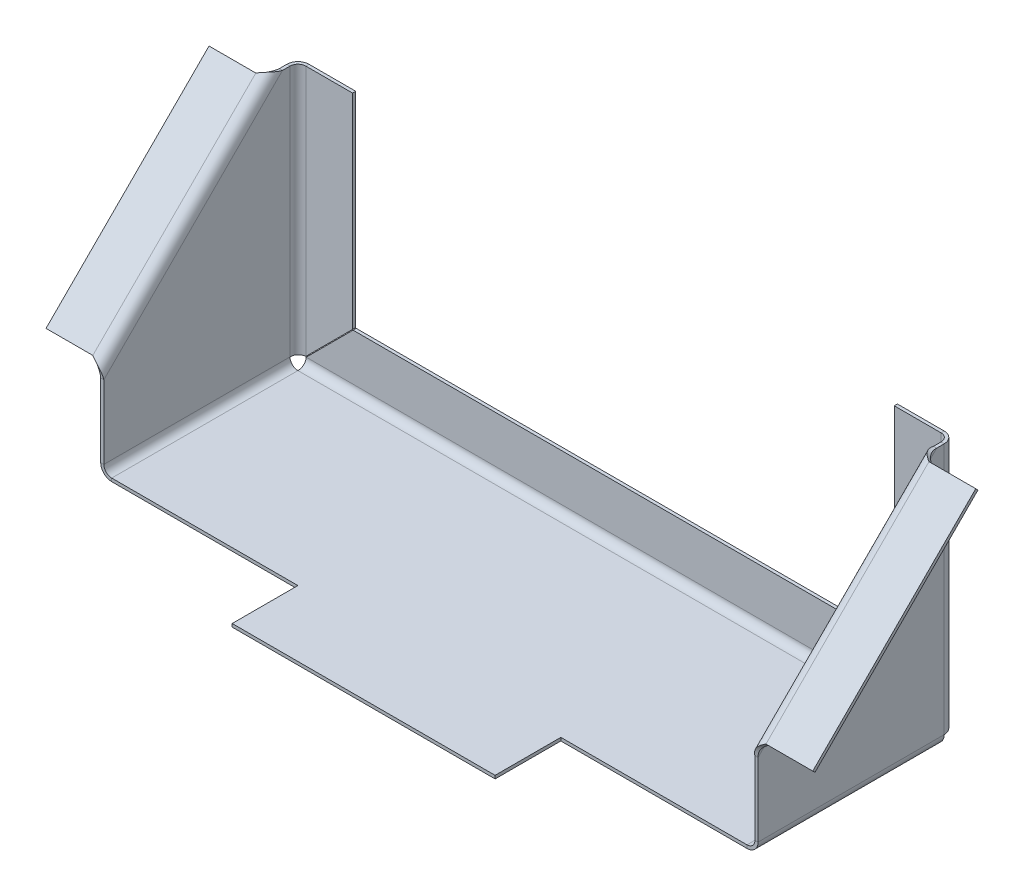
ISO-10303-21;
HEADER;
FILE_DESCRIPTION(('STEP AP214'),'2;1');
FILE_NAME('part.step','',(''),(''),'','','');
FILE_SCHEMA(('AUTOMOTIVE_DESIGN { 1 0 10303 214 1 1 1 1 }'));
ENDSEC;
DATA;
#1=APPLICATION_CONTEXT('core data for automotive mechanical design processes');
#2=APPLICATION_PROTOCOL_DEFINITION('international standard','automotive_design',2000,#1);
#3=PRODUCT_CONTEXT('',#1,'mechanical');
#4=PRODUCT('Part','Part','',(#3));
#5=PRODUCT_RELATED_PRODUCT_CATEGORY('part','',(#4));
#6=PRODUCT_DEFINITION_FORMATION('','',#4);
#7=PRODUCT_DEFINITION_CONTEXT('part definition',#1,'design');
#8=PRODUCT_DEFINITION('design','',#6,#7);
#9=PRODUCT_DEFINITION_SHAPE('','',#8);
#10=(LENGTH_UNIT() NAMED_UNIT(*) SI_UNIT(.MILLI.,.METRE.));
#11=(NAMED_UNIT(*) PLANE_ANGLE_UNIT() SI_UNIT($,.RADIAN.));
#12=(NAMED_UNIT(*) SI_UNIT($,.STERADIAN.) SOLID_ANGLE_UNIT());
#13=UNCERTAINTY_MEASURE_WITH_UNIT(LENGTH_MEASURE(1.E-05),#10,'distance_accuracy_value','');
#14=(GEOMETRIC_REPRESENTATION_CONTEXT(3) GLOBAL_UNCERTAINTY_ASSIGNED_CONTEXT((#13)) GLOBAL_UNIT_ASSIGNED_CONTEXT((#10,
#11,#12)) REPRESENTATION_CONTEXT('',''));
#15=CARTESIAN_POINT('',(0.,0.,0.));
#16=DIRECTION('',(0.,0.,1.));
#17=DIRECTION('',(1.,0.,0.));
#18=AXIS2_PLACEMENT_3D('',#15,#16,#17);
#19=CARTESIAN_POINT('',(123.8,4.2,75.));
#20=DIRECTION('',(0.,0.,1.));
#21=DIRECTION('',(1.,0.,0.));
#22=AXIS2_PLACEMENT_3D('',#19,#20,#21);
#23=PLANE('',#22);
#24=DIRECTION('',(0.,1.,0.));
#25=VECTOR('',#24,1.);
#26=CARTESIAN_POINT('',(-50.,0.,75.));
#27=LINE('',#26,#25);
#28=CARTESIAN_POINT('',(-50.,0.,75.));
#29=VERTEX_POINT('',#28);
#30=CARTESIAN_POINT('',(-50.,1.2,75.));
#31=VERTEX_POINT('',#30);
#32=EDGE_CURVE('E409',#29,#31,#27,.T.);
#33=ORIENTED_EDGE('',*,*,#32,.T.);
#34=DIRECTION('',(1.,0.,0.));
#35=VECTOR('',#34,1.);
#36=CARTESIAN_POINT('',(-125.,1.2,75.));
#37=LINE('',#36,#35);
#38=CARTESIAN_POINT('',(-120.8,1.2,75.));
#39=VERTEX_POINT('',#38);
#40=EDGE_CURVE('E886',#31,#39,#37,.F.);
#41=ORIENTED_EDGE('',*,*,#40,.T.);
#42=DIRECTION('',(0.,-1.,0.));
#43=VECTOR('',#42,1.);
#44=CARTESIAN_POINT('',(-120.8,1.2,75.));
#45=LINE('',#44,#43);
#46=CARTESIAN_POINT('',(-120.8,0.,75.));
#47=VERTEX_POINT('',#46);
#48=EDGE_CURVE('E937',#39,#47,#45,.T.);
#49=ORIENTED_EDGE('',*,*,#48,.T.);
#50=DIRECTION('',(-1.,0.,0.));
#51=VECTOR('',#50,1.);
#52=CARTESIAN_POINT('',(-125.,0.,75.));
#53=LINE('',#52,#51);
#54=EDGE_CURVE('E163',#29,#47,#53,.T.);
#55=ORIENTED_EDGE('',*,*,#54,.F.);
#56=EDGE_LOOP('',(#33,#41,#49,#55));
#57=FACE_BOUND('',#56,.T.);
#58=ADVANCED_FACE('F140',(#57),#23,.T.);
#59=CARTESIAN_POINT('',(-123.8,100.,75.));
#60=DIRECTION('',(-1.,0.,0.));
#61=DIRECTION('',(0.,-1.,0.));
#62=AXIS2_PLACEMENT_3D('',#59,#60,#61);
#63=PLANE('',#62);
#64=DIRECTION('',(0.,0.707106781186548,-0.707106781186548));
#65=VECTOR('',#64,1.);
#66=CARTESIAN_POINT('',(-123.799999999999,99.9999999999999,7.0603030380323));
#67=LINE('',#66,#65);
#68=CARTESIAN_POINT('',(-123.799999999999,99.9999999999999,7.0603030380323));
#69=VERTEX_POINT('',#68);
#70=CARTESIAN_POINT('',(-123.8,32.0603030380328,74.9999999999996));
#71=VERTEX_POINT('',#70);
#72=EDGE_CURVE('E458',#69,#71,#67,.F.);
#73=ORIENTED_EDGE('',*,*,#72,.T.);
#74=DIRECTION('',(0.,1.,0.));
#75=VECTOR('',#74,1.);
#76=CARTESIAN_POINT('',(-123.8,100.,75.));
#77=LINE('',#76,#75);
#78=CARTESIAN_POINT('',(-123.8,4.2,75.));
#79=VERTEX_POINT('',#78);
#80=EDGE_CURVE('E1042',#79,#71,#77,.T.);
#81=ORIENTED_EDGE('',*,*,#80,.F.);
#82=DIRECTION('',(0.,0.,-1.));
#83=VECTOR('',#82,1.);
#84=CARTESIAN_POINT('',(-123.8,4.2,75.));
#85=LINE('',#84,#83);
#86=CARTESIAN_POINT('',(-123.8,4.2,4.19999999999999));
#87=VERTEX_POINT('',#86);
#88=EDGE_CURVE('E903',#79,#87,#85,.T.);
#89=ORIENTED_EDGE('',*,*,#88,.T.);
#90=DIRECTION('',(0.,1.,0.));
#91=VECTOR('',#90,1.);
#92=CARTESIAN_POINT('',(-123.8,100.,4.19999999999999));
#93=LINE('',#92,#91);
#94=CARTESIAN_POINT('',(-123.8,100.,4.19999999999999));
#95=VERTEX_POINT('',#94);
#96=EDGE_CURVE('E776',#95,#87,#93,.F.);
#97=ORIENTED_EDGE('',*,*,#96,.F.);
#98=DIRECTION('',(0.,0.,-1.));
#99=VECTOR('',#98,1.);
#100=CARTESIAN_POINT('',(-123.8,100.,75.));
#101=LINE('',#100,#99);
#102=EDGE_CURVE('E930',#69,#95,#101,.T.);
#103=ORIENTED_EDGE('',*,*,#102,.F.);
#104=EDGE_LOOP('',(#73,#81,#89,#97,#103));
#105=FACE_BOUND('',#104,.T.);
#106=ADVANCED_FACE('F861',(#105),#63,.F.);
#107=CARTESIAN_POINT('',(-125.,100.,75.));
#108=DIRECTION('',(0.,1.,0.));
#109=DIRECTION('',(0.,0.,1.));
#110=AXIS2_PLACEMENT_3D('',#107,#108,#109);
#111=PLANE('',#110);
#112=DIRECTION('',(0.,0.,-1.));
#113=VECTOR('',#112,1.);
#114=CARTESIAN_POINT('',(-125.,100.,75.));
#115=LINE('',#114,#113);
#116=CARTESIAN_POINT('',(-124.999999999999,100.,7.06030303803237));
#117=VERTEX_POINT('',#116);
#118=CARTESIAN_POINT('',(-125.,100.,4.19999999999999));
#119=VERTEX_POINT('',#118);
#120=EDGE_CURVE('E928',#117,#119,#115,.T.);
#121=ORIENTED_EDGE('',*,*,#120,.F.);
#122=DIRECTION('',(1.,0.,0.));
#123=VECTOR('',#122,1.);
#124=CARTESIAN_POINT('',(-124.999999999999,100.,7.06030303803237));
#125=LINE('',#124,#123);
#126=EDGE_CURVE('E466',#117,#69,#125,.T.);
#127=ORIENTED_EDGE('',*,*,#126,.T.);
#128=ORIENTED_EDGE('',*,*,#102,.T.);
#129=DIRECTION('',(-1.,0.,0.));
#130=VECTOR('',#129,1.);
#131=CARTESIAN_POINT('',(-123.8,100.,4.19999999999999));
#132=LINE('',#131,#130);
#133=EDGE_CURVE('E1737',#95,#119,#132,.T.);
#134=ORIENTED_EDGE('',*,*,#133,.T.);
#135=EDGE_LOOP('',(#121,#127,#128,#134));
#136=FACE_BOUND('',#135,.T.);
#137=ADVANCED_FACE('F857',(#136),#111,.T.);
#138=CARTESIAN_POINT('',(-125.,100.,75.));
#139=DIRECTION('',(-1.,0.,0.));
#140=DIRECTION('',(0.,-1.,0.));
#141=AXIS2_PLACEMENT_3D('',#138,#139,#140);
#142=PLANE('',#141);
#143=DIRECTION('',(0.,1.,0.));
#144=VECTOR('',#143,1.);
#145=CARTESIAN_POINT('',(-125.,100.,75.));
#146=LINE('',#145,#144);
#147=CARTESIAN_POINT('',(-125.,4.2,75.));
#148=VERTEX_POINT('',#147);
#149=CARTESIAN_POINT('',(-125.,32.0603030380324,75.));
#150=VERTEX_POINT('',#149);
#151=EDGE_CURVE('E1039',#148,#150,#146,.T.);
#152=ORIENTED_EDGE('',*,*,#151,.T.);
#153=DIRECTION('',(0.,0.707106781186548,-0.707106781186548));
#154=VECTOR('',#153,1.);
#155=CARTESIAN_POINT('',(-124.999999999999,100.,7.06030303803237));
#156=LINE('',#155,#154);
#157=EDGE_CURVE('E454',#117,#150,#156,.F.);
#158=ORIENTED_EDGE('',*,*,#157,.F.);
#159=ORIENTED_EDGE('',*,*,#120,.T.);
#160=DIRECTION('',(0.,1.,0.));
#161=VECTOR('',#160,1.);
#162=CARTESIAN_POINT('',(-125.,100.,4.19999999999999));
#163=LINE('',#162,#161);
#164=CARTESIAN_POINT('',(-125.,4.2,4.19999999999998));
#165=VERTEX_POINT('',#164);
#166=EDGE_CURVE('E772',#119,#165,#163,.F.);
#167=ORIENTED_EDGE('',*,*,#166,.T.);
#168=DIRECTION('',(0.,0.,-1.));
#169=VECTOR('',#168,1.);
#170=CARTESIAN_POINT('',(-125.,4.2,75.));
#171=LINE('',#170,#169);
#172=EDGE_CURVE('E925',#148,#165,#171,.T.);
#173=ORIENTED_EDGE('',*,*,#172,.F.);
#174=EDGE_LOOP('',(#152,#158,#159,#167,#173));
#175=FACE_BOUND('',#174,.T.);
#176=ADVANCED_FACE('F854',(#175),#142,.T.);
#177=CARTESIAN_POINT('',(-120.8,1.2,75.));
#178=DIRECTION('',(0.,0.,1.));
#179=DIRECTION('',(1.,0.,0.));
#180=AXIS2_PLACEMENT_3D('',#177,#178,#179);
#181=PLANE('',#180);
#182=ORIENTED_EDGE('',*,*,#80,.T.);
#183=DIRECTION('',(1.,0.,0.));
#184=VECTOR('',#183,1.);
#185=CARTESIAN_POINT('',(-125.,32.0603030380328,74.9999999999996));
#186=LINE('',#185,#184);
#187=EDGE_CURVE('E462',#150,#71,#186,.T.);
#188=ORIENTED_EDGE('',*,*,#187,.F.);
#189=ORIENTED_EDGE('',*,*,#151,.F.);
#190=DIRECTION('',(1.,0.,0.));
#191=VECTOR('',#190,1.);
#192=CARTESIAN_POINT('',(-125.,4.2,75.));
#193=LINE('',#192,#191);
#194=EDGE_CURVE('E939',#148,#79,#193,.T.);
#195=ORIENTED_EDGE('',*,*,#194,.T.);
#196=EDGE_LOOP('',(#182,#188,#189,#195));
#197=FACE_BOUND('',#196,.T.);
#198=ADVANCED_FACE('F843',(#197),#181,.T.);
#199=CARTESIAN_POINT('',(125.,100.,75.));
#200=DIRECTION('',(1.,0.,0.));
#201=DIRECTION('',(0.,1.,0.));
#202=AXIS2_PLACEMENT_3D('',#199,#200,#201);
#203=PLANE('',#202);
#204=DIRECTION('',(0.,0.,-1.));
#205=VECTOR('',#204,1.);
#206=CARTESIAN_POINT('',(125.,100.,75.));
#207=LINE('',#206,#205);
#208=CARTESIAN_POINT('',(125.,100.,7.06030303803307));
#209=VERTEX_POINT('',#208);
#210=CARTESIAN_POINT('',(125.,100.,4.19999999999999));
#211=VERTEX_POINT('',#210);
#212=EDGE_CURVE('E915',#209,#211,#207,.T.);
#213=ORIENTED_EDGE('',*,*,#212,.F.);
#214=DIRECTION('',(0.,-0.707106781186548,0.707106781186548));
#215=VECTOR('',#214,1.);
#216=CARTESIAN_POINT('',(125.000000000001,32.0603030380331,75.));
#217=LINE('',#216,#215);
#218=CARTESIAN_POINT('',(125.000000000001,32.0603030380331,75.));
#219=VERTEX_POINT('',#218);
#220=EDGE_CURVE('E605',#219,#209,#217,.F.);
#221=ORIENTED_EDGE('',*,*,#220,.F.);
#222=DIRECTION('',(0.,-1.,0.));
#223=VECTOR('',#222,1.);
#224=CARTESIAN_POINT('',(125.,100.,75.));
#225=LINE('',#224,#223);
#226=CARTESIAN_POINT('',(125.,4.2,75.));
#227=VERTEX_POINT('',#226);
#228=EDGE_CURVE('E1049',#219,#227,#225,.T.);
#229=ORIENTED_EDGE('',*,*,#228,.T.);
#230=DIRECTION('',(0.,0.,-1.));
#231=VECTOR('',#230,1.);
#232=CARTESIAN_POINT('',(125.,4.2,75.));
#233=LINE('',#232,#231);
#234=CARTESIAN_POINT('',(125.,4.2,4.19999999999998));
#235=VERTEX_POINT('',#234);
#236=EDGE_CURVE('E917',#227,#235,#233,.T.);
#237=ORIENTED_EDGE('',*,*,#236,.T.);
#238=DIRECTION('',(0.,-1.,0.));
#239=VECTOR('',#238,1.);
#240=CARTESIAN_POINT('',(125.,4.2,4.19999999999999));
#241=LINE('',#240,#239);
#242=EDGE_CURVE('E644',#235,#211,#241,.F.);
#243=ORIENTED_EDGE('',*,*,#242,.T.);
#244=EDGE_LOOP('',(#213,#221,#229,#237,#243));
#245=FACE_BOUND('',#244,.T.);
#246=ADVANCED_FACE('F836',(#245),#203,.T.);
#247=CARTESIAN_POINT('',(123.8,100.,75.));
#248=DIRECTION('',(1.,0.,0.));
#249=DIRECTION('',(0.,1.,0.));
#250=AXIS2_PLACEMENT_3D('',#247,#248,#249);
#251=PLANE('',#250);
#252=DIRECTION('',(0.,-0.707106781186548,0.707106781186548));
#253=VECTOR('',#252,1.);
#254=CARTESIAN_POINT('',(123.800000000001,32.0603030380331,75.0000000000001));
#255=LINE('',#254,#253);
#256=CARTESIAN_POINT('',(123.800000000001,32.0603030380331,75.0000000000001));
#257=VERTEX_POINT('',#256);
#258=CARTESIAN_POINT('',(123.8,100.,7.06030303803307));
#259=VERTEX_POINT('',#258);
#260=EDGE_CURVE('E573',#257,#259,#255,.F.);
#261=ORIENTED_EDGE('',*,*,#260,.T.);
#262=DIRECTION('',(0.,0.,-1.));
#263=VECTOR('',#262,1.);
#264=CARTESIAN_POINT('',(123.8,100.,75.));
#265=LINE('',#264,#263);
#266=CARTESIAN_POINT('',(123.8,100.,4.19999999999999));
#267=VERTEX_POINT('',#266);
#268=EDGE_CURVE('E913',#259,#267,#265,.T.);
#269=ORIENTED_EDGE('',*,*,#268,.T.);
#270=DIRECTION('',(0.,-1.,0.));
#271=VECTOR('',#270,1.);
#272=CARTESIAN_POINT('',(123.8,4.2,4.19999999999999));
#273=LINE('',#272,#271);
#274=CARTESIAN_POINT('',(123.8,4.2,4.19999999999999));
#275=VERTEX_POINT('',#274);
#276=EDGE_CURVE('E649',#275,#267,#273,.F.);
#277=ORIENTED_EDGE('',*,*,#276,.F.);
#278=DIRECTION('',(0.,0.,-1.));
#279=VECTOR('',#278,1.);
#280=CARTESIAN_POINT('',(123.8,4.2,75.));
#281=LINE('',#280,#279);
#282=CARTESIAN_POINT('',(123.8,4.2,75.));
#283=VERTEX_POINT('',#282);
#284=EDGE_CURVE('E910',#283,#275,#281,.T.);
#285=ORIENTED_EDGE('',*,*,#284,.F.);
#286=DIRECTION('',(0.,-1.,0.));
#287=VECTOR('',#286,1.);
#288=CARTESIAN_POINT('',(123.8,100.,75.));
#289=LINE('',#288,#287);
#290=EDGE_CURVE('E897',#257,#283,#289,.T.);
#291=ORIENTED_EDGE('',*,*,#290,.F.);
#292=EDGE_LOOP('',(#261,#269,#277,#285,#291));
#293=FACE_BOUND('',#292,.T.);
#294=ADVANCED_FACE('F833',(#293),#251,.F.);
#295=CARTESIAN_POINT('',(123.8,100.,75.));
#296=DIRECTION('',(0.,1.,0.));
#297=DIRECTION('',(0.,0.,1.));
#298=AXIS2_PLACEMENT_3D('',#295,#296,#297);
#299=PLANE('',#298);
#300=ORIENTED_EDGE('',*,*,#268,.F.);
#301=DIRECTION('',(-1.,0.,0.));
#302=VECTOR('',#301,1.);
#303=CARTESIAN_POINT('',(125.,100.,7.06030303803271));
#304=LINE('',#303,#302);
#305=EDGE_CURVE('E610',#209,#259,#304,.T.);
#306=ORIENTED_EDGE('',*,*,#305,.F.);
#307=ORIENTED_EDGE('',*,*,#212,.T.);
#308=DIRECTION('',(1.,0.,0.));
#309=VECTOR('',#308,1.);
#310=CARTESIAN_POINT('',(123.8,100.,4.19999999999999));
#311=LINE('',#310,#309);
#312=EDGE_CURVE('E961',#267,#211,#311,.T.);
#313=ORIENTED_EDGE('',*,*,#312,.F.);
#314=EDGE_LOOP('',(#300,#306,#307,#313));
#315=FACE_BOUND('',#314,.T.);
#316=ADVANCED_FACE('F818',(#315),#299,.T.);
#317=CARTESIAN_POINT('',(-120.8,4.2,75.));
#318=DIRECTION('',(0.,0.,-1.));
#319=DIRECTION('',(-1.,0.,0.));
#320=AXIS2_PLACEMENT_3D('',#317,#318,#319);
#321=PLANE('',#320);
#322=DIRECTION('',(-1.,0.,0.));
#323=VECTOR('',#322,1.);
#324=CARTESIAN_POINT('',(125.000000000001,32.0603030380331,75.));
#325=LINE('',#324,#323);
#326=EDGE_CURVE('E1053',#219,#257,#325,.T.);
#327=ORIENTED_EDGE('',*,*,#326,.T.);
#328=ORIENTED_EDGE('',*,*,#290,.T.);
#329=DIRECTION('',(1.,0.,0.));
#330=VECTOR('',#329,1.);
#331=CARTESIAN_POINT('',(123.8,4.2,75.));
#332=LINE('',#331,#330);
#333=EDGE_CURVE('E932',#283,#227,#332,.T.);
#334=ORIENTED_EDGE('',*,*,#333,.T.);
#335=ORIENTED_EDGE('',*,*,#228,.F.);
#336=EDGE_LOOP('',(#327,#328,#334,#335));
#337=FACE_BOUND('',#336,.T.);
#338=ADVANCED_FACE('F814',(#337),#321,.F.);
#339=CARTESIAN_POINT('',(120.8,4.2,75.));
#340=DIRECTION('',(0.,0.,-1.));
#341=DIRECTION('',(-1.,0.,0.));
#342=AXIS2_PLACEMENT_3D('',#339,#340,#341);
#343=CYLINDRICAL_SURFACE('',#342,4.2);
#344=DIRECTION('',(0.,0.,-1.));
#345=VECTOR('',#344,1.);
#346=CARTESIAN_POINT('',(120.8,0.,75.));
#347=LINE('',#346,#345);
#348=CARTESIAN_POINT('',(120.8,0.,75.));
#349=VERTEX_POINT('',#348);
#350=CARTESIAN_POINT('',(120.8,0.,4.19999999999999));
#351=VERTEX_POINT('',#350);
#352=EDGE_CURVE('E920',#349,#351,#347,.T.);
#353=ORIENTED_EDGE('',*,*,#352,.T.);
#354=CARTESIAN_POINT('',(120.8,4.2,4.19999999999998));
#355=DIRECTION('',(0.,0.,-1.));
#356=DIRECTION('',(-1.,0.,0.));
#357=AXIS2_PLACEMENT_3D('',#354,#355,#356);
#358=CIRCLE('',#357,4.2);
#359=EDGE_CURVE('E13',#351,#235,#358,.F.);
#360=ORIENTED_EDGE('',*,*,#359,.T.);
#361=ORIENTED_EDGE('',*,*,#236,.F.);
#362=CARTESIAN_POINT('',(120.8,4.2,75.));
#363=DIRECTION('',(0.,0.,-1.));
#364=DIRECTION('',(-1.,0.,0.));
#365=AXIS2_PLACEMENT_3D('',#362,#363,#364);
#366=CIRCLE('',#365,4.2);
#367=EDGE_CURVE('E1046',#227,#349,#366,.T.);
#368=ORIENTED_EDGE('',*,*,#367,.T.);
#369=EDGE_LOOP('',(#353,#360,#361,#368));
#370=FACE_BOUND('',#369,.T.);
#371=ADVANCED_FACE('F817',(#370),#343,.T.);
#372=CARTESIAN_POINT('',(120.8,4.2,4.19999999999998));
#373=DIRECTION('',(0.,0.,-1.));
#374=DIRECTION('',(-1.,0.,0.));
#375=AXIS2_PLACEMENT_3D('',#372,#373,#374);
#376=PLANE('',#375);
#377=CARTESIAN_POINT('',(120.8,4.2,4.19999999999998));
#378=DIRECTION('',(0.,0.,-1.));
#379=DIRECTION('',(-1.,0.,0.));
#380=AXIS2_PLACEMENT_3D('',#377,#378,#379);
#381=CIRCLE('',#380,3.);
#382=CARTESIAN_POINT('',(120.8,1.19999999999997,4.19999999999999));
#383=VERTEX_POINT('',#382);
#384=EDGE_CURVE('E148',#383,#275,#381,.F.);
#385=ORIENTED_EDGE('',*,*,#384,.T.);
#386=DIRECTION('',(1.,0.,0.));
#387=VECTOR('',#386,1.);
#388=CARTESIAN_POINT('',(123.8,4.2,4.19999999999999));
#389=LINE('',#388,#387);
#390=EDGE_CURVE('E643',#275,#235,#389,.T.);
#391=ORIENTED_EDGE('',*,*,#390,.T.);
#392=ORIENTED_EDGE('',*,*,#359,.F.);
#393=DIRECTION('',(0.,-1.,0.));
#394=VECTOR('',#393,1.);
#395=CARTESIAN_POINT('',(120.8,1.19999999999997,4.19999999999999));
#396=LINE('',#395,#394);
#397=EDGE_CURVE('E729',#383,#351,#396,.T.);
#398=ORIENTED_EDGE('',*,*,#397,.F.);
#399=EDGE_LOOP('',(#385,#391,#392,#398));
#400=FACE_BOUND('',#399,.T.);
#401=ADVANCED_FACE('F142',(#400),#376,.T.);
#402=CARTESIAN_POINT('',(-125.,0.,75.));
#403=DIRECTION('',(0.,-1.,0.));
#404=DIRECTION('',(0.,0.,-1.));
#405=AXIS2_PLACEMENT_3D('',#402,#403,#404);
#406=PLANE('',#405);
#407=DIRECTION('',(0.,0.,-1.));
#408=VECTOR('',#407,1.);
#409=CARTESIAN_POINT('',(-120.8,0.,75.));
#410=LINE('',#409,#408);
#411=CARTESIAN_POINT('',(-120.8,0.,4.19999999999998));
#412=VERTEX_POINT('',#411);
#413=EDGE_CURVE('E923',#47,#412,#410,.T.);
#414=ORIENTED_EDGE('',*,*,#413,.T.);
#415=DIRECTION('',(-1.,0.,0.));
#416=VECTOR('',#415,1.);
#417=CARTESIAN_POINT('',(-120.8,0.,4.19999999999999));
#418=LINE('',#417,#416);
#419=EDGE_CURVE('E725',#412,#351,#418,.F.);
#420=ORIENTED_EDGE('',*,*,#419,.T.);
#421=ORIENTED_EDGE('',*,*,#352,.F.);
#422=CARTESIAN_POINT('',(50.,0.,75.));
#423=VERTEX_POINT('',#422);
#424=EDGE_CURVE('E1035',#349,#423,#53,.T.);
#425=ORIENTED_EDGE('',*,*,#424,.T.);
#426=DIRECTION('',(0.,0.,-1.));
#427=VECTOR('',#426,1.);
#428=CARTESIAN_POINT('',(50.,0.,75.));
#429=LINE('',#428,#427);
#430=CARTESIAN_POINT('',(50.,0.,100.));
#431=VERTEX_POINT('',#430);
#432=EDGE_CURVE('E397',#431,#423,#429,.T.);
#433=ORIENTED_EDGE('',*,*,#432,.F.);
#434=DIRECTION('',(1.,0.,0.));
#435=VECTOR('',#434,1.);
#436=CARTESIAN_POINT('',(-50.,0.,100.));
#437=LINE('',#436,#435);
#438=CARTESIAN_POINT('',(-50.,0.,100.));
#439=VERTEX_POINT('',#438);
#440=EDGE_CURVE('E389',#439,#431,#437,.T.);
#441=ORIENTED_EDGE('',*,*,#440,.F.);
#442=DIRECTION('',(0.,0.,1.));
#443=VECTOR('',#442,1.);
#444=CARTESIAN_POINT('',(-50.,0.,75.));
#445=LINE('',#444,#443);
#446=EDGE_CURVE('E404',#29,#439,#445,.T.);
#447=ORIENTED_EDGE('',*,*,#446,.F.);
#448=ORIENTED_EDGE('',*,*,#54,.T.);
#449=EDGE_LOOP('',(#414,#420,#421,#425,#433,#441,#447,#448));
#450=FACE_BOUND('',#449,.T.);
#451=ADVANCED_FACE('F403',(#450),#406,.T.);
#452=CARTESIAN_POINT('',(-125.,1.2,75.));
#453=DIRECTION('',(0.,-1.,0.));
#454=DIRECTION('',(0.,0.,-1.));
#455=AXIS2_PLACEMENT_3D('',#452,#453,#454);
#456=PLANE('',#455);
#457=DIRECTION('',(-1.,0.,0.));
#458=VECTOR('',#457,1.);
#459=CARTESIAN_POINT('',(-120.8,1.19999999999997,4.19999999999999));
#460=LINE('',#459,#458);
#461=CARTESIAN_POINT('',(-120.8,1.19999999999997,4.19999999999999));
#462=VERTEX_POINT('',#461);
#463=EDGE_CURVE('E996',#462,#383,#460,.F.);
#464=ORIENTED_EDGE('',*,*,#463,.F.);
#465=DIRECTION('',(0.,0.,-1.));
#466=VECTOR('',#465,1.);
#467=CARTESIAN_POINT('',(-120.8,1.2,75.));
#468=LINE('',#467,#466);
#469=EDGE_CURVE('E891',#39,#462,#468,.T.);
#470=ORIENTED_EDGE('',*,*,#469,.F.);
#471=ORIENTED_EDGE('',*,*,#40,.F.);
#472=DIRECTION('',(0.,0.,1.));
#473=VECTOR('',#472,1.);
#474=CARTESIAN_POINT('',(-50.,1.2,75.));
#475=LINE('',#474,#473);
#476=CARTESIAN_POINT('',(-50.,1.2,100.));
#477=VERTEX_POINT('',#476);
#478=EDGE_CURVE('E416',#31,#477,#475,.T.);
#479=ORIENTED_EDGE('',*,*,#478,.T.);
#480=DIRECTION('',(1.,0.,0.));
#481=VECTOR('',#480,1.);
#482=CARTESIAN_POINT('',(-50.,1.2,100.));
#483=LINE('',#482,#481);
#484=CARTESIAN_POINT('',(50.,1.2,100.));
#485=VERTEX_POINT('',#484);
#486=EDGE_CURVE('E391',#477,#485,#483,.T.);
#487=ORIENTED_EDGE('',*,*,#486,.T.);
#488=DIRECTION('',(0.,0.,-1.));
#489=VECTOR('',#488,1.);
#490=CARTESIAN_POINT('',(50.,1.2,75.));
#491=LINE('',#490,#489);
#492=CARTESIAN_POINT('',(50.,1.2,75.));
#493=VERTEX_POINT('',#492);
#494=EDGE_CURVE('E410',#485,#493,#491,.T.);
#495=ORIENTED_EDGE('',*,*,#494,.T.);
#496=CARTESIAN_POINT('',(120.8,1.2,75.));
#497=VERTEX_POINT('',#496);
#498=EDGE_CURVE('E155',#497,#493,#37,.F.);
#499=ORIENTED_EDGE('',*,*,#498,.F.);
#500=DIRECTION('',(0.,0.,-1.));
#501=VECTOR('',#500,1.);
#502=CARTESIAN_POINT('',(120.8,1.2,75.));
#503=LINE('',#502,#501);
#504=EDGE_CURVE('E907',#497,#383,#503,.T.);
#505=ORIENTED_EDGE('',*,*,#504,.T.);
#506=EDGE_LOOP('',(#464,#470,#471,#479,#487,#495,#499,#505));
#507=FACE_BOUND('',#506,.T.);
#508=ADVANCED_FACE('F824',(#507),#456,.F.);
#509=CARTESIAN_POINT('',(-120.8,4.2,75.));
#510=DIRECTION('',(0.,0.,-1.));
#511=DIRECTION('',(-1.,0.,0.));
#512=AXIS2_PLACEMENT_3D('',#509,#510,#511);
#513=CYLINDRICAL_SURFACE('',#512,4.2);
#514=ORIENTED_EDGE('',*,*,#172,.T.);
#515=CARTESIAN_POINT('',(-120.8,4.2,4.19999999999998));
#516=DIRECTION('',(0.,0.,-1.));
#517=DIRECTION('',(-1.,0.,0.));
#518=AXIS2_PLACEMENT_3D('',#515,#516,#517);
#519=CIRCLE('',#518,4.2);
#520=EDGE_CURVE('E943',#165,#412,#519,.F.);
#521=ORIENTED_EDGE('',*,*,#520,.T.);
#522=ORIENTED_EDGE('',*,*,#413,.F.);
#523=CARTESIAN_POINT('',(-120.8,4.2,75.));
#524=DIRECTION('',(0.,0.,-1.));
#525=DIRECTION('',(-1.,0.,0.));
#526=AXIS2_PLACEMENT_3D('',#523,#524,#525);
#527=CIRCLE('',#526,4.2);
#528=EDGE_CURVE('E1036',#47,#148,#527,.T.);
#529=ORIENTED_EDGE('',*,*,#528,.T.);
#530=EDGE_LOOP('',(#514,#521,#522,#529));
#531=FACE_BOUND('',#530,.T.);
#532=ADVANCED_FACE('F827',(#531),#513,.T.);
#533=CARTESIAN_POINT('',(-120.8,4.2,4.19999999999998));
#534=DIRECTION('',(0.,0.,-1.));
#535=DIRECTION('',(-1.,0.,0.));
#536=AXIS2_PLACEMENT_3D('',#533,#534,#535);
#537=PLANE('',#536);
#538=CARTESIAN_POINT('',(-120.8,4.2,4.19999999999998));
#539=DIRECTION('',(0.,0.,-1.));
#540=DIRECTION('',(-1.,0.,0.));
#541=AXIS2_PLACEMENT_3D('',#538,#539,#540);
#542=CIRCLE('',#541,3.);
#543=EDGE_CURVE('E941',#87,#462,#542,.F.);
#544=ORIENTED_EDGE('',*,*,#543,.T.);
#545=DIRECTION('',(0.,-1.,0.));
#546=VECTOR('',#545,1.);
#547=CARTESIAN_POINT('',(-120.8,1.19999999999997,4.19999999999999));
#548=LINE('',#547,#546);
#549=EDGE_CURVE('E737',#462,#412,#548,.T.);
#550=ORIENTED_EDGE('',*,*,#549,.T.);
#551=ORIENTED_EDGE('',*,*,#520,.F.);
#552=DIRECTION('',(-1.,0.,0.));
#553=VECTOR('',#552,1.);
#554=CARTESIAN_POINT('',(-123.8,4.2,4.19999999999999));
#555=LINE('',#554,#553);
#556=EDGE_CURVE('E1745',#87,#165,#555,.T.);
#557=ORIENTED_EDGE('',*,*,#556,.F.);
#558=EDGE_LOOP('',(#544,#550,#551,#557));
#559=FACE_BOUND('',#558,.T.);
#560=ADVANCED_FACE('F852',(#559),#537,.T.);
#561=CARTESIAN_POINT('',(-125.,4.2,75.));
#562=DIRECTION('',(0.,0.,1.));
#563=DIRECTION('',(1.,0.,0.));
#564=AXIS2_PLACEMENT_3D('',#561,#562,#563);
#565=PLANE('',#564);
#566=ORIENTED_EDGE('',*,*,#194,.F.);
#567=ORIENTED_EDGE('',*,*,#528,.F.);
#568=ORIENTED_EDGE('',*,*,#48,.F.);
#569=CARTESIAN_POINT('',(-120.8,4.2,75.));
#570=DIRECTION('',(0.,0.,1.));
#571=DIRECTION('',(1.,0.,0.));
#572=AXIS2_PLACEMENT_3D('',#569,#570,#571);
#573=CIRCLE('',#572,3.);
#574=EDGE_CURVE('E895',#39,#79,#573,.F.);
#575=ORIENTED_EDGE('',*,*,#574,.T.);
#576=EDGE_LOOP('',(#566,#567,#568,#575));
#577=FACE_BOUND('',#576,.T.);
#578=ADVANCED_FACE('F871',(#577),#565,.T.);
#579=CARTESIAN_POINT('',(120.8,0.,75.));
#580=DIRECTION('',(0.,0.,1.));
#581=DIRECTION('',(1.,0.,0.));
#582=AXIS2_PLACEMENT_3D('',#579,#580,#581);
#583=PLANE('',#582);
#584=DIRECTION('',(0.,1.,0.));
#585=VECTOR('',#584,1.);
#586=CARTESIAN_POINT('',(120.8,0.,75.));
#587=LINE('',#586,#585);
#588=EDGE_CURVE('E935',#349,#497,#587,.T.);
#589=ORIENTED_EDGE('',*,*,#588,.F.);
#590=ORIENTED_EDGE('',*,*,#367,.F.);
#591=ORIENTED_EDGE('',*,*,#333,.F.);
#592=CARTESIAN_POINT('',(120.8,4.2,75.));
#593=DIRECTION('',(0.,0.,1.));
#594=DIRECTION('',(1.,0.,0.));
#595=AXIS2_PLACEMENT_3D('',#592,#593,#594);
#596=CIRCLE('',#595,3.);
#597=EDGE_CURVE('E893',#283,#497,#596,.F.);
#598=ORIENTED_EDGE('',*,*,#597,.T.);
#599=EDGE_LOOP('',(#589,#590,#591,#598));
#600=FACE_BOUND('',#599,.T.);
#601=ADVANCED_FACE('F868',(#600),#583,.T.);
#602=DIRECTION('',(0.,1.,0.));
#603=VECTOR('',#602,1.);
#604=CARTESIAN_POINT('',(50.,0.,75.));
#605=LINE('',#604,#603);
#606=EDGE_CURVE('E421',#423,#493,#605,.T.);
#607=ORIENTED_EDGE('',*,*,#606,.F.);
#608=ORIENTED_EDGE('',*,*,#424,.F.);
#609=ORIENTED_EDGE('',*,*,#588,.T.);
#610=ORIENTED_EDGE('',*,*,#498,.T.);
#611=EDGE_LOOP('',(#607,#608,#609,#610));
#612=FACE_BOUND('',#611,.T.);
#613=ADVANCED_FACE('F831',(#612),#23,.T.);
#614=CARTESIAN_POINT('',(120.8,4.2,75.));
#615=DIRECTION('',(0.,0.,-1.));
#616=DIRECTION('',(-1.,0.,0.));
#617=AXIS2_PLACEMENT_3D('',#614,#615,#616);
#618=CYLINDRICAL_SURFACE('',#617,3.);
#619=ORIENTED_EDGE('',*,*,#384,.F.);
#620=ORIENTED_EDGE('',*,*,#504,.F.);
#621=ORIENTED_EDGE('',*,*,#597,.F.);
#622=ORIENTED_EDGE('',*,*,#284,.T.);
#623=EDGE_LOOP('',(#619,#620,#621,#622));
#624=FACE_BOUND('',#623,.T.);
#625=ADVANCED_FACE('F822',(#624),#618,.F.);
#626=CARTESIAN_POINT('',(-120.8,4.2,75.));
#627=DIRECTION('',(0.,0.,-1.));
#628=DIRECTION('',(-1.,0.,0.));
#629=AXIS2_PLACEMENT_3D('',#626,#627,#628);
#630=CYLINDRICAL_SURFACE('',#629,3.);
#631=ORIENTED_EDGE('',*,*,#543,.F.);
#632=ORIENTED_EDGE('',*,*,#88,.F.);
#633=ORIENTED_EDGE('',*,*,#574,.F.);
#634=ORIENTED_EDGE('',*,*,#469,.T.);
#635=EDGE_LOOP('',(#631,#632,#633,#634));
#636=FACE_BOUND('',#635,.T.);
#637=ADVANCED_FACE('F804',(#636),#630,.F.);
#638=CARTESIAN_POINT('',(-125.012,4.2,4.19999999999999));
#639=CARTESIAN_POINT('',(-125.012,4.21473404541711,3.64855115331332));
#640=CARTESIAN_POINT('',(-124.902372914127,4.22946278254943,3.0975179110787));
#641=CARTESIAN_POINT('',(-124.480388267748,4.25892556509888,2.07875685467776));
#642=CARTESIAN_POINT('',(-124.168196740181,4.27365695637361,1.61152921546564));
#643=CARTESIAN_POINT('',(-123.388470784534,4.30311973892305,0.831803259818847));
#644=CARTESIAN_POINT('',(-122.921243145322,4.31785113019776,0.519611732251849));
#645=CARTESIAN_POINT('',(-121.902482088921,4.3473139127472,0.09762708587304));
#646=CARTESIAN_POINT('',(-121.351448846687,4.36204264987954,-0.0120000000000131));
#647=CARTESIAN_POINT('',(-120.8,4.37677669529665,-0.0120000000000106));
#648=CARTESIAN_POINT('',(-125.,4.2,4.19999999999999));
#649=CARTESIAN_POINT('',(-125.,4.21473404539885,3.6501222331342));
#650=CARTESIAN_POINT('',(-124.890685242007,4.22946278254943,3.10065888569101));
#651=CARTESIAN_POINT('',(-124.469902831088,4.25892556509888,2.08480028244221));
#652=CARTESIAN_POINT('',(-124.158600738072,4.27365695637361,1.61890377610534));
#653=CARTESIAN_POINT('',(-123.381096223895,4.30311973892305,0.841399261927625));
#654=CARTESIAN_POINT('',(-122.915199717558,4.31785113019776,0.5300971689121));
#655=CARTESIAN_POINT('',(-121.899341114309,4.3473139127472,0.10931475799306));
#656=CARTESIAN_POINT('',(-121.349877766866,4.36204264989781,0.));
#657=CARTESIAN_POINT('',(-120.8,4.37677669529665,0.));
#658=CARTESIAN_POINT('',(-123.8,4.2,4.19999999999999));
#659=CARTESIAN_POINT('',(-123.8,4.21473404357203,3.80723021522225));
#660=CARTESIAN_POINT('',(-123.721918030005,4.22946278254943,3.41475634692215));
#661=CARTESIAN_POINT('',(-123.421359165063,4.25892556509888,2.68914305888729));
#662=CARTESIAN_POINT('',(-123.199000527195,4.27365695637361,2.35635984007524));
#663=CARTESIAN_POINT('',(-122.643640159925,4.30311973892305,1.80099947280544));
#664=CARTESIAN_POINT('',(-122.310856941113,4.31785113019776,1.57864083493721));
#665=CARTESIAN_POINT('',(-121.585243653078,4.3473139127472,1.27808196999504));
#666=CARTESIAN_POINT('',(-121.192769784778,4.36204265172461,1.19999999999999));
#667=CARTESIAN_POINT('',(-120.8,4.37677669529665,1.19999999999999));
#668=CARTESIAN_POINT('',(-123.78788,4.2,4.19999999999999));
#669=CARTESIAN_POINT('',(-123.78788,4.21473404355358,3.80881700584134));
#670=CARTESIAN_POINT('',(-123.710113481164,4.22946278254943,3.41792873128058));
#671=CARTESIAN_POINT('',(-123.410768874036,4.25892556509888,2.69524692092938));
#672=CARTESIAN_POINT('',(-123.189308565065,4.27365695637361,2.36380814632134));
#673=CARTESIAN_POINT('',(-122.636191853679,4.30311973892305,1.81069143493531));
#674=CARTESIAN_POINT('',(-122.304753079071,4.31785113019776,1.58923112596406));
#675=CARTESIAN_POINT('',(-121.582071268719,4.3473139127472,1.28988651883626));
#676=CARTESIAN_POINT('',(-121.191182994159,4.36204265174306,1.21211999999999));
#677=CARTESIAN_POINT('',(-120.8,4.37677669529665,1.21211999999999));
#678=B_SPLINE_SURFACE_WITH_KNOTS('',1,3,((#638,#639,#640,#641,#642,#643,#644,#645,#646,#647),
(#648,#649,#650,#651,#652,#653,#654,#655,#656,#657),(#658,#659,#660,#661,#662,#663,#664,#665,
#666,#667),(#668,#669,#670,#671,#672,#673,#674,#675,#676,#677)),.UNSPECIFIED.,.F.,.F.,.F.,(2,1,
1,2),(4,2,2,2,4),(-0.01,0.,1.,1.0101),(0.,0.25,0.5,0.75,1.),.UNSPECIFIED.);
#679=DIRECTION('',(0.,0.,1.));
#680=VECTOR('',#679,1.);
#681=CARTESIAN_POINT('',(-120.8,4.37677669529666,1.19999999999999));
#682=LINE('',#681,#680);
#683=CARTESIAN_POINT('',(-120.8,4.37677669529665,0.));
#684=VERTEX_POINT('',#683);
#685=CARTESIAN_POINT('',(-120.8,4.37677669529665,1.19999999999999));
#686=VERTEX_POINT('',#685);
#687=EDGE_CURVE('E747',#684,#686,#682,.T.);
#688=CARTESIAN_POINT('',(-123.8,4.2,4.19999999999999));
#689=CARTESIAN_POINT('',(-123.800001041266,4.20184142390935,4.15091256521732));
#690=CARTESIAN_POINT('',(-123.798795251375,4.20368284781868,4.10182521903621));
#691=CARTESIAN_POINT('',(-123.793977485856,4.20736569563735,4.00376873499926));
#692=CARTESIAN_POINT('',(-123.790365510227,4.20920711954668,3.95479959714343));
#693=CARTESIAN_POINT('',(-123.780742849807,4.21288996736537,3.85709756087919));
#694=CARTESIAN_POINT('',(-123.774732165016,4.21473139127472,3.80836466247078));
#695=CARTESIAN_POINT('',(-123.760326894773,4.2184142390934,3.71125249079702));
#696=CARTESIAN_POINT('',(-123.751932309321,4.22025566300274,3.66287321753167));
#697=CARTESIAN_POINT('',(-123.732779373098,4.22393851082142,3.56658485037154));
#698=CARTESIAN_POINT('',(-123.722021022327,4.22577993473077,3.51867575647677));
#699=CARTESIAN_POINT('',(-123.69816649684,4.22946278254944,3.42344316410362));
#700=CARTESIAN_POINT('',(-123.685070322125,4.23130420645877,3.37611966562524));
#701=CARTESIAN_POINT('',(-123.656571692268,4.23498705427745,3.28217227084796));
#702=CARTESIAN_POINT('',(-123.641169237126,4.23682847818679,3.23554837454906));
#703=CARTESIAN_POINT('',(-123.608095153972,4.24051132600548,3.14311250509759));
#704=CARTESIAN_POINT('',(-123.590423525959,4.24235274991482,3.09730053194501));
#705=CARTESIAN_POINT('',(-123.552853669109,4.2460355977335,3.00659887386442));
#706=CARTESIAN_POINT('',(-123.532955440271,4.24787702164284,2.96170918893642));
#707=CARTESIAN_POINT('',(-123.490980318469,4.25155986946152,2.87296025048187));
#708=CARTESIAN_POINT('',(-123.468903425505,4.25340129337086,2.82910099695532));
#709=CARTESIAN_POINT('',(-123.422624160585,4.25708414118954,2.74251858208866));
#710=CARTESIAN_POINT('',(-123.39842178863,4.25892556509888,2.69979542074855));
#711=CARTESIAN_POINT('',(-123.347949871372,4.26260841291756,2.61558811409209));
#712=CARTESIAN_POINT('',(-123.321680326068,4.2644498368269,2.57410396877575));
#713=CARTESIAN_POINT('',(-123.267137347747,4.26813268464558,2.49247463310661));
#714=CARTESIAN_POINT('',(-123.238863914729,4.26997410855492,2.4523294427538));
#715=CARTESIAN_POINT('',(-123.180381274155,4.27365695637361,2.37347473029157));
#716=CARTESIAN_POINT('',(-123.150172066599,4.27549838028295,2.33476520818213));
#717=CARTESIAN_POINT('',(-123.087890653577,4.27918122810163,2.25887508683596));
#718=CARTESIAN_POINT('',(-123.055818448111,4.28102265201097,2.22169448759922));
#719=CARTESIAN_POINT('',(-122.989888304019,4.28470549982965,2.14895178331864));
#720=CARTESIAN_POINT('',(-122.956030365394,4.286546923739,2.11338967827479));
#721=CARTESIAN_POINT('',(-122.886610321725,4.29022977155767,2.0439696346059));
#722=CARTESIAN_POINT('',(-122.851048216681,4.292071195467,2.01011169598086));
#723=CARTESIAN_POINT('',(-122.778305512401,4.29575404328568,1.94418155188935));
#724=CARTESIAN_POINT('',(-122.741124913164,4.29759546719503,1.91210934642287));
#725=CARTESIAN_POINT('',(-122.665234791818,4.30127831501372,1.84982793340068));
#726=CARTESIAN_POINT('',(-122.626525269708,4.30311973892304,1.81961872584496));
#727=CARTESIAN_POINT('',(-122.547670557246,4.30680258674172,1.76113608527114));
#728=CARTESIAN_POINT('',(-122.507525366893,4.30864401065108,1.73286265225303));
#729=CARTESIAN_POINT('',(-122.425896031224,4.31232685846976,1.67831967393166));
#730=CARTESIAN_POINT('',(-122.384411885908,4.31416828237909,1.6520501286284));
#731=CARTESIAN_POINT('',(-122.300204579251,4.31785113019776,1.60157821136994));
#732=CARTESIAN_POINT('',(-122.257481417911,4.31969255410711,1.57737583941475));
#733=CARTESIAN_POINT('',(-122.170899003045,4.32337540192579,1.53109657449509));
#734=CARTESIAN_POINT('',(-122.127039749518,4.32521682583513,1.50901968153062));
#735=CARTESIAN_POINT('',(-122.038290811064,4.32889967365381,1.46704455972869));
#736=CARTESIAN_POINT('',(-121.993401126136,4.33074109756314,1.44714633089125));
#737=CARTESIAN_POINT('',(-121.902699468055,4.33442394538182,1.409576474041));
#738=CARTESIAN_POINT('',(-121.856887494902,4.33626536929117,1.39190484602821));
#739=CARTESIAN_POINT('',(-121.764451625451,4.33994821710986,1.35883076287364));
#740=CARTESIAN_POINT('',(-121.717827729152,4.3417896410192,1.34342830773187));
#741=CARTESIAN_POINT('',(-121.623880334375,4.34547248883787,1.31492967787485));
#742=CARTESIAN_POINT('',(-121.576556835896,4.34731391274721,1.30183350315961));
#743=CARTESIAN_POINT('',(-121.481324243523,4.35099676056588,1.2779789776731));
#744=CARTESIAN_POINT('',(-121.433415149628,4.35283818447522,1.26722062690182));
#745=CARTESIAN_POINT('',(-121.337126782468,4.35652103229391,1.24806769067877));
#746=CARTESIAN_POINT('',(-121.288747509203,4.35836245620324,1.23967310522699));
#747=CARTESIAN_POINT('',(-121.191635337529,4.36204530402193,1.22526783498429));
#748=CARTESIAN_POINT('',(-121.142902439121,4.36388672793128,1.21925715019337));
#749=CARTESIAN_POINT('',(-121.045200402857,4.36756957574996,1.20963448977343));
#750=CARTESIAN_POINT('',(-120.996231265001,4.3694109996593,1.20602251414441));
#751=CARTESIAN_POINT('',(-120.898174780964,4.37309384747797,1.20120474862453));
#752=CARTESIAN_POINT('',(-120.849087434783,4.3749352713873,1.19999895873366));
#753=CARTESIAN_POINT('',(-120.8,4.37677669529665,1.19999999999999));
#754=B_SPLINE_CURVE_WITH_KNOTS('',3,(#688,#689,#690,#691,#692,#693,#694,#695,#696,#697,#698,
#699,#700,#701,#702,#703,#704,#705,#706,#707,#708,#709,#710,#711,#712,#713,#714,#715,#716,#717,
#718,#719,#720,#721,#722,#723,#724,#725,#726,#727,#728,#729,#730,#731,#732,#733,#734,#735,#736,
#737,#738,#739,#740,#741,#742,#743,#744,#745,#746,#747,#748,#749,#750,#751,#752,#753),
.UNSPECIFIED.,.F.,.F.,(4,2,2,2,2,2,2,2,2,2,2,2,2,2,2,2,2,2,2,2,2,2,2,2,2,2,2,2,2,2,2,2,4),(0.,
0.147350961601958,0.294701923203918,0.442052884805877,0.589403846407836,0.736754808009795,
0.884105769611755,1.03145673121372,1.17880769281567,1.32615865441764,1.47350961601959,
1.62086057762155,1.76821153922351,1.91556250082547,2.06291346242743,2.21026442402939,
2.35761538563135,2.5049663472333,2.65231730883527,2.79966827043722,2.94701923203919,
3.09437019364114,3.24172115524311,3.38907211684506,3.53642307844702,3.68377404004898,
3.83112500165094,3.9784759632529,4.12582692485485,4.27317788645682,4.42052884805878,
4.56787980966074,4.7152307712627),.UNSPECIFIED.);
#755=EDGE_CURVE('E773',#87,#686,#754,.T.);
#756=CARTESIAN_POINT('',(-125.,4.2,4.19999999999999));
#757=CARTESIAN_POINT('',(-125.000001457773,4.20184142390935,4.13127759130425));
#758=CARTESIAN_POINT('',(-124.998313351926,4.20368284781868,4.0625553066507));
#759=CARTESIAN_POINT('',(-124.991568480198,4.20736569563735,3.92527622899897));
#760=CARTESIAN_POINT('',(-124.986511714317,4.20920711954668,3.8567194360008));
#761=CARTESIAN_POINT('',(-124.973039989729,4.21288996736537,3.71993658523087));
#762=CARTESIAN_POINT('',(-124.964625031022,4.21473139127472,3.6517105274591));
#763=CARTESIAN_POINT('',(-124.944457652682,4.2184142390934,3.51575348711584));
#764=CARTESIAN_POINT('',(-124.93270523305,4.22025566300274,3.44802250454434));
#765=CARTESIAN_POINT('',(-124.905891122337,4.22393851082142,3.31321879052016));
#766=CARTESIAN_POINT('',(-124.890829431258,4.22577993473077,3.24614605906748));
#767=CARTESIAN_POINT('',(-124.857433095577,4.22946278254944,3.11282042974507));
#768=CARTESIAN_POINT('',(-124.839098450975,4.23130420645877,3.04656753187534));
#769=CARTESIAN_POINT('',(-124.799200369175,4.23498705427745,2.91504117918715));
#770=CARTESIAN_POINT('',(-124.777636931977,4.23682847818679,2.84976772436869));
#771=CARTESIAN_POINT('',(-124.73133321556,4.24051132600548,2.72035750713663));
#772=CARTESIAN_POINT('',(-124.706592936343,4.24235274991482,2.65622074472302));
#773=CARTESIAN_POINT('',(-124.653995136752,4.2460355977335,2.5292384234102));
#774=CARTESIAN_POINT('',(-124.62613761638,4.24787702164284,2.46639286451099));
#775=CARTESIAN_POINT('',(-124.567372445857,4.25155986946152,2.34214435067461));
#776=CARTESIAN_POINT('',(-124.536464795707,4.25340129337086,2.28074139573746));
#777=CARTESIAN_POINT('',(-124.471673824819,4.25708414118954,2.15952601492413));
#778=CARTESIAN_POINT('',(-124.437790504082,4.25892556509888,2.09971358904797));
#779=CARTESIAN_POINT('',(-124.36712981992,4.26260841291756,1.98182335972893));
#780=CARTESIAN_POINT('',(-124.330352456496,4.2644498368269,1.92374555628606));
#781=CARTESIAN_POINT('',(-124.253992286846,4.26813268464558,1.80946448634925));
#782=CARTESIAN_POINT('',(-124.21440948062,4.26997410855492,1.75326121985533));
#783=CARTESIAN_POINT('',(-124.132533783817,4.27365695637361,1.6428646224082));
#784=CARTESIAN_POINT('',(-124.090240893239,4.27549838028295,1.58867129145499));
#785=CARTESIAN_POINT('',(-124.003046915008,4.27918122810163,1.48242512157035));
#786=CARTESIAN_POINT('',(-123.958145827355,4.28102265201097,1.43037228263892));
#787=CARTESIAN_POINT('',(-123.865843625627,4.28470549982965,1.32853249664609));
#788=CARTESIAN_POINT('',(-123.818442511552,4.286546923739,1.2787455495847));
#789=CARTESIAN_POINT('',(-123.721254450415,4.29022977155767,1.18155748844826));
#790=CARTESIAN_POINT('',(-123.671467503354,4.292071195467,1.13415637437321));
#791=CARTESIAN_POINT('',(-123.569627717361,4.29575404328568,1.0418541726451));
#792=CARTESIAN_POINT('',(-123.51757487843,4.29759546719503,0.996953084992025));
#793=CARTESIAN_POINT('',(-123.411328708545,4.30127831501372,0.909759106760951));
#794=CARTESIAN_POINT('',(-123.357135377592,4.30311973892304,0.867466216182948));
#795=CARTESIAN_POINT('',(-123.246738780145,4.30680258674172,0.785590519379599));
#796=CARTESIAN_POINT('',(-123.190535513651,4.30864401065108,0.746007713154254));
#797=CARTESIAN_POINT('',(-123.076254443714,4.31232685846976,0.669647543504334));
#798=CARTESIAN_POINT('',(-123.018176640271,4.31416828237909,0.632870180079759));
#799=CARTESIAN_POINT('',(-122.900286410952,4.31785113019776,0.56220949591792));
#800=CARTESIAN_POINT('',(-122.840473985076,4.31969255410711,0.528326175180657));
#801=CARTESIAN_POINT('',(-122.719258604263,4.32337540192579,0.46353520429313));
#802=CARTESIAN_POINT('',(-122.657855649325,4.32521682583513,0.432627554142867));
#803=CARTESIAN_POINT('',(-122.533607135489,4.32889967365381,0.373862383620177));
#804=CARTESIAN_POINT('',(-122.47076157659,4.33074109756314,0.34600486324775));
#805=CARTESIAN_POINT('',(-122.343779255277,4.33442394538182,0.293407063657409));
#806=CARTESIAN_POINT('',(-122.279642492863,4.33626536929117,0.268666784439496));
#807=CARTESIAN_POINT('',(-122.150232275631,4.33994821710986,0.2223630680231));
#808=CARTESIAN_POINT('',(-122.084958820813,4.3417896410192,0.200799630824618));
#809=CARTESIAN_POINT('',(-121.953432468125,4.34547248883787,0.160901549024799));
#810=CARTESIAN_POINT('',(-121.887179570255,4.34731391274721,0.142566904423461));
#811=CARTESIAN_POINT('',(-121.753853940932,4.35099676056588,0.109170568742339));
#812=CARTESIAN_POINT('',(-121.68678120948,4.35283818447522,0.0941088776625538));
#813=CARTESIAN_POINT('',(-121.551977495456,4.35652103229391,0.0672947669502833));
#814=CARTESIAN_POINT('',(-121.484246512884,4.35836245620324,0.0555423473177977));
#815=CARTESIAN_POINT('',(-121.348289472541,4.36204530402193,0.0353749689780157));
#816=CARTESIAN_POINT('',(-121.280063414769,4.36388672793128,0.0269600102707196));
#817=CARTESIAN_POINT('',(-121.143280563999,4.36756957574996,0.0134882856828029));
#818=CARTESIAN_POINT('',(-121.074723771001,4.3694109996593,0.00843151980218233));
#819=CARTESIAN_POINT('',(-120.937444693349,4.37309384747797,0.00168664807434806));
#820=CARTESIAN_POINT('',(-120.868722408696,4.3749352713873,-1.45777286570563E-06));
#821=CARTESIAN_POINT('',(-120.8,4.37677669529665,0.));
#822=B_SPLINE_CURVE_WITH_KNOTS('',3,(#756,#757,#758,#759,#760,#761,#762,#763,#764,#765,#766,
#767,#768,#769,#770,#771,#772,#773,#774,#775,#776,#777,#778,#779,#780,#781,#782,#783,#784,#785,
#786,#787,#788,#789,#790,#791,#792,#793,#794,#795,#796,#797,#798,#799,#800,#801,#802,#803,#804,
#805,#806,#807,#808,#809,#810,#811,#812,#813,#814,#815,#816,#817,#818,#819,#820,#821),
.UNSPECIFIED.,.F.,.F.,(4,2,2,2,2,2,2,2,2,2,2,2,2,2,2,2,2,2,2,2,2,2,2,2,2,2,2,2,2,2,2,2,4),(0.,
0.206220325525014,0.41244065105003,0.618660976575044,0.824881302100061,1.03110162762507,
1.23732195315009,1.44354227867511,1.64976260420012,1.85598292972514,2.06220325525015,
2.26842358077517,2.47464390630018,2.68086423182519,2.88708455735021,3.09330488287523,
3.29952520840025,3.50574553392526,3.71196585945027,3.91818618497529,4.1244065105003,
4.33062683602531,4.53684716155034,4.74306748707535,4.94928781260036,5.15550813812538,
5.3617284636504,5.5679487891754,5.77416911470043,5.98038944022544,6.18660976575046,
6.39283009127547,6.59905041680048),.UNSPECIFIED.);
#823=EDGE_CURVE('E1743',#165,#684,#822,.T.);
#824=ORIENTED_EDGE('',*,*,#687,.T.);
#825=ORIENTED_EDGE('',*,*,#755,.F.);
#826=ORIENTED_EDGE('',*,*,#556,.T.);
#827=ORIENTED_EDGE('',*,*,#823,.T.);
#828=EDGE_LOOP('',(#824,#825,#826,#827));
#829=FACE_BOUND('',#828,.T.);
#830=ADVANCED_FACE('F798',(#829),#678,.F.);
#831=CARTESIAN_POINT('',(-120.8,100.,4.19999999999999));
#832=DIRECTION('',(0.,-1.,0.));
#833=DIRECTION('',(0.,0.,-1.));
#834=AXIS2_PLACEMENT_3D('',#831,#832,#833);
#835=PLANE('',#834);
#836=CARTESIAN_POINT('',(-120.8,100.,4.19999999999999));
#837=DIRECTION('',(0.,1.,0.));
#838=DIRECTION('',(0.,0.,1.));
#839=AXIS2_PLACEMENT_3D('',#836,#837,#838);
#840=CIRCLE('',#839,3.);
#841=CARTESIAN_POINT('',(-120.8,100.,1.19999999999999));
#842=VERTEX_POINT('',#841);
#843=EDGE_CURVE('E749',#842,#95,#840,.T.);
#844=ORIENTED_EDGE('',*,*,#843,.F.);
#845=DIRECTION('',(0.,0.,1.));
#846=VECTOR('',#845,1.);
#847=CARTESIAN_POINT('',(-120.8,100.,1.19999999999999));
#848=LINE('',#847,#846);
#849=CARTESIAN_POINT('',(-120.8,100.,0.));
#850=VERTEX_POINT('',#849);
#851=EDGE_CURVE('E765',#842,#850,#848,.F.);
#852=ORIENTED_EDGE('',*,*,#851,.T.);
#853=CARTESIAN_POINT('',(-120.8,100.,4.19999999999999));
#854=DIRECTION('',(0.,1.,0.));
#855=DIRECTION('',(0.,0.,1.));
#856=AXIS2_PLACEMENT_3D('',#853,#854,#855);
#857=CIRCLE('',#856,4.2);
#858=EDGE_CURVE('E769',#850,#119,#857,.T.);
#859=ORIENTED_EDGE('',*,*,#858,.T.);
#860=ORIENTED_EDGE('',*,*,#133,.F.);
#861=EDGE_LOOP('',(#844,#852,#859,#860));
#862=FACE_BOUND('',#861,.T.);
#863=ADVANCED_FACE('F803',(#862),#835,.F.);
#864=CARTESIAN_POINT('',(-120.8,100.,4.19999999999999));
#865=DIRECTION('',(0.,1.,0.));
#866=DIRECTION('',(0.,0.,-1.));
#867=AXIS2_PLACEMENT_3D('',#864,#865,#866);
#868=CYLINDRICAL_SURFACE('',#867,4.2);
#869=ORIENTED_EDGE('',*,*,#166,.F.);
#870=ORIENTED_EDGE('',*,*,#858,.F.);
#871=DIRECTION('',(0.,1.,0.));
#872=VECTOR('',#871,1.);
#873=CARTESIAN_POINT('',(-120.8,4.2,0.));
#874=LINE('',#873,#872);
#875=EDGE_CURVE('E763',#850,#684,#874,.F.);
#876=ORIENTED_EDGE('',*,*,#875,.T.);
#877=ORIENTED_EDGE('',*,*,#823,.F.);
#878=EDGE_LOOP('',(#869,#870,#876,#877));
#879=FACE_BOUND('',#878,.T.);
#880=ADVANCED_FACE('F794',(#879),#868,.T.);
#881=CARTESIAN_POINT('',(-120.8,100.,4.19999999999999));
#882=DIRECTION('',(0.,1.,0.));
#883=DIRECTION('',(0.,0.,-1.));
#884=AXIS2_PLACEMENT_3D('',#881,#882,#883);
#885=CYLINDRICAL_SURFACE('',#884,3.);
#886=ORIENTED_EDGE('',*,*,#96,.T.);
#887=ORIENTED_EDGE('',*,*,#755,.T.);
#888=DIRECTION('',(0.,1.,0.));
#889=VECTOR('',#888,1.);
#890=CARTESIAN_POINT('',(-120.8,4.2,1.19999999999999));
#891=LINE('',#890,#889);
#892=EDGE_CURVE('E746',#686,#842,#891,.T.);
#893=ORIENTED_EDGE('',*,*,#892,.T.);
#894=ORIENTED_EDGE('',*,*,#843,.T.);
#895=EDGE_LOOP('',(#886,#887,#893,#894));
#896=FACE_BOUND('',#895,.T.);
#897=ADVANCED_FACE('F783',(#896),#885,.F.);
#898=CARTESIAN_POINT('',(0.,0.,-4.32162985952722E-13));
#899=DIRECTION('',(0.,0.,1.));
#900=DIRECTION('',(1.,0.,0.));
#901=AXIS2_PLACEMENT_3D('',#898,#899,#900);
#902=PLANE('',#901);
#903=DIRECTION('',(0.707106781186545,0.70710678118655,0.));
#904=VECTOR('',#903,1.);
#905=CARTESIAN_POINT('',(-120.8,4.37677669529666,0.));
#906=LINE('',#905,#904);
#907=CARTESIAN_POINT('',(-103.,22.1767766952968,0.));
#908=VERTEX_POINT('',#907);
#909=EDGE_CURVE('E736',#684,#908,#906,.T.);
#910=ORIENTED_EDGE('',*,*,#909,.F.);
#911=ORIENTED_EDGE('',*,*,#875,.F.);
#912=DIRECTION('',(1.,0.,0.));
#913=VECTOR('',#912,1.);
#914=CARTESIAN_POINT('',(0.,100.,-4.32162985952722E-13));
#915=LINE('',#914,#913);
#916=CARTESIAN_POINT('',(-103.,100.,0.));
#917=VERTEX_POINT('',#916);
#918=EDGE_CURVE('E756',#850,#917,#915,.T.);
#919=ORIENTED_EDGE('',*,*,#918,.T.);
#920=DIRECTION('',(0.,-1.,0.));
#921=VECTOR('',#920,1.);
#922=CARTESIAN_POINT('',(-103.,0.,0.));
#923=LINE('',#922,#921);
#924=EDGE_CURVE('E753',#917,#908,#923,.T.);
#925=ORIENTED_EDGE('',*,*,#924,.T.);
#926=EDGE_LOOP('',(#910,#911,#919,#925));
#927=FACE_BOUND('',#926,.T.);
#928=ADVANCED_FACE('F793',(#927),#902,.F.);
#929=CARTESIAN_POINT('',(0.,0.,1.19999999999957));
#930=DIRECTION('',(0.,0.,1.));
#931=DIRECTION('',(1.,0.,0.));
#932=AXIS2_PLACEMENT_3D('',#929,#930,#931);
#933=PLANE('',#932);
#934=ORIENTED_EDGE('',*,*,#892,.F.);
#935=DIRECTION('',(0.707106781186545,0.70710678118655,0.));
#936=VECTOR('',#935,1.);
#937=CARTESIAN_POINT('',(-62.5883883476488,62.5883883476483,1.19999999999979));
#938=LINE('',#937,#936);
#939=CARTESIAN_POINT('',(-103.,22.1767766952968,1.19999999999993));
#940=VERTEX_POINT('',#939);
#941=EDGE_CURVE('E743',#686,#940,#938,.T.);
#942=ORIENTED_EDGE('',*,*,#941,.T.);
#943=DIRECTION('',(0.,1.,0.));
#944=VECTOR('',#943,1.);
#945=CARTESIAN_POINT('',(-103.,4.2,1.19999999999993));
#946=LINE('',#945,#944);
#947=CARTESIAN_POINT('',(-103.,100.,1.19999999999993));
#948=VERTEX_POINT('',#947);
#949=EDGE_CURVE('E758',#948,#940,#946,.F.);
#950=ORIENTED_EDGE('',*,*,#949,.F.);
#951=DIRECTION('',(-1.,0.,0.));
#952=VECTOR('',#951,1.);
#953=CARTESIAN_POINT('',(-103.,100.,1.19999999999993));
#954=LINE('',#953,#952);
#955=EDGE_CURVE('E761',#842,#948,#954,.F.);
#956=ORIENTED_EDGE('',*,*,#955,.F.);
#957=EDGE_LOOP('',(#934,#942,#950,#956));
#958=FACE_BOUND('',#957,.T.);
#959=ADVANCED_FACE('F1460',(#958),#933,.T.);
#960=CARTESIAN_POINT('',(-103.,4.2,0.));
#961=DIRECTION('',(-1.,0.,0.));
#962=DIRECTION('',(0.,0.,1.));
#963=AXIS2_PLACEMENT_3D('',#960,#961,#962);
#964=PLANE('',#963);
#965=DIRECTION('',(0.,0.,1.));
#966=VECTOR('',#965,1.);
#967=CARTESIAN_POINT('',(-103.,22.1767766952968,-1.35407125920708E-13));
#968=LINE('',#967,#966);
#969=EDGE_CURVE('E741',#908,#940,#968,.T.);
#970=ORIENTED_EDGE('',*,*,#969,.F.);
#971=ORIENTED_EDGE('',*,*,#924,.F.);
#972=DIRECTION('',(0.,0.,1.));
#973=VECTOR('',#972,1.);
#974=CARTESIAN_POINT('',(-103.,100.,0.));
#975=LINE('',#974,#973);
#976=EDGE_CURVE('E750',#917,#948,#975,.T.);
#977=ORIENTED_EDGE('',*,*,#976,.T.);
#978=ORIENTED_EDGE('',*,*,#949,.T.);
#979=EDGE_LOOP('',(#970,#971,#977,#978));
#980=FACE_BOUND('',#979,.T.);
#981=ADVANCED_FACE('F1468',(#980),#964,.F.);
#982=CARTESIAN_POINT('',(-103.,100.,0.));
#983=DIRECTION('',(0.,-1.,0.));
#984=DIRECTION('',(0.,0.,-1.));
#985=AXIS2_PLACEMENT_3D('',#982,#983,#984);
#986=PLANE('',#985);
#987=ORIENTED_EDGE('',*,*,#851,.F.);
#988=ORIENTED_EDGE('',*,*,#955,.T.);
#989=ORIENTED_EDGE('',*,*,#976,.F.);
#990=ORIENTED_EDGE('',*,*,#918,.F.);
#991=EDGE_LOOP('',(#987,#988,#989,#990));
#992=FACE_BOUND('',#991,.T.);
#993=ADVANCED_FACE('F1476',(#992),#986,.F.);
#994=CARTESIAN_POINT('',(-120.8,4.37677669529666,0.));
#995=DIRECTION('',(0.70710678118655,-0.707106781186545,0.));
#996=DIRECTION('',(0.707106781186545,0.70710678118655,0.));
#997=AXIS2_PLACEMENT_3D('',#994,#995,#996);
#998=PLANE('',#997);
#999=ORIENTED_EDGE('',*,*,#941,.F.);
#1000=ORIENTED_EDGE('',*,*,#687,.F.);
#1001=ORIENTED_EDGE('',*,*,#909,.T.);
#1002=ORIENTED_EDGE('',*,*,#969,.T.);
#1003=EDGE_LOOP('',(#999,#1000,#1001,#1002));
#1004=FACE_BOUND('',#1003,.T.);
#1005=ADVANCED_FACE('F1484',(#1004),#998,.T.);
#1006=CARTESIAN_POINT('',(120.8,-0.0120000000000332,4.19999999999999));
#1007=CARTESIAN_POINT('',(120.785265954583,-0.0120000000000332,3.64855115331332));
#1008=CARTESIAN_POINT('',(120.770537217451,0.0976270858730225,3.0975179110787));
#1009=CARTESIAN_POINT('',(120.741074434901,0.519611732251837,2.07875685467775));
#1010=CARTESIAN_POINT('',(120.726343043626,0.83180325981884,1.61152921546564));
#1011=CARTESIAN_POINT('',(120.696880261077,1.61152921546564,0.831803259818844));
#1012=CARTESIAN_POINT('',(120.682148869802,2.07875685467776,0.519611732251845));
#1013=CARTESIAN_POINT('',(120.652686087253,3.0975179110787,0.0976270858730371));
#1014=CARTESIAN_POINT('',(120.63795735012,3.64855115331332,-0.0120000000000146));
#1015=CARTESIAN_POINT('',(120.623223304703,4.2,-0.0120000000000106));
#1016=CARTESIAN_POINT('',(120.8,0.,4.19999999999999));
#1017=CARTESIAN_POINT('',(120.785265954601,0.,3.6501222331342));
#1018=CARTESIAN_POINT('',(120.770537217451,0.109314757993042,3.10065888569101));
#1019=CARTESIAN_POINT('',(120.741074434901,0.530097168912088,2.0848002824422));
#1020=CARTESIAN_POINT('',(120.726343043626,0.841399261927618,1.61890377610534));
#1021=CARTESIAN_POINT('',(120.696880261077,1.61890377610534,0.841399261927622));
#1022=CARTESIAN_POINT('',(120.682148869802,2.08480028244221,0.530097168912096));
#1023=CARTESIAN_POINT('',(120.652686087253,3.10065888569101,0.109314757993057));
#1024=CARTESIAN_POINT('',(120.637957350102,3.6501222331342,0.));
#1025=CARTESIAN_POINT('',(120.623223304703,4.2,0.));
#1026=CARTESIAN_POINT('',(120.8,1.19999999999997,4.19999999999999));
#1027=CARTESIAN_POINT('',(120.785265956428,1.19999999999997,3.80723021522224));
#1028=CARTESIAN_POINT('',(120.770537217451,1.27808196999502,3.41475634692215));
#1029=CARTESIAN_POINT('',(120.741074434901,1.5786408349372,2.68914305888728));
#1030=CARTESIAN_POINT('',(120.726343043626,1.80099947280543,2.35635984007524));
#1031=CARTESIAN_POINT('',(120.696880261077,2.35635984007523,1.80099947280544));
#1032=CARTESIAN_POINT('',(120.682148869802,2.68914305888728,1.57864083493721));
#1033=CARTESIAN_POINT('',(120.652686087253,3.41475634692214,1.27808196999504));
#1034=CARTESIAN_POINT('',(120.637957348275,3.80723021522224,1.19999999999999));
#1035=CARTESIAN_POINT('',(120.623223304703,4.19999999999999,1.19999999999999));
#1036=CARTESIAN_POINT('',(120.8,1.21211999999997,4.19999999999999));
#1037=CARTESIAN_POINT('',(120.785265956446,1.21211999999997,3.80881700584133));
#1038=CARTESIAN_POINT('',(120.770537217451,1.28988651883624,3.41792873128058));
#1039=CARTESIAN_POINT('',(120.741074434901,1.58923112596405,2.69524692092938));
#1040=CARTESIAN_POINT('',(120.726343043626,1.8106914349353,2.36380814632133));
#1041=CARTESIAN_POINT('',(120.696880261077,2.36380814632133,1.81069143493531));
#1042=CARTESIAN_POINT('',(120.682148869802,2.69524692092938,1.58923112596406));
#1043=CARTESIAN_POINT('',(120.652686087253,3.41792873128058,1.28988651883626));
#1044=CARTESIAN_POINT('',(120.637957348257,3.80881700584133,1.21211999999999));
#1045=CARTESIAN_POINT('',(120.623223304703,4.19999999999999,1.21211999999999));
#1046=B_SPLINE_SURFACE_WITH_KNOTS('',1,3,((#1006,#1007,#1008,#1009,#1010,#1011,#1012,#1013,
#1014,#1015),(#1016,#1017,#1018,#1019,#1020,#1021,#1022,#1023,#1024,#1025),(#1026,#1027,#1028,
#1029,#1030,#1031,#1032,#1033,#1034,#1035),(#1036,#1037,#1038,#1039,#1040,#1041,#1042,#1043,
#1044,#1045)),.UNSPECIFIED.,.F.,.F.,.F.,(2,1,1,2),(4,2,2,2,4),(-0.01,0.,1.,1.0101),(0.,0.25,0.5,
0.75,1.),.UNSPECIFIED.);
#1047=DIRECTION('',(0.,0.,1.));
#1048=VECTOR('',#1047,1.);
#1049=CARTESIAN_POINT('',(120.623223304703,4.19999999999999,1.19999999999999));
#1050=LINE('',#1049,#1048);
#1051=CARTESIAN_POINT('',(120.623223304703,4.19999999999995,0.));
#1052=VERTEX_POINT('',#1051);
#1053=CARTESIAN_POINT('',(120.623223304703,4.19999999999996,1.19999999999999));
#1054=VERTEX_POINT('',#1053);
#1055=EDGE_CURVE('E987',#1052,#1054,#1050,.T.);
#1056=CARTESIAN_POINT('',(120.8,1.19999999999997,4.19999999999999));
#1057=CARTESIAN_POINT('',(120.798158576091,1.19999895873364,4.15091256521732));
#1058=CARTESIAN_POINT('',(120.796317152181,1.20120474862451,4.10182521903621));
#1059=CARTESIAN_POINT('',(120.792634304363,1.20602251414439,4.00376873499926));
#1060=CARTESIAN_POINT('',(120.790792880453,1.20963448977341,3.95479959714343));
#1061=CARTESIAN_POINT('',(120.787110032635,1.21925715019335,3.85709756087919));
#1062=CARTESIAN_POINT('',(120.785268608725,1.22526783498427,3.80836466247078));
#1063=CARTESIAN_POINT('',(120.781585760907,1.23967310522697,3.71125249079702));
#1064=CARTESIAN_POINT('',(120.779744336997,1.24806769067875,3.66287321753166));
#1065=CARTESIAN_POINT('',(120.776061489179,1.2672206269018,3.56658485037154));
#1066=CARTESIAN_POINT('',(120.774220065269,1.27797897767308,3.51867575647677));
#1067=CARTESIAN_POINT('',(120.770537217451,1.30183350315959,3.42344316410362));
#1068=CARTESIAN_POINT('',(120.768695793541,1.31492967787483,3.37611966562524));
#1069=CARTESIAN_POINT('',(120.765012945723,1.34342830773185,3.28217227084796));
#1070=CARTESIAN_POINT('',(120.763171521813,1.35883076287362,3.23554837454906));
#1071=CARTESIAN_POINT('',(120.759488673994,1.39190484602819,3.14311250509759));
#1072=CARTESIAN_POINT('',(120.757647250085,1.40957647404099,3.09730053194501));
#1073=CARTESIAN_POINT('',(120.753964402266,1.44714633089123,3.00659887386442));
#1074=CARTESIAN_POINT('',(120.752122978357,1.46704455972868,2.96170918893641));
#1075=CARTESIAN_POINT('',(120.748440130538,1.5090196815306,2.87296025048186));
#1076=CARTESIAN_POINT('',(120.746598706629,1.53109657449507,2.82910099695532));
#1077=CARTESIAN_POINT('',(120.74291585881,1.57737583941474,2.74251858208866));
#1078=CARTESIAN_POINT('',(120.741074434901,1.60157821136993,2.69979542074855));
#1079=CARTESIAN_POINT('',(120.737391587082,1.65205012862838,2.61558811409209));
#1080=CARTESIAN_POINT('',(120.735550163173,1.67831967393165,2.57410396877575));
#1081=CARTESIAN_POINT('',(120.731867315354,1.73286265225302,2.4924746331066));
#1082=CARTESIAN_POINT('',(120.730025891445,1.76113608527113,2.4523294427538));
#1083=CARTESIAN_POINT('',(120.726343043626,1.81961872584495,2.37347473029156));
#1084=CARTESIAN_POINT('',(120.724501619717,1.84982793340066,2.33476520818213));
#1085=CARTESIAN_POINT('',(120.720818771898,1.91210934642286,2.25887508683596));
#1086=CARTESIAN_POINT('',(120.718977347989,1.94418155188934,2.22169448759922));
#1087=CARTESIAN_POINT('',(120.71529450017,2.01011169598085,2.14895178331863));
#1088=CARTESIAN_POINT('',(120.713453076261,2.04396963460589,2.11338967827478));
#1089=CARTESIAN_POINT('',(120.709770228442,2.11338967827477,2.0439696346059));
#1090=CARTESIAN_POINT('',(120.707928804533,2.14895178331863,2.01011169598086));
#1091=CARTESIAN_POINT('',(120.704245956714,2.22169448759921,1.94418155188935));
#1092=CARTESIAN_POINT('',(120.702404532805,2.25887508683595,1.91210934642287));
#1093=CARTESIAN_POINT('',(120.698721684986,2.33476520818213,1.84982793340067));
#1094=CARTESIAN_POINT('',(120.696880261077,2.37347473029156,1.81961872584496));
#1095=CARTESIAN_POINT('',(120.693197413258,2.4523294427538,1.76113608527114));
#1096=CARTESIAN_POINT('',(120.691355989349,2.4924746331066,1.73286265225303));
#1097=CARTESIAN_POINT('',(120.68767314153,2.57410396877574,1.67831967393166));
#1098=CARTESIAN_POINT('',(120.685831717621,2.61558811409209,1.65205012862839));
#1099=CARTESIAN_POINT('',(120.682148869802,2.69979542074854,1.60157821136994));
#1100=CARTESIAN_POINT('',(120.680307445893,2.74251858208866,1.57737583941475));
#1101=CARTESIAN_POINT('',(120.676624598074,2.82910099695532,1.53109657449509));
#1102=CARTESIAN_POINT('',(120.674783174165,2.87296025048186,1.50901968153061));
#1103=CARTESIAN_POINT('',(120.671100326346,2.96170918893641,1.46704455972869));
#1104=CARTESIAN_POINT('',(120.669258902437,3.00659887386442,1.44714633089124));
#1105=CARTESIAN_POINT('',(120.665576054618,3.09730053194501,1.409576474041));
#1106=CARTESIAN_POINT('',(120.663734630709,3.14311250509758,1.39190484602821));
#1107=CARTESIAN_POINT('',(120.66005178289,3.23554837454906,1.35883076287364));
#1108=CARTESIAN_POINT('',(120.658210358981,3.28217227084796,1.34342830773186));
#1109=CARTESIAN_POINT('',(120.654527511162,3.37611966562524,1.31492967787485));
#1110=CARTESIAN_POINT('',(120.652686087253,3.42344316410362,1.30183350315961));
#1111=CARTESIAN_POINT('',(120.649003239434,3.51867575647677,1.2779789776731));
#1112=CARTESIAN_POINT('',(120.647161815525,3.56658485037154,1.26722062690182));
#1113=CARTESIAN_POINT('',(120.643478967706,3.66287321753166,1.24806769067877));
#1114=CARTESIAN_POINT('',(120.641637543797,3.71125249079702,1.23967310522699));
#1115=CARTESIAN_POINT('',(120.637954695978,3.80836466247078,1.22526783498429));
#1116=CARTESIAN_POINT('',(120.636113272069,3.85709756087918,1.21925715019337));
#1117=CARTESIAN_POINT('',(120.63243042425,3.95479959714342,1.20963448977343));
#1118=CARTESIAN_POINT('',(120.630589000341,4.00376873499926,1.20602251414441));
#1119=CARTESIAN_POINT('',(120.626906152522,4.10182521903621,1.20120474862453));
#1120=CARTESIAN_POINT('',(120.625064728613,4.15091256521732,1.19999895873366));
#1121=CARTESIAN_POINT('',(120.623223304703,4.19999999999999,1.19999999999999));
#1122=B_SPLINE_CURVE_WITH_KNOTS('',3,(#1056,#1057,#1058,#1059,#1060,#1061,#1062,#1063,#1064,
#1065,#1066,#1067,#1068,#1069,#1070,#1071,#1072,#1073,#1074,#1075,#1076,#1077,#1078,#1079,#1080,
#1081,#1082,#1083,#1084,#1085,#1086,#1087,#1088,#1089,#1090,#1091,#1092,#1093,#1094,#1095,#1096,
#1097,#1098,#1099,#1100,#1101,#1102,#1103,#1104,#1105,#1106,#1107,#1108,#1109,#1110,#1111,#1112,
#1113,#1114,#1115,#1116,#1117,#1118,#1119,#1120,#1121),.UNSPECIFIED.,.F.,.F.,(4,2,2,2,2,2,2,2,2,
2,2,2,2,2,2,2,2,2,2,2,2,2,2,2,2,2,2,2,2,2,2,2,4),(0.,0.147350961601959,0.294701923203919,
0.442052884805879,0.589403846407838,0.736754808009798,0.884105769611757,1.03145673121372,
1.17880769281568,1.32615865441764,1.47350961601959,1.62086057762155,1.76821153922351,
1.91556250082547,2.06291346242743,2.21026442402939,2.35761538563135,2.50496634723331,
2.65231730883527,2.79966827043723,2.94701923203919,3.09437019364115,3.24172115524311,
3.38907211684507,3.53642307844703,3.68377404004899,3.83112500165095,3.97847596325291,
4.12582692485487,4.27317788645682,4.42052884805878,4.56787980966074,4.7152307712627),.UNSPECIFIED.);
#1123=EDGE_CURVE('E726',#383,#1054,#1122,.T.);
#1124=CARTESIAN_POINT('',(120.8,0.,4.19999999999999));
#1125=CARTESIAN_POINT('',(120.798158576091,-1.45777288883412E-06,4.13127759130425));
#1126=CARTESIAN_POINT('',(120.796317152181,0.00168664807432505,4.0625553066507));
#1127=CARTESIAN_POINT('',(120.792634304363,0.00843151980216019,3.92527622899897));
#1128=CARTESIAN_POINT('',(120.790792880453,0.0134882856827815,3.8567194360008));
#1129=CARTESIAN_POINT('',(120.787110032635,0.0269600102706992,3.71993658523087));
#1130=CARTESIAN_POINT('',(120.785268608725,0.0353749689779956,3.6517105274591));
#1131=CARTESIAN_POINT('',(120.781585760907,0.055542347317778,3.51575348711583));
#1132=CARTESIAN_POINT('',(120.779744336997,0.0672947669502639,3.44802250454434));
#1133=CARTESIAN_POINT('',(120.776061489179,0.094108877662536,3.31321879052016));
#1134=CARTESIAN_POINT('',(120.774220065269,0.109170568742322,3.24614605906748));
#1135=CARTESIAN_POINT('',(120.770537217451,0.142566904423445,3.11282042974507));
#1136=CARTESIAN_POINT('',(120.768695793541,0.160901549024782,3.04656753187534));
#1137=CARTESIAN_POINT('',(120.765012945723,0.200799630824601,2.91504117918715));
#1138=CARTESIAN_POINT('',(120.763171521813,0.222363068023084,2.84976772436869));
#1139=CARTESIAN_POINT('',(120.759488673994,0.268666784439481,2.72035750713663));
#1140=CARTESIAN_POINT('',(120.757647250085,0.293407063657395,2.65622074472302));
#1141=CARTESIAN_POINT('',(120.753964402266,0.346004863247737,2.52923842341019));
#1142=CARTESIAN_POINT('',(120.752122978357,0.373862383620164,2.46639286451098));
#1143=CARTESIAN_POINT('',(120.748440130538,0.432627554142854,2.34214435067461));
#1144=CARTESIAN_POINT('',(120.746598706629,0.463535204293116,2.28074139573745));
#1145=CARTESIAN_POINT('',(120.74291585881,0.528326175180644,2.15952601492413));
#1146=CARTESIAN_POINT('',(120.741074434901,0.56220949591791,2.09971358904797));
#1147=CARTESIAN_POINT('',(120.737391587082,0.632870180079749,1.98182335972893));
#1148=CARTESIAN_POINT('',(120.735550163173,0.669647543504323,1.92374555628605));
#1149=CARTESIAN_POINT('',(120.731867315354,0.746007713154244,1.80946448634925));
#1150=CARTESIAN_POINT('',(120.730025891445,0.78559051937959,1.75326121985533));
#1151=CARTESIAN_POINT('',(120.726343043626,0.86746621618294,1.64286462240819));
#1152=CARTESIAN_POINT('',(120.724501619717,0.909759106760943,1.58867129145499));
#1153=CARTESIAN_POINT('',(120.720818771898,0.996953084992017,1.48242512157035));
#1154=CARTESIAN_POINT('',(120.718977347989,1.04185417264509,1.43037228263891));
#1155=CARTESIAN_POINT('',(120.71529450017,1.13415637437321,1.32853249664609));
#1156=CARTESIAN_POINT('',(120.713453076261,1.18155748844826,1.2787455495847));
#1157=CARTESIAN_POINT('',(120.709770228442,1.2787455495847,1.18155748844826));
#1158=CARTESIAN_POINT('',(120.707928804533,1.32853249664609,1.13415637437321));
#1159=CARTESIAN_POINT('',(120.704245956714,1.43037228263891,1.04185417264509));
#1160=CARTESIAN_POINT('',(120.702404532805,1.48242512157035,0.99695308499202));
#1161=CARTESIAN_POINT('',(120.698721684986,1.58867129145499,0.909759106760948));
#1162=CARTESIAN_POINT('',(120.696880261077,1.6428646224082,0.867466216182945));
#1163=CARTESIAN_POINT('',(120.693197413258,1.75326121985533,0.785590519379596));
#1164=CARTESIAN_POINT('',(120.691355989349,1.80946448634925,0.746007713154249));
#1165=CARTESIAN_POINT('',(120.68767314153,1.92374555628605,0.669647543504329));
#1166=CARTESIAN_POINT('',(120.685831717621,1.98182335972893,0.632870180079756));
#1167=CARTESIAN_POINT('',(120.682148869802,2.09971358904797,0.562209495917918));
#1168=CARTESIAN_POINT('',(120.680307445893,2.15952601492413,0.528326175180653));
#1169=CARTESIAN_POINT('',(120.676624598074,2.28074139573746,0.463535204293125));
#1170=CARTESIAN_POINT('',(120.674783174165,2.34214435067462,0.432627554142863));
#1171=CARTESIAN_POINT('',(120.671100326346,2.46639286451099,0.373862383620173));
#1172=CARTESIAN_POINT('',(120.669258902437,2.5292384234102,0.346004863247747));
#1173=CARTESIAN_POINT('',(120.665576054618,2.65622074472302,0.293407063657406));
#1174=CARTESIAN_POINT('',(120.663734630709,2.72035750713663,0.268666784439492));
#1175=CARTESIAN_POINT('',(120.66005178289,2.8497677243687,0.222363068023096));
#1176=CARTESIAN_POINT('',(120.658210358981,2.91504117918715,0.200799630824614));
#1177=CARTESIAN_POINT('',(120.654527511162,3.04656753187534,0.160901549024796));
#1178=CARTESIAN_POINT('',(120.652686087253,3.11282042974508,0.14256690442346));
#1179=CARTESIAN_POINT('',(120.649003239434,3.24614605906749,0.109170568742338));
#1180=CARTESIAN_POINT('',(120.647161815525,3.31321879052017,0.0941088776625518));
#1181=CARTESIAN_POINT('',(120.643478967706,3.44802250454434,0.0672947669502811));
#1182=CARTESIAN_POINT('',(120.641637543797,3.51575348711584,0.0555423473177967));
#1183=CARTESIAN_POINT('',(120.637954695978,3.65171052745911,0.0353749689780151));
#1184=CARTESIAN_POINT('',(120.636113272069,3.71993658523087,0.026960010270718));
#1185=CARTESIAN_POINT('',(120.63243042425,3.85671943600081,0.0134882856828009));
#1186=CARTESIAN_POINT('',(120.630589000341,3.92527622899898,0.00843151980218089));
#1187=CARTESIAN_POINT('',(120.626906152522,4.0625553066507,0.00168664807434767));
#1188=CARTESIAN_POINT('',(120.625064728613,4.13127759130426,-1.45777286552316E-06));
#1189=CARTESIAN_POINT('',(120.623223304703,4.2,0.));
#1190=B_SPLINE_CURVE_WITH_KNOTS('',3,(#1124,#1125,#1126,#1127,#1128,#1129,#1130,#1131,#1132,
#1133,#1134,#1135,#1136,#1137,#1138,#1139,#1140,#1141,#1142,#1143,#1144,#1145,#1146,#1147,#1148,
#1149,#1150,#1151,#1152,#1153,#1154,#1155,#1156,#1157,#1158,#1159,#1160,#1161,#1162,#1163,#1164,
#1165,#1166,#1167,#1168,#1169,#1170,#1171,#1172,#1173,#1174,#1175,#1176,#1177,#1178,#1179,#1180,
#1181,#1182,#1183,#1184,#1185,#1186,#1187,#1188,#1189),.UNSPECIFIED.,.F.,.F.,(4,2,2,2,2,2,2,2,2,
2,2,2,2,2,2,2,2,2,2,2,2,2,2,2,2,2,2,2,2,2,2,2,4),(0.,0.206220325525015,0.412440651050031,
0.618660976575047,0.824881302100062,1.03110162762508,1.23732195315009,1.44354227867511,
1.64976260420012,1.85598292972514,2.06220325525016,2.26842358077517,2.47464390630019,
2.6808642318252,2.88708455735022,3.09330488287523,3.29952520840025,3.50574553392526,
3.71196585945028,3.9181861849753,4.12440651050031,4.33062683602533,4.53684716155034,
4.74306748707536,4.94928781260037,5.15550813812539,5.3617284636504,5.56794878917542,
5.77416911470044,5.98038944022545,6.18660976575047,6.39283009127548,6.5990504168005),.UNSPECIFIED.);
#1191=EDGE_CURVE('E717',#351,#1052,#1190,.T.);
#1192=ORIENTED_EDGE('',*,*,#1055,.T.);
#1193=ORIENTED_EDGE('',*,*,#1123,.F.);
#1194=ORIENTED_EDGE('',*,*,#397,.T.);
#1195=ORIENTED_EDGE('',*,*,#1191,.T.);
#1196=EDGE_LOOP('',(#1192,#1193,#1194,#1195));
#1197=FACE_BOUND('',#1196,.T.);
#1198=ADVANCED_FACE('F1012',(#1197),#1046,.F.);
#1199=CARTESIAN_POINT('',(-120.623223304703,4.20000000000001,-0.0120000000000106));
#1200=CARTESIAN_POINT('',(-120.63795735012,3.64855115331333,-0.012000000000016));
#1201=CARTESIAN_POINT('',(-120.652686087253,3.09751791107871,0.0976270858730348));
#1202=CARTESIAN_POINT('',(-120.682148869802,2.07875685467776,0.519611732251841));
#1203=CARTESIAN_POINT('',(-120.696880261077,1.61152921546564,0.831803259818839));
#1204=CARTESIAN_POINT('',(-120.726343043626,0.831803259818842,1.61152921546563));
#1205=CARTESIAN_POINT('',(-120.741074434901,0.519611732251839,2.07875685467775));
#1206=CARTESIAN_POINT('',(-120.770537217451,0.0976270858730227,3.0975179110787));
#1207=CARTESIAN_POINT('',(-120.785265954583,-0.0120000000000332,3.64855115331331));
#1208=CARTESIAN_POINT('',(-120.8,-0.0120000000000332,4.19999999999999));
#1209=CARTESIAN_POINT('',(-120.623223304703,4.20000000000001,0.));
#1210=CARTESIAN_POINT('',(-120.637957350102,3.65012223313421,0.));
#1211=CARTESIAN_POINT('',(-120.652686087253,3.10065888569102,0.109314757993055));
#1212=CARTESIAN_POINT('',(-120.682148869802,2.08480028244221,0.530097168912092));
#1213=CARTESIAN_POINT('',(-120.696880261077,1.61890377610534,0.841399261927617));
#1214=CARTESIAN_POINT('',(-120.726343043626,0.84139926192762,1.61890377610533));
#1215=CARTESIAN_POINT('',(-120.741074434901,0.53009716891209,2.0848002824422));
#1216=CARTESIAN_POINT('',(-120.770537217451,0.109314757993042,3.10065888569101));
#1217=CARTESIAN_POINT('',(-120.785265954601,0.,3.65012223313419));
#1218=CARTESIAN_POINT('',(-120.8,0.,4.19999999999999));
#1219=CARTESIAN_POINT('',(-120.623223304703,4.2,1.19999999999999));
#1220=CARTESIAN_POINT('',(-120.637957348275,3.80723021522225,1.19999999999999));
#1221=CARTESIAN_POINT('',(-120.652686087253,3.41475634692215,1.27808196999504));
#1222=CARTESIAN_POINT('',(-120.682148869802,2.68914305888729,1.57864083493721));
#1223=CARTESIAN_POINT('',(-120.696880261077,2.35635984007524,1.80099947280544));
#1224=CARTESIAN_POINT('',(-120.726343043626,1.80099947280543,2.35635984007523));
#1225=CARTESIAN_POINT('',(-120.741074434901,1.5786408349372,2.68914305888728));
#1226=CARTESIAN_POINT('',(-120.770537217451,1.27808196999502,3.41475634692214));
#1227=CARTESIAN_POINT('',(-120.785265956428,1.19999999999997,3.80723021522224));
#1228=CARTESIAN_POINT('',(-120.8,1.19999999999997,4.19999999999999));
#1229=CARTESIAN_POINT('',(-120.623223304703,4.2,1.21211999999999));
#1230=CARTESIAN_POINT('',(-120.637957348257,3.80881700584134,1.21211999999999));
#1231=CARTESIAN_POINT('',(-120.652686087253,3.41792873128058,1.28988651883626));
#1232=CARTESIAN_POINT('',(-120.682148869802,2.69524692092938,1.58923112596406));
#1233=CARTESIAN_POINT('',(-120.696880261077,2.36380814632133,1.8106914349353));
#1234=CARTESIAN_POINT('',(-120.726343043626,1.8106914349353,2.36380814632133));
#1235=CARTESIAN_POINT('',(-120.741074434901,1.58923112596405,2.69524692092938));
#1236=CARTESIAN_POINT('',(-120.770537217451,1.28988651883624,3.41792873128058));
#1237=CARTESIAN_POINT('',(-120.785265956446,1.21211999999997,3.80881700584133));
#1238=CARTESIAN_POINT('',(-120.8,1.21211999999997,4.19999999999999));
#1239=B_SPLINE_SURFACE_WITH_KNOTS('',1,3,((#1199,#1200,#1201,#1202,#1203,#1204,#1205,#1206,
#1207,#1208),(#1209,#1210,#1211,#1212,#1213,#1214,#1215,#1216,#1217,#1218),(#1219,#1220,#1221,
#1222,#1223,#1224,#1225,#1226,#1227,#1228),(#1229,#1230,#1231,#1232,#1233,#1234,#1235,#1236,
#1237,#1238)),.UNSPECIFIED.,.F.,.F.,.F.,(2,1,1,2),(4,2,2,2,4),(-0.01,0.,1.,1.0101),(0.,0.25,0.5,
0.75,1.),.UNSPECIFIED.);
#1240=CARTESIAN_POINT('',(-120.623223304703,4.2,1.19999999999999));
#1241=CARTESIAN_POINT('',(-120.625064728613,4.15091256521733,1.19999895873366));
#1242=CARTESIAN_POINT('',(-120.626906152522,4.10182521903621,1.20120474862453));
#1243=CARTESIAN_POINT('',(-120.630589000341,4.00376873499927,1.20602251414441));
#1244=CARTESIAN_POINT('',(-120.63243042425,3.95479959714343,1.20963448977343));
#1245=CARTESIAN_POINT('',(-120.636113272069,3.85709756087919,1.21925715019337));
#1246=CARTESIAN_POINT('',(-120.637954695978,3.80836466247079,1.22526783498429));
#1247=CARTESIAN_POINT('',(-120.641637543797,3.71125249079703,1.23967310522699));
#1248=CARTESIAN_POINT('',(-120.643478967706,3.66287321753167,1.24806769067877));
#1249=CARTESIAN_POINT('',(-120.647161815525,3.56658485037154,1.26722062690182));
#1250=CARTESIAN_POINT('',(-120.649003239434,3.51867575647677,1.27797897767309));
#1251=CARTESIAN_POINT('',(-120.652686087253,3.42344316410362,1.30183350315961));
#1252=CARTESIAN_POINT('',(-120.654527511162,3.37611966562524,1.31492967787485));
#1253=CARTESIAN_POINT('',(-120.658210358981,3.28217227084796,1.34342830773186));
#1254=CARTESIAN_POINT('',(-120.66005178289,3.23554837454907,1.35883076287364));
#1255=CARTESIAN_POINT('',(-120.663734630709,3.14311250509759,1.3919048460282));
#1256=CARTESIAN_POINT('',(-120.665576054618,3.09730053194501,1.409576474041));
#1257=CARTESIAN_POINT('',(-120.669258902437,3.00659887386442,1.44714633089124));
#1258=CARTESIAN_POINT('',(-120.671100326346,2.96170918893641,1.46704455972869));
#1259=CARTESIAN_POINT('',(-120.674783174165,2.87296025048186,1.50901968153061));
#1260=CARTESIAN_POINT('',(-120.676624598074,2.82910099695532,1.53109657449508));
#1261=CARTESIAN_POINT('',(-120.680307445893,2.74251858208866,1.57737583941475));
#1262=CARTESIAN_POINT('',(-120.682148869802,2.69979542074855,1.60157821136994));
#1263=CARTESIAN_POINT('',(-120.685831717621,2.61558811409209,1.65205012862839));
#1264=CARTESIAN_POINT('',(-120.68767314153,2.57410396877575,1.67831967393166));
#1265=CARTESIAN_POINT('',(-120.691355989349,2.4924746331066,1.73286265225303));
#1266=CARTESIAN_POINT('',(-120.693197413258,2.4523294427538,1.76113608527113));
#1267=CARTESIAN_POINT('',(-120.696880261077,2.37347473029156,1.81961872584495));
#1268=CARTESIAN_POINT('',(-120.698721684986,2.33476520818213,1.84982793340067));
#1269=CARTESIAN_POINT('',(-120.702404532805,2.25887508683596,1.91210934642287));
#1270=CARTESIAN_POINT('',(-120.704245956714,2.22169448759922,1.94418155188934));
#1271=CARTESIAN_POINT('',(-120.707928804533,2.14895178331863,2.01011169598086));
#1272=CARTESIAN_POINT('',(-120.709770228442,2.11338967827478,2.04396963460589));
#1273=CARTESIAN_POINT('',(-120.713453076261,2.04396963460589,2.11338967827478));
#1274=CARTESIAN_POINT('',(-120.71529450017,2.01011169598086,2.14895178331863));
#1275=CARTESIAN_POINT('',(-120.718977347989,1.94418155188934,2.22169448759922));
#1276=CARTESIAN_POINT('',(-120.720818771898,1.91210934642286,2.25887508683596));
#1277=CARTESIAN_POINT('',(-120.724501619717,1.84982793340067,2.33476520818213));
#1278=CARTESIAN_POINT('',(-120.726343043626,1.81961872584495,2.37347473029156));
#1279=CARTESIAN_POINT('',(-120.730025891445,1.76113608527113,2.4523294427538));
#1280=CARTESIAN_POINT('',(-120.731867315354,1.73286265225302,2.4924746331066));
#1281=CARTESIAN_POINT('',(-120.735550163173,1.67831967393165,2.57410396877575));
#1282=CARTESIAN_POINT('',(-120.737391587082,1.65205012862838,2.61558811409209));
#1283=CARTESIAN_POINT('',(-120.741074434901,1.60157821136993,2.69979542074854));
#1284=CARTESIAN_POINT('',(-120.74291585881,1.57737583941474,2.74251858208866));
#1285=CARTESIAN_POINT('',(-120.746598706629,1.53109657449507,2.82910099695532));
#1286=CARTESIAN_POINT('',(-120.748440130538,1.5090196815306,2.87296025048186));
#1287=CARTESIAN_POINT('',(-120.752122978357,1.46704455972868,2.96170918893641));
#1288=CARTESIAN_POINT('',(-120.753964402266,1.44714633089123,3.00659887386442));
#1289=CARTESIAN_POINT('',(-120.757647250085,1.40957647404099,3.09730053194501));
#1290=CARTESIAN_POINT('',(-120.759488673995,1.39190484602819,3.14311250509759));
#1291=CARTESIAN_POINT('',(-120.763171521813,1.35883076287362,3.23554837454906));
#1292=CARTESIAN_POINT('',(-120.765012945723,1.34342830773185,3.28217227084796));
#1293=CARTESIAN_POINT('',(-120.768695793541,1.31492967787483,3.37611966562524));
#1294=CARTESIAN_POINT('',(-120.770537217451,1.30183350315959,3.42344316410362));
#1295=CARTESIAN_POINT('',(-120.774220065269,1.27797897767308,3.51867575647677));
#1296=CARTESIAN_POINT('',(-120.776061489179,1.2672206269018,3.56658485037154));
#1297=CARTESIAN_POINT('',(-120.779744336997,1.24806769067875,3.66287321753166));
#1298=CARTESIAN_POINT('',(-120.781585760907,1.23967310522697,3.71125249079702));
#1299=CARTESIAN_POINT('',(-120.785268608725,1.22526783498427,3.80836466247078));
#1300=CARTESIAN_POINT('',(-120.787110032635,1.21925715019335,3.85709756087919));
#1301=CARTESIAN_POINT('',(-120.790792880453,1.20963448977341,3.95479959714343));
#1302=CARTESIAN_POINT('',(-120.792634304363,1.20602251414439,4.00376873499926));
#1303=CARTESIAN_POINT('',(-120.796317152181,1.20120474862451,4.10182521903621));
#1304=CARTESIAN_POINT('',(-120.798158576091,1.19999895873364,4.15091256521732));
#1305=CARTESIAN_POINT('',(-120.8,1.19999999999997,4.19999999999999));
#1306=B_SPLINE_CURVE_WITH_KNOTS('',3,(#1240,#1241,#1242,#1243,#1244,#1245,#1246,#1247,#1248,
#1249,#1250,#1251,#1252,#1253,#1254,#1255,#1256,#1257,#1258,#1259,#1260,#1261,#1262,#1263,#1264,
#1265,#1266,#1267,#1268,#1269,#1270,#1271,#1272,#1273,#1274,#1275,#1276,#1277,#1278,#1279,#1280,
#1281,#1282,#1283,#1284,#1285,#1286,#1287,#1288,#1289,#1290,#1291,#1292,#1293,#1294,#1295,#1296,
#1297,#1298,#1299,#1300,#1301,#1302,#1303,#1304,#1305),.UNSPECIFIED.,.F.,.F.,(4,2,2,2,2,2,2,2,2,
2,2,2,2,2,2,2,2,2,2,2,2,2,2,2,2,2,2,2,2,2,2,2,4),(0.,0.14735096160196,0.294701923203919,
0.442052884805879,0.589403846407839,0.736754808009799,0.884105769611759,1.03145673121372,
1.17880769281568,1.32615865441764,1.4735096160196,1.62086057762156,1.76821153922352,
1.91556250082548,2.06291346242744,2.2102644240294,2.35761538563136,2.50496634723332,
2.65231730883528,2.79966827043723,2.94701923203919,3.09437019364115,3.24172115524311,
3.38907211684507,3.53642307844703,3.68377404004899,3.83112500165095,3.97847596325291,
4.12582692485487,4.27317788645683,4.42052884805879,4.56787980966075,4.71523077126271),.UNSPECIFIED.);
#1307=CARTESIAN_POINT('',(-120.623223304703,4.19999999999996,1.19999999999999));
#1308=VERTEX_POINT('',#1307);
#1309=EDGE_CURVE('E727',#1308,#462,#1306,.T.);
#1310=DIRECTION('',(0.,0.,-1.));
#1311=VECTOR('',#1310,1.);
#1312=CARTESIAN_POINT('',(-120.623223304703,4.19999999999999,1.20000000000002));
#1313=LINE('',#1312,#1311);
#1314=CARTESIAN_POINT('',(-120.623223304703,4.2,0.));
#1315=VERTEX_POINT('',#1314);
#1316=EDGE_CURVE('E984',#1315,#1308,#1313,.F.);
#1317=CARTESIAN_POINT('',(-120.623223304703,4.20000000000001,0.));
#1318=CARTESIAN_POINT('',(-120.625064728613,4.13127759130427,-1.45777286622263E-06));
#1319=CARTESIAN_POINT('',(-120.626906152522,4.06255530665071,0.00168664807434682));
#1320=CARTESIAN_POINT('',(-120.630589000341,3.92527622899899,0.00843151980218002));
#1321=CARTESIAN_POINT('',(-120.63243042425,3.85671943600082,0.0134882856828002));
#1322=CARTESIAN_POINT('',(-120.636113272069,3.71993658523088,0.0269600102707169));
#1323=CARTESIAN_POINT('',(-120.637954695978,3.65171052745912,0.0353749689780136));
#1324=CARTESIAN_POINT('',(-120.641637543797,3.51575348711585,0.0555423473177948));
#1325=CARTESIAN_POINT('',(-120.643478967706,3.44802250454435,0.0672947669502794));
#1326=CARTESIAN_POINT('',(-120.647161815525,3.31321879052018,0.0941088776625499));
#1327=CARTESIAN_POINT('',(-120.649003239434,3.2461460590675,0.109170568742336));
#1328=CARTESIAN_POINT('',(-120.652686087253,3.11282042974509,0.142566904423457));
#1329=CARTESIAN_POINT('',(-120.654527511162,3.04656753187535,0.160901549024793));
#1330=CARTESIAN_POINT('',(-120.658210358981,2.91504117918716,0.200799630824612));
#1331=CARTESIAN_POINT('',(-120.66005178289,2.84976772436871,0.222363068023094));
#1332=CARTESIAN_POINT('',(-120.663734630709,2.72035750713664,0.26866678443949));
#1333=CARTESIAN_POINT('',(-120.665576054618,2.65622074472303,0.293407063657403));
#1334=CARTESIAN_POINT('',(-120.669258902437,2.52923842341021,0.346004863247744));
#1335=CARTESIAN_POINT('',(-120.671100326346,2.46639286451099,0.373862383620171));
#1336=CARTESIAN_POINT('',(-120.674783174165,2.34214435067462,0.43262755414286));
#1337=CARTESIAN_POINT('',(-120.676624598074,2.28074139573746,0.463535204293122));
#1338=CARTESIAN_POINT('',(-120.680307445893,2.15952601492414,0.528326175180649));
#1339=CARTESIAN_POINT('',(-120.682148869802,2.09971358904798,0.562209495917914));
#1340=CARTESIAN_POINT('',(-120.685831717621,1.98182335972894,0.632870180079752));
#1341=CARTESIAN_POINT('',(-120.68767314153,1.92374555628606,0.669647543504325));
#1342=CARTESIAN_POINT('',(-120.691355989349,1.80946448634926,0.746007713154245));
#1343=CARTESIAN_POINT('',(-120.693197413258,1.75326121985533,0.785590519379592));
#1344=CARTESIAN_POINT('',(-120.696880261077,1.6428646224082,0.867466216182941));
#1345=CARTESIAN_POINT('',(-120.698721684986,1.58867129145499,0.909759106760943));
#1346=CARTESIAN_POINT('',(-120.702404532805,1.48242512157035,0.996953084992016));
#1347=CARTESIAN_POINT('',(-120.704245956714,1.43037228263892,1.04185417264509));
#1348=CARTESIAN_POINT('',(-120.707928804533,1.32853249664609,1.13415637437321));
#1349=CARTESIAN_POINT('',(-120.709770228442,1.2787455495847,1.18155748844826));
#1350=CARTESIAN_POINT('',(-120.713453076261,1.18155748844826,1.2787455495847));
#1351=CARTESIAN_POINT('',(-120.71529450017,1.13415637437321,1.32853249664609));
#1352=CARTESIAN_POINT('',(-120.718977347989,1.04185417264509,1.43037228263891));
#1353=CARTESIAN_POINT('',(-120.720818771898,0.99695308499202,1.48242512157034));
#1354=CARTESIAN_POINT('',(-120.724501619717,0.909759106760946,1.58867129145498));
#1355=CARTESIAN_POINT('',(-120.726343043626,0.867466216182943,1.64286462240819));
#1356=CARTESIAN_POINT('',(-120.730025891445,0.785590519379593,1.75326121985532));
#1357=CARTESIAN_POINT('',(-120.731867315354,0.746007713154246,1.80946448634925));
#1358=CARTESIAN_POINT('',(-120.735550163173,0.669647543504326,1.92374555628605));
#1359=CARTESIAN_POINT('',(-120.737391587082,0.632870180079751,1.98182335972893));
#1360=CARTESIAN_POINT('',(-120.741074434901,0.562209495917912,2.09971358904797));
#1361=CARTESIAN_POINT('',(-120.74291585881,0.528326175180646,2.15952601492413));
#1362=CARTESIAN_POINT('',(-120.746598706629,0.463535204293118,2.28074139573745));
#1363=CARTESIAN_POINT('',(-120.748440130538,0.432627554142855,2.34214435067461));
#1364=CARTESIAN_POINT('',(-120.752122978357,0.373862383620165,2.46639286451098));
#1365=CARTESIAN_POINT('',(-120.753964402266,0.346004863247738,2.52923842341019));
#1366=CARTESIAN_POINT('',(-120.757647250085,0.293407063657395,2.65622074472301));
#1367=CARTESIAN_POINT('',(-120.759488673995,0.268666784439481,2.72035750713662));
#1368=CARTESIAN_POINT('',(-120.763171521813,0.222363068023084,2.84976772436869));
#1369=CARTESIAN_POINT('',(-120.765012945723,0.200799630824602,2.91504117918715));
#1370=CARTESIAN_POINT('',(-120.768695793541,0.160901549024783,3.04656753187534));
#1371=CARTESIAN_POINT('',(-120.770537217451,0.142566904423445,3.11282042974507));
#1372=CARTESIAN_POINT('',(-120.774220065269,0.109170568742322,3.24614605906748));
#1373=CARTESIAN_POINT('',(-120.776061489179,0.0941088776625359,3.31321879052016));
#1374=CARTESIAN_POINT('',(-120.779744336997,0.0672947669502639,3.44802250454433));
#1375=CARTESIAN_POINT('',(-120.781585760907,0.055542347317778,3.51575348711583));
#1376=CARTESIAN_POINT('',(-120.785268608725,0.0353749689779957,3.6517105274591));
#1377=CARTESIAN_POINT('',(-120.787110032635,0.0269600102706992,3.71993658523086));
#1378=CARTESIAN_POINT('',(-120.790792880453,0.0134882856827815,3.8567194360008));
#1379=CARTESIAN_POINT('',(-120.792634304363,0.00843151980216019,3.92527622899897));
#1380=CARTESIAN_POINT('',(-120.796317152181,0.00168664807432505,4.06255530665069));
#1381=CARTESIAN_POINT('',(-120.798158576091,-1.45777288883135E-06,4.13127759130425));
#1382=CARTESIAN_POINT('',(-120.8,0.,4.19999999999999));
#1383=B_SPLINE_CURVE_WITH_KNOTS('',3,(#1317,#1318,#1319,#1320,#1321,#1322,#1323,#1324,#1325,
#1326,#1327,#1328,#1329,#1330,#1331,#1332,#1333,#1334,#1335,#1336,#1337,#1338,#1339,#1340,#1341,
#1342,#1343,#1344,#1345,#1346,#1347,#1348,#1349,#1350,#1351,#1352,#1353,#1354,#1355,#1356,#1357,
#1358,#1359,#1360,#1361,#1362,#1363,#1364,#1365,#1366,#1367,#1368,#1369,#1370,#1371,#1372,#1373,
#1374,#1375,#1376,#1377,#1378,#1379,#1380,#1381,#1382),.UNSPECIFIED.,.F.,.F.,(4,2,2,2,2,2,2,2,2,
2,2,2,2,2,2,2,2,2,2,2,2,2,2,2,2,2,2,2,2,2,2,2,4),(0.,0.206220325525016,0.412440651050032,
0.618660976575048,0.824881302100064,1.03110162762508,1.2373219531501,1.44354227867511,
1.64976260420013,1.85598292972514,2.06220325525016,2.26842358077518,2.47464390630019,
2.68086423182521,2.88708455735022,3.09330488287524,3.29952520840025,3.50574553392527,
3.71196585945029,3.9181861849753,4.12440651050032,4.33062683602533,4.53684716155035,
4.74306748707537,4.94928781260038,5.1555081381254,5.36172846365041,5.56794878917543,
5.77416911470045,5.98038944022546,6.18660976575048,6.39283009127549,6.59905041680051),.UNSPECIFIED.);
#1384=EDGE_CURVE('E722',#1315,#412,#1383,.T.);
#1385=ORIENTED_EDGE('',*,*,#1309,.F.);
#1386=ORIENTED_EDGE('',*,*,#1316,.F.);
#1387=ORIENTED_EDGE('',*,*,#1384,.T.);
#1388=ORIENTED_EDGE('',*,*,#549,.F.);
#1389=EDGE_LOOP('',(#1385,#1386,#1387,#1388));
#1390=FACE_BOUND('',#1389,.T.);
#1391=ADVANCED_FACE('F711',(#1390),#1239,.F.);
#1392=CARTESIAN_POINT('',(-120.8,4.19999999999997,4.19999999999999));
#1393=DIRECTION('',(-1.,0.,0.));
#1394=DIRECTION('',(0.,0.,-1.));
#1395=AXIS2_PLACEMENT_3D('',#1392,#1393,#1394);
#1396=CYLINDRICAL_SURFACE('',#1395,4.2);
#1397=ORIENTED_EDGE('',*,*,#419,.F.);
#1398=ORIENTED_EDGE('',*,*,#1384,.F.);
#1399=DIRECTION('',(-1.,0.,0.));
#1400=VECTOR('',#1399,1.);
#1401=CARTESIAN_POINT('',(120.8,4.2,0.));
#1402=LINE('',#1401,#1400);
#1403=EDGE_CURVE('E993',#1315,#1052,#1402,.F.);
#1404=ORIENTED_EDGE('',*,*,#1403,.T.);
#1405=ORIENTED_EDGE('',*,*,#1191,.F.);
#1406=EDGE_LOOP('',(#1397,#1398,#1404,#1405));
#1407=FACE_BOUND('',#1406,.T.);
#1408=ADVANCED_FACE('F707',(#1407),#1396,.T.);
#1409=CARTESIAN_POINT('',(-120.8,4.19999999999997,4.19999999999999));
#1410=DIRECTION('',(-1.,0.,0.));
#1411=DIRECTION('',(0.,0.,-1.));
#1412=AXIS2_PLACEMENT_3D('',#1409,#1410,#1411);
#1413=CYLINDRICAL_SURFACE('',#1412,3.);
#1414=ORIENTED_EDGE('',*,*,#463,.T.);
#1415=ORIENTED_EDGE('',*,*,#1123,.T.);
#1416=DIRECTION('',(-1.,0.,0.));
#1417=VECTOR('',#1416,1.);
#1418=CARTESIAN_POINT('',(120.8,4.19999999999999,1.19999999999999));
#1419=LINE('',#1418,#1417);
#1420=EDGE_CURVE('E983',#1054,#1308,#1419,.T.);
#1421=ORIENTED_EDGE('',*,*,#1420,.T.);
#1422=ORIENTED_EDGE('',*,*,#1309,.T.);
#1423=EDGE_LOOP('',(#1414,#1415,#1421,#1422));
#1424=FACE_BOUND('',#1423,.T.);
#1425=ADVANCED_FACE('F699',(#1424),#1413,.F.);
#1426=CARTESIAN_POINT('',(0.,0.,0.));
#1427=DIRECTION('',(0.,0.,1.));
#1428=DIRECTION('',(0.,-1.,0.));
#1429=AXIS2_PLACEMENT_3D('',#1426,#1427,#1428);
#1430=PLANE('',#1429);
#1431=DIRECTION('',(-0.70710678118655,-0.707106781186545,0.));
#1432=VECTOR('',#1431,1.);
#1433=CARTESIAN_POINT('',(50.4295872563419,175.252810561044,-6.07259085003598E-13));
#1434=LINE('',#1433,#1432);
#1435=CARTESIAN_POINT('',(-102.823223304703,22.,0.));
#1436=VERTEX_POINT('',#1435);
#1437=EDGE_CURVE('E964',#1436,#1315,#1434,.T.);
#1438=ORIENTED_EDGE('',*,*,#1437,.F.);
#1439=DIRECTION('',(1.,0.,0.));
#1440=VECTOR('',#1439,1.);
#1441=CARTESIAN_POINT('',(0.,22.,0.));
#1442=LINE('',#1441,#1440);
#1443=CARTESIAN_POINT('',(102.823223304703,22.,0.));
#1444=VERTEX_POINT('',#1443);
#1445=EDGE_CURVE('E989',#1436,#1444,#1442,.T.);
#1446=ORIENTED_EDGE('',*,*,#1445,.T.);
#1447=DIRECTION('',(-0.70710678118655,0.707106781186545,0.));
#1448=VECTOR('',#1447,1.);
#1449=CARTESIAN_POINT('',(120.623223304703,4.2,0.));
#1450=LINE('',#1449,#1448);
#1451=EDGE_CURVE('E974',#1052,#1444,#1450,.T.);
#1452=ORIENTED_EDGE('',*,*,#1451,.F.);
#1453=ORIENTED_EDGE('',*,*,#1403,.F.);
#1454=EDGE_LOOP('',(#1438,#1446,#1452,#1453));
#1455=FACE_BOUND('',#1454,.T.);
#1456=ADVANCED_FACE('F695',(#1455),#1430,.F.);
#1457=CARTESIAN_POINT('',(0.,0.,1.2));
#1458=DIRECTION('',(0.,0.,1.));
#1459=DIRECTION('',(0.,-1.,0.));
#1460=AXIS2_PLACEMENT_3D('',#1457,#1458,#1459);
#1461=PLANE('',#1460);
#1462=DIRECTION('',(-1.,0.,0.));
#1463=VECTOR('',#1462,1.);
#1464=CARTESIAN_POINT('',(120.8,22.,1.19999999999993));
#1465=LINE('',#1464,#1463);
#1466=CARTESIAN_POINT('',(-102.823223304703,22.,1.19999999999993));
#1467=VERTEX_POINT('',#1466);
#1468=CARTESIAN_POINT('',(102.823223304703,22.,1.19999999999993));
#1469=VERTEX_POINT('',#1468);
#1470=EDGE_CURVE('E991',#1467,#1469,#1465,.F.);
#1471=ORIENTED_EDGE('',*,*,#1470,.F.);
#1472=DIRECTION('',(-0.70710678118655,-0.707106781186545,0.));
#1473=VECTOR('',#1472,1.);
#1474=CARTESIAN_POINT('',(-62.4116116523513,62.4116116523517,1.19999999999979));
#1475=LINE('',#1474,#1473);
#1476=EDGE_CURVE('E971',#1467,#1308,#1475,.T.);
#1477=ORIENTED_EDGE('',*,*,#1476,.T.);
#1478=ORIENTED_EDGE('',*,*,#1420,.F.);
#1479=DIRECTION('',(-0.70710678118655,0.707106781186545,0.));
#1480=VECTOR('',#1479,1.);
#1481=CARTESIAN_POINT('',(62.4116116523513,62.4116116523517,1.19999999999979));
#1482=LINE('',#1481,#1480);
#1483=EDGE_CURVE('E980',#1054,#1469,#1482,.T.);
#1484=ORIENTED_EDGE('',*,*,#1483,.T.);
#1485=EDGE_LOOP('',(#1471,#1477,#1478,#1484));
#1486=FACE_BOUND('',#1485,.T.);
#1487=ADVANCED_FACE('F698',(#1486),#1461,.T.);
#1488=CARTESIAN_POINT('',(120.8,22.,0.));
#1489=DIRECTION('',(0.,-1.,0.));
#1490=DIRECTION('',(0.,0.,-1.));
#1491=AXIS2_PLACEMENT_3D('',#1488,#1489,#1490);
#1492=PLANE('',#1491);
#1493=DIRECTION('',(0.,0.,-1.));
#1494=VECTOR('',#1493,1.);
#1495=CARTESIAN_POINT('',(-102.823223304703,22.,7.08134765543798E-13));
#1496=LINE('',#1495,#1494);
#1497=EDGE_CURVE('E968',#1467,#1436,#1496,.T.);
#1498=ORIENTED_EDGE('',*,*,#1497,.F.);
#1499=ORIENTED_EDGE('',*,*,#1470,.T.);
#1500=DIRECTION('',(0.,0.,1.));
#1501=VECTOR('',#1500,1.);
#1502=CARTESIAN_POINT('',(102.823223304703,22.,-1.35407125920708E-13));
#1503=LINE('',#1502,#1501);
#1504=EDGE_CURVE('E977',#1444,#1469,#1503,.T.);
#1505=ORIENTED_EDGE('',*,*,#1504,.F.);
#1506=ORIENTED_EDGE('',*,*,#1445,.F.);
#1507=EDGE_LOOP('',(#1498,#1499,#1505,#1506));
#1508=FACE_BOUND('',#1507,.T.);
#1509=ADVANCED_FACE('F693',(#1508),#1492,.F.);
#1510=CARTESIAN_POINT('',(120.623223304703,4.2,0.));
#1511=DIRECTION('',(0.707106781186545,0.70710678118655,0.));
#1512=DIRECTION('',(-0.70710678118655,0.707106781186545,0.));
#1513=AXIS2_PLACEMENT_3D('',#1510,#1511,#1512);
#1514=PLANE('',#1513);
#1515=ORIENTED_EDGE('',*,*,#1483,.F.);
#1516=ORIENTED_EDGE('',*,*,#1055,.F.);
#1517=ORIENTED_EDGE('',*,*,#1451,.T.);
#1518=ORIENTED_EDGE('',*,*,#1504,.T.);
#1519=EDGE_LOOP('',(#1515,#1516,#1517,#1518));
#1520=FACE_BOUND('',#1519,.T.);
#1521=ADVANCED_FACE('F689',(#1520),#1514,.T.);
#1522=CARTESIAN_POINT('',(50.4295872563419,175.252810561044,-6.07259085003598E-13));
#1523=DIRECTION('',(-0.707106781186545,0.70710678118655,0.));
#1524=DIRECTION('',(-0.70710678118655,-0.707106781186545,0.));
#1525=AXIS2_PLACEMENT_3D('',#1522,#1523,#1524);
#1526=PLANE('',#1525);
#1527=ORIENTED_EDGE('',*,*,#1476,.F.);
#1528=ORIENTED_EDGE('',*,*,#1497,.T.);
#1529=ORIENTED_EDGE('',*,*,#1437,.T.);
#1530=ORIENTED_EDGE('',*,*,#1316,.T.);
#1531=EDGE_LOOP('',(#1527,#1528,#1529,#1530));
#1532=FACE_BOUND('',#1531,.T.);
#1533=ADVANCED_FACE('F675',(#1532),#1526,.T.);
#1534=CARTESIAN_POINT('',(120.8,100.,4.19999999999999));
#1535=DIRECTION('',(0.,1.,0.));
#1536=DIRECTION('',(0.,0.,1.));
#1537=AXIS2_PLACEMENT_3D('',#1534,#1535,#1536);
#1538=PLANE('',#1537);
#1539=DIRECTION('',(0.,0.,1.));
#1540=VECTOR('',#1539,1.);
#1541=CARTESIAN_POINT('',(120.8,100.,0.));
#1542=LINE('',#1541,#1540);
#1543=CARTESIAN_POINT('',(120.8,100.,1.19999999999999));
#1544=VERTEX_POINT('',#1543);
#1545=CARTESIAN_POINT('',(120.8,100.,0.));
#1546=VERTEX_POINT('',#1545);
#1547=EDGE_CURVE('E616',#1544,#1546,#1542,.F.);
#1548=ORIENTED_EDGE('',*,*,#1547,.F.);
#1549=CARTESIAN_POINT('',(120.8,100.,4.19999999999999));
#1550=DIRECTION('',(0.,-1.,0.));
#1551=DIRECTION('',(0.,0.,-1.));
#1552=AXIS2_PLACEMENT_3D('',#1549,#1550,#1551);
#1553=CIRCLE('',#1552,3.);
#1554=EDGE_CURVE('E645',#267,#1544,#1553,.F.);
#1555=ORIENTED_EDGE('',*,*,#1554,.F.);
#1556=ORIENTED_EDGE('',*,*,#312,.T.);
#1557=CARTESIAN_POINT('',(120.8,100.,4.19999999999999));
#1558=DIRECTION('',(0.,-1.,0.));
#1559=DIRECTION('',(0.,0.,-1.));
#1560=AXIS2_PLACEMENT_3D('',#1557,#1558,#1559);
#1561=CIRCLE('',#1560,4.2);
#1562=EDGE_CURVE('E640',#211,#1546,#1561,.F.);
#1563=ORIENTED_EDGE('',*,*,#1562,.T.);
#1564=EDGE_LOOP('',(#1548,#1555,#1556,#1563));
#1565=FACE_BOUND('',#1564,.T.);
#1566=ADVANCED_FACE('F671',(#1565),#1538,.T.);
#1567=CARTESIAN_POINT('',(120.8,4.37677669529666,-0.0120000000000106));
#1568=CARTESIAN_POINT('',(121.351448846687,4.36204264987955,-0.0120000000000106));
#1569=CARTESIAN_POINT('',(121.902482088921,4.34731391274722,0.0976270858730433));
#1570=CARTESIAN_POINT('',(122.921243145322,4.31785113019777,0.519611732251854));
#1571=CARTESIAN_POINT('',(123.388470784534,4.30311973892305,0.831803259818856));
#1572=CARTESIAN_POINT('',(124.168196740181,4.27365695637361,1.61152921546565));
#1573=CARTESIAN_POINT('',(124.480388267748,4.25892556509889,2.07875685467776));
#1574=CARTESIAN_POINT('',(124.902372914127,4.22946278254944,3.0975179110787));
#1575=CARTESIAN_POINT('',(125.012,4.21473404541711,3.64855115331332));
#1576=CARTESIAN_POINT('',(125.012,4.2,4.19999999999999));
#1577=CARTESIAN_POINT('',(120.8,4.37677669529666,0.));
#1578=CARTESIAN_POINT('',(121.349877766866,4.36204264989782,0.));
#1579=CARTESIAN_POINT('',(121.899341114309,4.34731391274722,0.109314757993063));
#1580=CARTESIAN_POINT('',(122.915199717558,4.31785113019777,0.530097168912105));
#1581=CARTESIAN_POINT('',(123.381096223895,4.30311973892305,0.841399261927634));
#1582=CARTESIAN_POINT('',(124.158600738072,4.27365695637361,1.61890377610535));
#1583=CARTESIAN_POINT('',(124.469902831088,4.25892556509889,2.08480028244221));
#1584=CARTESIAN_POINT('',(124.890685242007,4.22946278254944,3.10065888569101));
#1585=CARTESIAN_POINT('',(125.,4.21473404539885,3.6501222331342));
#1586=CARTESIAN_POINT('',(125.,4.2,4.19999999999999));
#1587=CARTESIAN_POINT('',(120.8,4.37677669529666,1.19999999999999));
#1588=CARTESIAN_POINT('',(121.192769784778,4.36204265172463,1.19999999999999));
#1589=CARTESIAN_POINT('',(121.585243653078,4.34731391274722,1.27808196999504));
#1590=CARTESIAN_POINT('',(122.310856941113,4.31785113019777,1.57864083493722));
#1591=CARTESIAN_POINT('',(122.643640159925,4.30311973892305,1.80099947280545));
#1592=CARTESIAN_POINT('',(123.199000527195,4.27365695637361,2.35635984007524));
#1593=CARTESIAN_POINT('',(123.421359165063,4.25892556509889,2.68914305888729));
#1594=CARTESIAN_POINT('',(123.721918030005,4.22946278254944,3.41475634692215));
#1595=CARTESIAN_POINT('',(123.8,4.21473404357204,3.80723021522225));
#1596=CARTESIAN_POINT('',(123.8,4.2,4.19999999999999));
#1597=CARTESIAN_POINT('',(120.8,4.37677669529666,1.21211999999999));
#1598=CARTESIAN_POINT('',(121.191182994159,4.36204265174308,1.21211999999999));
#1599=CARTESIAN_POINT('',(121.582071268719,4.34731391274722,1.28988651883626));
#1600=CARTESIAN_POINT('',(122.304753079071,4.31785113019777,1.58923112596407));
#1601=CARTESIAN_POINT('',(122.636191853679,4.30311973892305,1.81069143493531));
#1602=CARTESIAN_POINT('',(123.189308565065,4.27365695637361,2.36380814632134));
#1603=CARTESIAN_POINT('',(123.410768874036,4.25892556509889,2.69524692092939));
#1604=CARTESIAN_POINT('',(123.710113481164,4.22946278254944,3.41792873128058));
#1605=CARTESIAN_POINT('',(123.78788,4.21473404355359,3.80881700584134));
#1606=CARTESIAN_POINT('',(123.78788,4.2,4.19999999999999));
#1607=B_SPLINE_SURFACE_WITH_KNOTS('',1,3,((#1567,#1568,#1569,#1570,#1571,#1572,#1573,#1574,
#1575,#1576),(#1577,#1578,#1579,#1580,#1581,#1582,#1583,#1584,#1585,#1586),(#1587,#1588,#1589,
#1590,#1591,#1592,#1593,#1594,#1595,#1596),(#1597,#1598,#1599,#1600,#1601,#1602,#1603,#1604,
#1605,#1606)),.UNSPECIFIED.,.F.,.F.,.F.,(2,1,1,2),(4,2,2,2,4),(-0.01,0.,1.,1.0101),(0.,0.25,0.5,
0.75,1.),.UNSPECIFIED.);
#1608=CARTESIAN_POINT('',(120.8,4.37677669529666,1.19999999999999));
#1609=CARTESIAN_POINT('',(120.849087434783,4.37493527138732,1.19999895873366));
#1610=CARTESIAN_POINT('',(120.898174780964,4.37309384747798,1.20120474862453));
#1611=CARTESIAN_POINT('',(120.996231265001,4.3694109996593,1.20602251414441));
#1612=CARTESIAN_POINT('',(121.045200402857,4.36756957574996,1.20963448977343));
#1613=CARTESIAN_POINT('',(121.142902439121,4.36388672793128,1.21925715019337));
#1614=CARTESIAN_POINT('',(121.191635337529,4.36204530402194,1.2252678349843));
#1615=CARTESIAN_POINT('',(121.288747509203,4.35836245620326,1.239673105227));
#1616=CARTESIAN_POINT('',(121.337126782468,4.35652103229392,1.24806769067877));
#1617=CARTESIAN_POINT('',(121.433415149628,4.35283818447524,1.26722062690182));
#1618=CARTESIAN_POINT('',(121.481324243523,4.3509967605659,1.2779789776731));
#1619=CARTESIAN_POINT('',(121.576556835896,4.34731391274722,1.30183350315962));
#1620=CARTESIAN_POINT('',(121.623880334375,4.34547248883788,1.31492967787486));
#1621=CARTESIAN_POINT('',(121.717827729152,4.3417896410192,1.34342830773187));
#1622=CARTESIAN_POINT('',(121.764451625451,4.33994821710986,1.35883076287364));
#1623=CARTESIAN_POINT('',(121.856887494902,4.33626536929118,1.39190484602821));
#1624=CARTESIAN_POINT('',(121.902699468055,4.33442394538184,1.40957647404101));
#1625=CARTESIAN_POINT('',(121.993401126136,4.33074109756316,1.44714633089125));
#1626=CARTESIAN_POINT('',(122.038290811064,4.32889967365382,1.4670445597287));
#1627=CARTESIAN_POINT('',(122.127039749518,4.32521682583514,1.50901968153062));
#1628=CARTESIAN_POINT('',(122.170899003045,4.3233754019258,1.53109657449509));
#1629=CARTESIAN_POINT('',(122.257481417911,4.31969255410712,1.57737583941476));
#1630=CARTESIAN_POINT('',(122.300204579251,4.31785113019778,1.60157821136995));
#1631=CARTESIAN_POINT('',(122.384411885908,4.31416828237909,1.6520501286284));
#1632=CARTESIAN_POINT('',(122.425896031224,4.31232685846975,1.67831967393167));
#1633=CARTESIAN_POINT('',(122.507525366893,4.30864401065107,1.73286265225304));
#1634=CARTESIAN_POINT('',(122.547670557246,4.30680258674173,1.76113608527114));
#1635=CARTESIAN_POINT('',(122.626525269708,4.30311973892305,1.81961872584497));
#1636=CARTESIAN_POINT('',(122.665234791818,4.30127831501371,1.84982793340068));
#1637=CARTESIAN_POINT('',(122.741124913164,4.29759546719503,1.91210934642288));
#1638=CARTESIAN_POINT('',(122.778305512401,4.29575404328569,1.94418155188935));
#1639=CARTESIAN_POINT('',(122.851048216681,4.29207119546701,2.01011169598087));
#1640=CARTESIAN_POINT('',(122.886610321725,4.29022977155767,2.0439696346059));
#1641=CARTESIAN_POINT('',(122.956030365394,4.28654692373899,2.11338967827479));
#1642=CARTESIAN_POINT('',(122.989888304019,4.28470549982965,2.14895178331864));
#1643=CARTESIAN_POINT('',(123.055818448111,4.28102265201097,2.22169448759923));
#1644=CARTESIAN_POINT('',(123.087890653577,4.27918122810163,2.25887508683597));
#1645=CARTESIAN_POINT('',(123.150172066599,4.27549838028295,2.33476520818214));
#1646=CARTESIAN_POINT('',(123.180381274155,4.27365695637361,2.37347473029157));
#1647=CARTESIAN_POINT('',(123.238863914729,4.26997410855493,2.45232944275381));
#1648=CARTESIAN_POINT('',(123.267137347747,4.26813268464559,2.49247463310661));
#1649=CARTESIAN_POINT('',(123.321680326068,4.26444983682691,2.57410396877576));
#1650=CARTESIAN_POINT('',(123.347949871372,4.26260841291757,2.6155881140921));
#1651=CARTESIAN_POINT('',(123.39842178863,4.25892556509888,2.69979542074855));
#1652=CARTESIAN_POINT('',(123.422624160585,4.25708414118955,2.74251858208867));
#1653=CARTESIAN_POINT('',(123.468903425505,4.25340129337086,2.82910099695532));
#1654=CARTESIAN_POINT('',(123.490980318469,4.25155986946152,2.87296025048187));
#1655=CARTESIAN_POINT('',(123.532955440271,4.24787702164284,2.96170918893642));
#1656=CARTESIAN_POINT('',(123.552853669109,4.2460355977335,3.00659887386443));
#1657=CARTESIAN_POINT('',(123.590423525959,4.24235274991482,3.09730053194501));
#1658=CARTESIAN_POINT('',(123.608095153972,4.24051132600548,3.14311250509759));
#1659=CARTESIAN_POINT('',(123.641169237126,4.2368284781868,3.23554837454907));
#1660=CARTESIAN_POINT('',(123.656571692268,4.23498705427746,3.28217227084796));
#1661=CARTESIAN_POINT('',(123.685070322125,4.23130420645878,3.37611966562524));
#1662=CARTESIAN_POINT('',(123.69816649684,4.22946278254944,3.42344316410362));
#1663=CARTESIAN_POINT('',(123.722021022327,4.22577993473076,3.51867575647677));
#1664=CARTESIAN_POINT('',(123.732779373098,4.22393851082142,3.56658485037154));
#1665=CARTESIAN_POINT('',(123.751932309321,4.22025566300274,3.66287321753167));
#1666=CARTESIAN_POINT('',(123.760326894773,4.2184142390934,3.71125249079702));
#1667=CARTESIAN_POINT('',(123.774732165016,4.21473139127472,3.80836466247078));
#1668=CARTESIAN_POINT('',(123.780742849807,4.21288996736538,3.85709756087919));
#1669=CARTESIAN_POINT('',(123.790365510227,4.2092071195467,3.95479959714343));
#1670=CARTESIAN_POINT('',(123.793977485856,4.20736569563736,4.00376873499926));
#1671=CARTESIAN_POINT('',(123.798795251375,4.20368284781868,4.10182521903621));
#1672=CARTESIAN_POINT('',(123.800001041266,4.20184142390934,4.15091256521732));
#1673=CARTESIAN_POINT('',(123.8,4.2,4.19999999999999));
#1674=B_SPLINE_CURVE_WITH_KNOTS('',3,(#1608,#1609,#1610,#1611,#1612,#1613,#1614,#1615,#1616,
#1617,#1618,#1619,#1620,#1621,#1622,#1623,#1624,#1625,#1626,#1627,#1628,#1629,#1630,#1631,#1632,
#1633,#1634,#1635,#1636,#1637,#1638,#1639,#1640,#1641,#1642,#1643,#1644,#1645,#1646,#1647,#1648,
#1649,#1650,#1651,#1652,#1653,#1654,#1655,#1656,#1657,#1658,#1659,#1660,#1661,#1662,#1663,#1664,
#1665,#1666,#1667,#1668,#1669,#1670,#1671,#1672,#1673),.UNSPECIFIED.,.F.,.F.,(4,2,2,2,2,2,2,2,2,
2,2,2,2,2,2,2,2,2,2,2,2,2,2,2,2,2,2,2,2,2,2,2,4),(0.,0.147350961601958,0.294701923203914,
0.442052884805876,0.58940384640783,0.736754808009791,0.884105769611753,1.03145673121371,
1.17880769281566,1.32615865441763,1.47350961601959,1.62086057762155,1.76821153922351,
1.91556250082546,2.06291346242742,2.21026442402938,2.35761538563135,2.5049663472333,
2.65231730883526,2.79966827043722,2.94701923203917,3.09437019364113,3.2417211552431,
3.38907211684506,3.53642307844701,3.68377404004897,3.83112500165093,3.97847596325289,
4.12582692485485,4.27317788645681,4.42052884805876,4.56787980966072,4.71523077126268),.UNSPECIFIED.);
#1675=CARTESIAN_POINT('',(120.8,4.37677669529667,1.19999999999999));
#1676=VERTEX_POINT('',#1675);
#1677=EDGE_CURVE('E620',#1676,#275,#1674,.T.);
#1678=DIRECTION('',(0.,0.,-1.));
#1679=VECTOR('',#1678,1.);
#1680=CARTESIAN_POINT('',(120.8,4.37677669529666,1.2));
#1681=LINE('',#1680,#1679);
#1682=CARTESIAN_POINT('',(120.8,4.37677669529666,0.));
#1683=VERTEX_POINT('',#1682);
#1684=EDGE_CURVE('E617',#1683,#1676,#1681,.F.);
#1685=CARTESIAN_POINT('',(120.8,4.37677669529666,0.));
#1686=CARTESIAN_POINT('',(120.868722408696,4.37493527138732,-1.45777286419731E-06));
#1687=CARTESIAN_POINT('',(120.937444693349,4.37309384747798,0.00168664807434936));
#1688=CARTESIAN_POINT('',(121.074723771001,4.3694109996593,0.00843151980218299));
#1689=CARTESIAN_POINT('',(121.143280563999,4.36756957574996,0.0134882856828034));
#1690=CARTESIAN_POINT('',(121.280063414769,4.36388672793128,0.0269600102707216));
#1691=CARTESIAN_POINT('',(121.348289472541,4.36204530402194,0.0353749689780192));
#1692=CARTESIAN_POINT('',(121.484246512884,4.35836245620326,0.0555423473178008));
#1693=CARTESIAN_POINT('',(121.551977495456,4.35652103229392,0.0672947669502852));
#1694=CARTESIAN_POINT('',(121.68678120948,4.35283818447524,0.0941088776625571));
#1695=CARTESIAN_POINT('',(121.753853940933,4.3509967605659,0.109170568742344));
#1696=CARTESIAN_POINT('',(121.887179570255,4.34731391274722,0.142566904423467));
#1697=CARTESIAN_POINT('',(121.953432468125,4.34547248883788,0.160901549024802));
#1698=CARTESIAN_POINT('',(122.084958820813,4.3417896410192,0.200799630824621));
#1699=CARTESIAN_POINT('',(122.150232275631,4.33994821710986,0.222363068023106));
#1700=CARTESIAN_POINT('',(122.279642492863,4.33626536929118,0.268666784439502));
#1701=CARTESIAN_POINT('',(122.343779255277,4.33442394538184,0.293407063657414));
#1702=CARTESIAN_POINT('',(122.47076157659,4.33074109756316,0.346004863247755));
#1703=CARTESIAN_POINT('',(122.533607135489,4.32889967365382,0.373862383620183));
#1704=CARTESIAN_POINT('',(122.657855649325,4.32521682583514,0.432627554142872));
#1705=CARTESIAN_POINT('',(122.719258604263,4.3233754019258,0.463535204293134));
#1706=CARTESIAN_POINT('',(122.840473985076,4.31969255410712,0.528326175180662));
#1707=CARTESIAN_POINT('',(122.900286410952,4.31785113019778,0.562209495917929));
#1708=CARTESIAN_POINT('',(123.018176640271,4.31416828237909,0.632870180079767));
#1709=CARTESIAN_POINT('',(123.076254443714,4.31232685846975,0.669647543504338));
#1710=CARTESIAN_POINT('',(123.190535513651,4.30864401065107,0.746007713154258));
#1711=CARTESIAN_POINT('',(123.246738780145,4.30680258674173,0.785590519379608));
#1712=CARTESIAN_POINT('',(123.357135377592,4.30311973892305,0.867466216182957));
#1713=CARTESIAN_POINT('',(123.411328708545,4.30127831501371,0.909759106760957));
#1714=CARTESIAN_POINT('',(123.51757487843,4.29759546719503,0.996953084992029));
#1715=CARTESIAN_POINT('',(123.569627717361,4.29575404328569,1.0418541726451));
#1716=CARTESIAN_POINT('',(123.671467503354,4.29207119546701,1.13415637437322));
#1717=CARTESIAN_POINT('',(123.721254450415,4.29022977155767,1.18155748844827));
#1718=CARTESIAN_POINT('',(123.818442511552,4.28654692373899,1.27874554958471));
#1719=CARTESIAN_POINT('',(123.865843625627,4.28470549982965,1.3285324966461));
#1720=CARTESIAN_POINT('',(123.958145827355,4.28102265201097,1.43037228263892));
#1721=CARTESIAN_POINT('',(124.003046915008,4.27918122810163,1.48242512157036));
#1722=CARTESIAN_POINT('',(124.090240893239,4.27549838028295,1.588671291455));
#1723=CARTESIAN_POINT('',(124.132533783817,4.27365695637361,1.64286462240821));
#1724=CARTESIAN_POINT('',(124.21440948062,4.26997410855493,1.75326121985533));
#1725=CARTESIAN_POINT('',(124.253992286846,4.26813268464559,1.80946448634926));
#1726=CARTESIAN_POINT('',(124.330352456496,4.26444983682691,1.92374555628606));
#1727=CARTESIAN_POINT('',(124.36712981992,4.26260841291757,1.98182335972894));
#1728=CARTESIAN_POINT('',(124.437790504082,4.25892556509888,2.09971358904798));
#1729=CARTESIAN_POINT('',(124.471673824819,4.25708414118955,2.15952601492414));
#1730=CARTESIAN_POINT('',(124.536464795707,4.25340129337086,2.28074139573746));
#1731=CARTESIAN_POINT('',(124.567372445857,4.25155986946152,2.34214435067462));
#1732=CARTESIAN_POINT('',(124.62613761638,4.24787702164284,2.46639286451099));
#1733=CARTESIAN_POINT('',(124.653995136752,4.2460355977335,2.5292384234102));
#1734=CARTESIAN_POINT('',(124.706592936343,4.24235274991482,2.65622074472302));
#1735=CARTESIAN_POINT('',(124.73133321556,4.24051132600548,2.72035750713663));
#1736=CARTESIAN_POINT('',(124.777636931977,4.2368284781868,2.8497677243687));
#1737=CARTESIAN_POINT('',(124.799200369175,4.23498705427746,2.91504117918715));
#1738=CARTESIAN_POINT('',(124.839098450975,4.23130420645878,3.04656753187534));
#1739=CARTESIAN_POINT('',(124.857433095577,4.22946278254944,3.11282042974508));
#1740=CARTESIAN_POINT('',(124.890829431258,4.22577993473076,3.24614605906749));
#1741=CARTESIAN_POINT('',(124.905891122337,4.22393851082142,3.31321879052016));
#1742=CARTESIAN_POINT('',(124.93270523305,4.22025566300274,3.44802250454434));
#1743=CARTESIAN_POINT('',(124.944457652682,4.2184142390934,3.51575348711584));
#1744=CARTESIAN_POINT('',(124.964625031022,4.21473139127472,3.6517105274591));
#1745=CARTESIAN_POINT('',(124.973039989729,4.21288996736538,3.71993658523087));
#1746=CARTESIAN_POINT('',(124.986511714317,4.2092071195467,3.8567194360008));
#1747=CARTESIAN_POINT('',(124.991568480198,4.20736569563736,3.92527622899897));
#1748=CARTESIAN_POINT('',(124.998313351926,4.20368284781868,4.0625553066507));
#1749=CARTESIAN_POINT('',(125.000001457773,4.20184142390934,4.13127759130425));
#1750=CARTESIAN_POINT('',(125.,4.2,4.19999999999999));
#1751=B_SPLINE_CURVE_WITH_KNOTS('',3,(#1685,#1686,#1687,#1688,#1689,#1690,#1691,#1692,#1693,
#1694,#1695,#1696,#1697,#1698,#1699,#1700,#1701,#1702,#1703,#1704,#1705,#1706,#1707,#1708,#1709,
#1710,#1711,#1712,#1713,#1714,#1715,#1716,#1717,#1718,#1719,#1720,#1721,#1722,#1723,#1724,#1725,
#1726,#1727,#1728,#1729,#1730,#1731,#1732,#1733,#1734,#1735,#1736,#1737,#1738,#1739,#1740,#1741,
#1742,#1743,#1744,#1745,#1746,#1747,#1748,#1749,#1750),.UNSPECIFIED.,.F.,.F.,(4,2,2,2,2,2,2,2,2,
2,2,2,2,2,2,2,2,2,2,2,2,2,2,2,2,2,2,2,2,2,2,2,4),(0.,0.206220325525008,0.412440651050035,
0.618660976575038,0.824881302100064,1.03110162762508,1.23732195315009,1.4435422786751,
1.64976260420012,1.85598292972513,2.06220325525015,2.26842358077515,2.47464390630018,
2.68086423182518,2.88708455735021,3.09330488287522,3.29952520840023,3.50574553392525,
3.71196585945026,3.91818618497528,4.1244065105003,4.3306268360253,4.53684716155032,
4.74306748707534,4.94928781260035,5.15550813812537,5.36172846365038,5.5679487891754,
5.77416911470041,5.98038944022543,6.18660976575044,6.39283009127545,6.59905041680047),.UNSPECIFIED.);
#1752=EDGE_CURVE('E648',#1683,#235,#1751,.T.);
#1753=ORIENTED_EDGE('',*,*,#1677,.F.);
#1754=ORIENTED_EDGE('',*,*,#1684,.F.);
#1755=ORIENTED_EDGE('',*,*,#1752,.T.);
#1756=ORIENTED_EDGE('',*,*,#390,.F.);
#1757=EDGE_LOOP('',(#1753,#1754,#1755,#1756));
#1758=FACE_BOUND('',#1757,.T.);
#1759=ADVANCED_FACE('F674',(#1758),#1607,.F.);
#1760=CARTESIAN_POINT('',(120.8,4.2,4.19999999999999));
#1761=DIRECTION('',(0.,-1.,0.));
#1762=DIRECTION('',(0.,0.,-1.));
#1763=AXIS2_PLACEMENT_3D('',#1760,#1761,#1762);
#1764=CYLINDRICAL_SURFACE('',#1763,4.2);
#1765=ORIENTED_EDGE('',*,*,#242,.F.);
#1766=ORIENTED_EDGE('',*,*,#1752,.F.);
#1767=DIRECTION('',(0.,-1.,0.));
#1768=VECTOR('',#1767,1.);
#1769=CARTESIAN_POINT('',(120.8,100.,0.));
#1770=LINE('',#1769,#1768);
#1771=EDGE_CURVE('E634',#1683,#1546,#1770,.F.);
#1772=ORIENTED_EDGE('',*,*,#1771,.T.);
#1773=ORIENTED_EDGE('',*,*,#1562,.F.);
#1774=EDGE_LOOP('',(#1765,#1766,#1772,#1773));
#1775=FACE_BOUND('',#1774,.T.);
#1776=ADVANCED_FACE('F667',(#1775),#1764,.T.);
#1777=CARTESIAN_POINT('',(120.8,4.2,4.19999999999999));
#1778=DIRECTION('',(0.,-1.,0.));
#1779=DIRECTION('',(0.,0.,-1.));
#1780=AXIS2_PLACEMENT_3D('',#1777,#1778,#1779);
#1781=CYLINDRICAL_SURFACE('',#1780,3.);
#1782=ORIENTED_EDGE('',*,*,#276,.T.);
#1783=ORIENTED_EDGE('',*,*,#1554,.T.);
#1784=DIRECTION('',(0.,-1.,0.));
#1785=VECTOR('',#1784,1.);
#1786=CARTESIAN_POINT('',(120.8,100.,1.19999999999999));
#1787=LINE('',#1786,#1785);
#1788=EDGE_CURVE('E636',#1544,#1676,#1787,.T.);
#1789=ORIENTED_EDGE('',*,*,#1788,.T.);
#1790=ORIENTED_EDGE('',*,*,#1677,.T.);
#1791=EDGE_LOOP('',(#1782,#1783,#1789,#1790));
#1792=FACE_BOUND('',#1791,.T.);
#1793=ADVANCED_FACE('F657',(#1792),#1781,.F.);
#1794=CARTESIAN_POINT('',(0.,0.,-4.32162985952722E-13));
#1795=DIRECTION('',(0.,0.,1.));
#1796=DIRECTION('',(1.,0.,0.));
#1797=AXIS2_PLACEMENT_3D('',#1794,#1795,#1796);
#1798=PLANE('',#1797);
#1799=DIRECTION('',(0.707106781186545,-0.70710678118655,0.));
#1800=VECTOR('',#1799,1.);
#1801=CARTESIAN_POINT('',(52.0174410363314,73.1593356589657,-2.50472238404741E-13));
#1802=LINE('',#1801,#1800);
#1803=CARTESIAN_POINT('',(103.,22.1767766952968,0.));
#1804=VERTEX_POINT('',#1803);
#1805=EDGE_CURVE('E606',#1804,#1683,#1802,.T.);
#1806=ORIENTED_EDGE('',*,*,#1805,.F.);
#1807=DIRECTION('',(0.,1.,0.));
#1808=VECTOR('',#1807,1.);
#1809=CARTESIAN_POINT('',(103.,0.,0.));
#1810=LINE('',#1809,#1808);
#1811=CARTESIAN_POINT('',(103.,100.,0.));
#1812=VERTEX_POINT('',#1811);
#1813=EDGE_CURVE('E624',#1804,#1812,#1810,.T.);
#1814=ORIENTED_EDGE('',*,*,#1813,.T.);
#1815=DIRECTION('',(1.,0.,0.));
#1816=VECTOR('',#1815,1.);
#1817=CARTESIAN_POINT('',(0.,100.,-4.32162985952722E-13));
#1818=LINE('',#1817,#1816);
#1819=EDGE_CURVE('E626',#1812,#1546,#1818,.T.);
#1820=ORIENTED_EDGE('',*,*,#1819,.T.);
#1821=ORIENTED_EDGE('',*,*,#1771,.F.);
#1822=EDGE_LOOP('',(#1806,#1814,#1820,#1821));
#1823=FACE_BOUND('',#1822,.T.);
#1824=ADVANCED_FACE('F666',(#1823),#1798,.F.);
#1825=CARTESIAN_POINT('',(0.,0.,1.19999999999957));
#1826=DIRECTION('',(0.,0.,1.));
#1827=DIRECTION('',(1.,0.,0.));
#1828=AXIS2_PLACEMENT_3D('',#1825,#1826,#1827);
#1829=PLANE('',#1828);
#1830=DIRECTION('',(0.,-1.,0.));
#1831=VECTOR('',#1830,1.);
#1832=CARTESIAN_POINT('',(103.,100.,1.19999999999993));
#1833=LINE('',#1832,#1831);
#1834=CARTESIAN_POINT('',(103.,22.1767766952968,1.19999999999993));
#1835=VERTEX_POINT('',#1834);
#1836=CARTESIAN_POINT('',(103.,100.,1.19999999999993));
#1837=VERTEX_POINT('',#1836);
#1838=EDGE_CURVE('E629',#1835,#1837,#1833,.F.);
#1839=ORIENTED_EDGE('',*,*,#1838,.F.);
#1840=DIRECTION('',(0.707106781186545,-0.70710678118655,0.));
#1841=VECTOR('',#1840,1.);
#1842=CARTESIAN_POINT('',(62.5883883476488,62.5883883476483,1.19999999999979));
#1843=LINE('',#1842,#1841);
#1844=EDGE_CURVE('E613',#1835,#1676,#1843,.T.);
#1845=ORIENTED_EDGE('',*,*,#1844,.T.);
#1846=ORIENTED_EDGE('',*,*,#1788,.F.);
#1847=DIRECTION('',(-1.,0.,0.));
#1848=VECTOR('',#1847,1.);
#1849=CARTESIAN_POINT('',(123.8,100.,1.2));
#1850=LINE('',#1849,#1848);
#1851=EDGE_CURVE('E631',#1837,#1544,#1850,.F.);
#1852=ORIENTED_EDGE('',*,*,#1851,.F.);
#1853=EDGE_LOOP('',(#1839,#1845,#1846,#1852));
#1854=FACE_BOUND('',#1853,.T.);
#1855=ADVANCED_FACE('F1125',(#1854),#1829,.T.);
#1856=CARTESIAN_POINT('',(103.,100.,0.));
#1857=DIRECTION('',(1.,0.,0.));
#1858=DIRECTION('',(0.,0.,-1.));
#1859=AXIS2_PLACEMENT_3D('',#1856,#1857,#1858);
#1860=PLANE('',#1859);
#1861=DIRECTION('',(0.,0.,-1.));
#1862=VECTOR('',#1861,1.);
#1863=CARTESIAN_POINT('',(103.,22.1767766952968,1.99076786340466E-13));
#1864=LINE('',#1863,#1862);
#1865=EDGE_CURVE('E609',#1835,#1804,#1864,.T.);
#1866=ORIENTED_EDGE('',*,*,#1865,.F.);
#1867=ORIENTED_EDGE('',*,*,#1838,.T.);
#1868=DIRECTION('',(0.,0.,1.));
#1869=VECTOR('',#1868,1.);
#1870=CARTESIAN_POINT('',(103.,100.,0.));
#1871=LINE('',#1870,#1869);
#1872=EDGE_CURVE('E621',#1812,#1837,#1871,.T.);
#1873=ORIENTED_EDGE('',*,*,#1872,.F.);
#1874=ORIENTED_EDGE('',*,*,#1813,.F.);
#1875=EDGE_LOOP('',(#1866,#1867,#1873,#1874));
#1876=FACE_BOUND('',#1875,.T.);
#1877=ADVANCED_FACE('F1121',(#1876),#1860,.F.);
#1878=CARTESIAN_POINT('',(123.8,100.,0.));
#1879=DIRECTION('',(0.,-1.,0.));
#1880=DIRECTION('',(0.,0.,-1.));
#1881=AXIS2_PLACEMENT_3D('',#1878,#1879,#1880);
#1882=PLANE('',#1881);
#1883=ORIENTED_EDGE('',*,*,#1547,.T.);
#1884=ORIENTED_EDGE('',*,*,#1819,.F.);
#1885=ORIENTED_EDGE('',*,*,#1872,.T.);
#1886=ORIENTED_EDGE('',*,*,#1851,.T.);
#1887=EDGE_LOOP('',(#1883,#1884,#1885,#1886));
#1888=FACE_BOUND('',#1887,.T.);
#1889=ADVANCED_FACE('F1128',(#1888),#1882,.F.);
#1890=CARTESIAN_POINT('',(52.0174410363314,73.1593356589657,-2.50472238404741E-13));
#1891=DIRECTION('',(-0.70710678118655,-0.707106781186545,0.));
#1892=DIRECTION('',(0.707106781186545,-0.70710678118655,0.));
#1893=AXIS2_PLACEMENT_3D('',#1890,#1891,#1892);
#1894=PLANE('',#1893);
#1895=ORIENTED_EDGE('',*,*,#1844,.F.);
#1896=ORIENTED_EDGE('',*,*,#1865,.T.);
#1897=ORIENTED_EDGE('',*,*,#1805,.T.);
#1898=ORIENTED_EDGE('',*,*,#1684,.T.);
#1899=EDGE_LOOP('',(#1895,#1896,#1897,#1898));
#1900=FACE_BOUND('',#1899,.T.);
#1901=ADVANCED_FACE('F590',(#1900),#1894,.T.);
#1902=CARTESIAN_POINT('',(123.788,99.9999999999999,7.0603030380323));
#1903=CARTESIAN_POINT('',(123.788,100.142393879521,7.69773530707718));
#1904=CARTESIAN_POINT('',(123.897627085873,100.284597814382,8.33485034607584));
#1905=CARTESIAN_POINT('',(124.319611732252,100.509995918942,9.55019794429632));
#1906=CARTESIAN_POINT('',(124.631803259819,100.592888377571,10.1280651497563));
#1907=CARTESIAN_POINT('',(125.411529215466,100.649263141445,11.1743894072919));
#1908=CARTESIAN_POINT('',(125.878756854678,100.622528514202,11.6426295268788));
#1909=CARTESIAN_POINT('',(126.897517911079,100.425941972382,12.4359924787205));
#1910=CARTESIAN_POINT('',(127.448579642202,100.256004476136,12.7609660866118));
#1911=CARTESIAN_POINT('',(128.,100.008485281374,13.0084852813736));
#1912=CARTESIAN_POINT('',(123.8,99.9999999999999,7.0603030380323));
#1913=CARTESIAN_POINT('',(123.8,100.141283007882,7.69662429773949));
#1914=CARTESIAN_POINT('',(123.909314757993,100.282376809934,8.33262934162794));
#1915=CARTESIAN_POINT('',(124.330097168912,100.505722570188,9.54592459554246));
#1916=CARTESIAN_POINT('',(124.641399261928,100.587673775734,10.1228505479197));
#1917=CARTESIAN_POINT('',(125.418903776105,100.642477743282,11.1676040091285));
#1918=CARTESIAN_POINT('',(125.884800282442,100.615114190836,11.6352152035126));
#1919=CARTESIAN_POINT('',(126.900658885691,100.41767754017,12.4277280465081));
#1920=CARTESIAN_POINT('',(127.450150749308,100.247519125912,12.7524808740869));
#1921=CARTESIAN_POINT('',(128.,100.,12.9999999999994));
#1922=CARTESIAN_POINT('',(125.,100.,7.06030303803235));
#1923=CARTESIAN_POINT('',(125.,100.030195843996,7.5855233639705));
#1924=CARTESIAN_POINT('',(125.078081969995,100.060276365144,8.11052889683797));
#1925=CARTESIAN_POINT('',(125.378640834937,100.078387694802,9.11858972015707));
#1926=CARTESIAN_POINT('',(125.600999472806,100.066213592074,9.60139036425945));
#1927=CARTESIAN_POINT('',(126.156359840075,99.9639379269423,10.4890641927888));
#1928=CARTESIAN_POINT('',(126.489143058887,99.8736818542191,10.8937828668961));
#1929=CARTESIAN_POINT('',(127.214756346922,99.5912343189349,11.601284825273));
#1930=CARTESIAN_POINT('',(127.607261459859,99.3989841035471,11.9039596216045));
#1931=CARTESIAN_POINT('',(128.,99.1514718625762,12.1514718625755));
#1932=CARTESIAN_POINT('',(125.01212,100.,7.06030303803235));
#1933=CARTESIAN_POINT('',(125.01212,100.029073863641,7.58440124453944));
#1934=CARTESIAN_POINT('',(125.089886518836,100.058033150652,8.10828568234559));
#1935=CARTESIAN_POINT('',(125.389231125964,100.074071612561,9.11427363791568));
#1936=CARTESIAN_POINT('',(125.610691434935,100.060946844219,9.59612361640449));
#1937=CARTESIAN_POINT('',(126.163808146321,99.9570846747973,10.4822109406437));
#1938=CARTESIAN_POINT('',(126.495246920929,99.8661933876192,10.8862944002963));
#1939=CARTESIAN_POINT('',(127.217928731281,99.5828872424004,11.5929377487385));
#1940=CARTESIAN_POINT('',(127.608848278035,99.3904138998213,11.8953895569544));
#1941=CARTESIAN_POINT('',(128.,99.1429017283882,12.1429017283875));
#1942=B_SPLINE_SURFACE_WITH_KNOTS('',1,3,((#1902,#1903,#1904,#1905,#1906,#1907,#1908,#1909,
#1910,#1911),(#1912,#1913,#1914,#1915,#1916,#1917,#1918,#1919,#1920,#1921),(#1922,#1923,#1924,
#1925,#1926,#1927,#1928,#1929,#1930,#1931),(#1932,#1933,#1934,#1935,#1936,#1937,#1938,#1939,
#1940,#1941)),.UNSPECIFIED.,.F.,.F.,.F.,(2,1,1,2),(4,2,2,2,4),(-0.01,0.,1.,1.0101),(0.,0.25,0.5,
0.75,1.),.UNSPECIFIED.);
#1943=DIRECTION('',(0.,-0.707106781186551,-0.707106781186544));
#1944=VECTOR('',#1943,1.);
#1945=CARTESIAN_POINT('',(128.,100.,12.9999999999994));
#1946=LINE('',#1945,#1944);
#1947=CARTESIAN_POINT('',(128.,99.1514718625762,12.1514718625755));
#1948=VERTEX_POINT('',#1947);
#1949=CARTESIAN_POINT('',(128.,100.,12.9999999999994));
#1950=VERTEX_POINT('',#1949);
#1951=EDGE_CURVE('E465',#1948,#1950,#1946,.F.);
#1952=CARTESIAN_POINT('',(125.,100.,7.06030303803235));
#1953=CARTESIAN_POINT('',(124.999970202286,100.008697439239,7.21167057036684));
#1954=CARTESIAN_POINT('',(125.006403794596,100.01739749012,7.36303371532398));
#1955=CARTESIAN_POINT('',(125.031985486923,100.033779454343,7.6647248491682));
#1956=CARTESIAN_POINT('',(125.051132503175,100.041461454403,7.81505292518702));
#1957=CARTESIAN_POINT('',(125.101896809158,100.054777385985,8.11348539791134));
#1958=CARTESIAN_POINT('',(125.133498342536,100.060413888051,8.26159235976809));
#1959=CARTESIAN_POINT('',(125.20875769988,100.068672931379,8.55479266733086));
#1960=CARTESIAN_POINT('',(125.252415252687,100.071295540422,8.69988608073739));
#1961=CARTESIAN_POINT('',(125.351342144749,100.072592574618,8.98643181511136));
#1962=CARTESIAN_POINT('',(125.406636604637,100.071258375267,9.12787550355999));
#1963=CARTESIAN_POINT('',(125.528072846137,100.063725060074,9.4058965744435));
#1964=CARTESIAN_POINT('',(125.594214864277,100.05752583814,9.54247385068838));
#1965=CARTESIAN_POINT('',(125.736479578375,100.039417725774,9.80990062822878));
#1966=CARTESIAN_POINT('',(125.812600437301,100.027509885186,9.94075117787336));
#1967=CARTESIAN_POINT('',(125.973856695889,99.9972307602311,10.1959844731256));
#1968=CARTESIAN_POINT('',(126.058991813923,99.9788596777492,10.3203674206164));
#1969=CARTESIAN_POINT('',(126.237234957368,99.9349711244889,10.5620447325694));
#1970=CARTESIAN_POINT('',(126.330346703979,99.9094503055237,10.6793357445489));
#1971=CARTESIAN_POINT('',(126.523304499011,99.8506657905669,10.9061786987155));
#1972=CARTESIAN_POINT('',(126.623150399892,99.8174022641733,11.0157308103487));
#1973=CARTESIAN_POINT('',(126.828249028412,99.7426649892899,11.2265571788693));
#1974=CARTESIAN_POINT('',(126.933499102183,99.7011952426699,11.3278354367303));
#1975=CARTESIAN_POINT('',(127.148068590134,99.6096741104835,11.5217542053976));
#1976=CARTESIAN_POINT('',(127.257386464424,99.5596259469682,11.6143979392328));
#1977=CARTESIAN_POINT('',(127.471894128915,99.4540226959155,11.7853662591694));
#1978=CARTESIAN_POINT('',(127.576922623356,99.3989977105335,11.86422160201));
#1979=CARTESIAN_POINT('',(127.787967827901,99.2811320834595,12.013865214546));
#1980=CARTESIAN_POINT('',(127.893982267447,99.2183065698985,12.0846686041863));
#1981=CARTESIAN_POINT('',(128.,99.1514718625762,12.1514718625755));
#1982=B_SPLINE_CURVE_WITH_KNOTS('',3,(#1952,#1953,#1954,#1955,#1956,#1957,#1958,#1959,#1960,
#1961,#1962,#1963,#1964,#1965,#1966,#1967,#1968,#1969,#1970,#1971,#1972,#1973,#1974,#1975,#1976,
#1977,#1978,#1979,#1980,#1981),.UNSPECIFIED.,.F.,.F.,(4,2,2,2,2,2,2,2,2,2,2,2,2,2,4),(0.,
0.454709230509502,0.909379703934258,1.36347680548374,1.81756369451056,2.27264106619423,
2.72772836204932,3.18273199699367,3.637721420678,4.09292427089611,4.54811715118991,
5.00308859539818,5.45788952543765,5.88463713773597,6.3105696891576),.UNSPECIFIED.);
#1983=EDGE_CURVE('E574',#209,#1948,#1982,.T.);
#1984=CARTESIAN_POINT('',(123.8,99.9999999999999,7.0603030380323));
#1985=CARTESIAN_POINT('',(123.799974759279,100.035992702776,7.22242963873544));
#1986=CARTESIAN_POINT('',(123.807008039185,100.071986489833,7.3845522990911));
#1987=CARTESIAN_POINT('',(123.835010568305,100.142986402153,7.70779656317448));
#1988=CARTESIAN_POINT('',(123.855978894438,100.177992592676,7.86891823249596));
#1989=CARTESIAN_POINT('',(123.911652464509,100.24601049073,8.18908542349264));
#1990=CARTESIAN_POINT('',(123.946348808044,100.279023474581,8.34813222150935));
#1991=CARTESIAN_POINT('',(124.029122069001,100.342114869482,8.66329574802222));
#1992=CARTESIAN_POINT('',(124.077198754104,100.372193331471,8.81941252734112));
#1993=CARTESIAN_POINT('',(124.186287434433,100.428507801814,9.12787916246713));
#1994=CARTESIAN_POINT('',(124.247307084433,100.454741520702,9.28022672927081));
#1995=CARTESIAN_POINT('',(124.381657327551,100.502459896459,9.5801656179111));
#1996=CARTESIAN_POINT('',(124.454988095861,100.523944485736,9.72775687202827));
#1997=CARTESIAN_POINT('',(124.61318513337,100.561300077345,10.0172659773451));
#1998=CARTESIAN_POINT('',(124.698045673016,100.577173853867,10.1591866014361));
#1999=CARTESIAN_POINT('',(124.878479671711,100.602532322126,10.4366428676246));
#2000=CARTESIAN_POINT('',(124.974053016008,100.612017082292,10.5721785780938));
#2001=CARTESIAN_POINT('',(125.175027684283,100.623880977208,10.8362309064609));
#2002=CARTESIAN_POINT('',(125.280435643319,100.626255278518,10.9647426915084));
#2003=CARTESIAN_POINT('',(125.50002209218,100.623236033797,11.2140440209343));
#2004=CARTESIAN_POINT('',(125.614204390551,100.617839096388,11.3348301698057));
#2005=CARTESIAN_POINT('',(125.850199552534,100.598679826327,11.5680937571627));
#2006=CARTESIAN_POINT('',(125.97201560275,100.584913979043,11.6805676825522));
#2007=CARTESIAN_POINT('',(126.221957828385,100.548527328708,11.8966076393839));
#2008=CARTESIAN_POINT('',(126.350080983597,100.525910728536,12.0001778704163));
#2009=CARTESIAN_POINT('',(126.601515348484,100.473483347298,12.1905731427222));
#2010=CARTESIAN_POINT('',(126.724457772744,100.444345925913,12.2780722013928));
#2011=CARTESIAN_POINT('',(126.973629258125,100.377920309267,12.4449073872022));
#2012=CARTESIAN_POINT('',(127.099858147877,100.340632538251,12.5242439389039));
#2013=CARTESIAN_POINT('',(127.354512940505,100.257717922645,12.6745720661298));
#2014=CARTESIAN_POINT('',(127.48293869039,100.21209165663,12.7455642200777));
#2015=CARTESIAN_POINT('',(127.74090891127,100.112399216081,12.8791254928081));
#2016=CARTESIAN_POINT('',(127.870453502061,100.058332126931,12.9416936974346));
#2017=CARTESIAN_POINT('',(128.,100.,12.9999999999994));
#2018=B_SPLINE_CURVE_WITH_KNOTS('',3,(#1984,#1985,#1986,#1987,#1988,#1989,#1990,#1991,#1992,
#1993,#1994,#1995,#1996,#1997,#1998,#1999,#2000,#2001,#2002,#2003,#2004,#2005,#2006,#2007,#2008,
#2009,#2010,#2011,#2012,#2013,#2014,#2015,#2016,#2017),.UNSPECIFIED.,.F.,.F.,(4,2,2,2,2,2,2,2,2,
2,2,2,2,2,2,2,4),(0.,0.498067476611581,0.996101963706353,1.49381408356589,1.99151756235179,
2.48951621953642,2.98752196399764,3.48528113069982,3.98303496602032,4.4811270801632,
4.97943662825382,5.47795559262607,5.97623811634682,6.43684026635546,6.89741844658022,
7.35796468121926,7.81856085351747),.UNSPECIFIED.);
#2019=EDGE_CURVE('E558',#259,#1950,#2018,.T.);
#2020=ORIENTED_EDGE('',*,*,#1951,.F.);
#2021=ORIENTED_EDGE('',*,*,#1983,.F.);
#2022=ORIENTED_EDGE('',*,*,#305,.T.);
#2023=ORIENTED_EDGE('',*,*,#2019,.T.);
#2024=EDGE_LOOP('',(#2020,#2021,#2022,#2023));
#2025=FACE_BOUND('',#2024,.T.);
#2026=ADVANCED_FACE('F585',(#2025),#1942,.F.);
#2027=CARTESIAN_POINT('',(128.,38.0084852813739,75.0084852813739));
#2028=CARTESIAN_POINT('',(127.448579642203,37.7609660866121,75.2560044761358));
#2029=CARTESIAN_POINT('',(126.897517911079,37.4359924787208,75.425941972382));
#2030=CARTESIAN_POINT('',(125.878756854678,36.6426295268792,75.6225285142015));
#2031=CARTESIAN_POINT('',(125.411529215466,36.1743894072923,75.6492631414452));
#2032=CARTESIAN_POINT('',(124.63180325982,35.1280651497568,75.5928883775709));
#2033=CARTESIAN_POINT('',(124.319611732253,34.5501979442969,75.5099959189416));
#2034=CARTESIAN_POINT('',(123.897627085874,33.3348503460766,75.2845978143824));
#2035=CARTESIAN_POINT('',(123.788000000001,32.6977353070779,75.1423938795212));
#2036=CARTESIAN_POINT('',(123.788000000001,32.0603030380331,75.0000000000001));
#2037=CARTESIAN_POINT('',(128.,37.9999999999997,74.9999999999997));
#2038=CARTESIAN_POINT('',(127.450150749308,37.7524808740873,75.2475191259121));
#2039=CARTESIAN_POINT('',(126.900658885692,37.4277280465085,75.4176775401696));
#2040=CARTESIAN_POINT('',(125.884800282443,36.635215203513,75.6151141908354));
#2041=CARTESIAN_POINT('',(125.418903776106,36.1676040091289,75.6424777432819));
#2042=CARTESIAN_POINT('',(124.641399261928,35.1228505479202,75.5876737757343));
#2043=CARTESIAN_POINT('',(124.330097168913,34.5459245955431,75.5057225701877));
#2044=CARTESIAN_POINT('',(123.909314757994,33.3326293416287,75.2823768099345));
#2045=CARTESIAN_POINT('',(123.800000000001,32.6966242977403,75.1412830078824));
#2046=CARTESIAN_POINT('',(123.800000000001,32.0603030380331,75.0000000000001));
#2047=CARTESIAN_POINT('',(128.,37.1514718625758,74.1514718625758));
#2048=CARTESIAN_POINT('',(127.607261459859,36.9039596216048,74.3989841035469));
#2049=CARTESIAN_POINT('',(127.214756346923,36.6012848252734,74.5912343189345));
#2050=CARTESIAN_POINT('',(126.489143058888,35.8937828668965,74.8736818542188));
#2051=CARTESIAN_POINT('',(126.156359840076,35.4890641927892,74.9639379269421));
#2052=CARTESIAN_POINT('',(125.600999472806,34.6013903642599,75.066213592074));
#2053=CARTESIAN_POINT('',(125.378640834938,34.1185897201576,75.0783876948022));
#2054=CARTESIAN_POINT('',(125.078081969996,33.1105288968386,75.0602763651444));
#2055=CARTESIAN_POINT('',(125.000000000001,32.5855233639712,75.0301958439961));
#2056=CARTESIAN_POINT('',(125.000000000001,32.0603030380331,75.));
#2057=CARTESIAN_POINT('',(128.,37.1429017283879,74.1429017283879));
#2058=CARTESIAN_POINT('',(127.608848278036,36.8953895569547,74.390413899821));
#2059=CARTESIAN_POINT('',(127.217928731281,36.5929377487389,74.5828872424));
#2060=CARTESIAN_POINT('',(126.49524692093,35.8862944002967,74.866193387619));
#2061=CARTESIAN_POINT('',(126.163808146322,35.4822109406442,74.957084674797));
#2062=CARTESIAN_POINT('',(125.610691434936,34.596123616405,75.060946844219));
#2063=CARTESIAN_POINT('',(125.389231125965,34.1142736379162,75.0740716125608));
#2064=CARTESIAN_POINT('',(125.089886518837,33.1082856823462,75.058033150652));
#2065=CARTESIAN_POINT('',(125.012120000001,32.5844012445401,75.0290738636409));
#2066=CARTESIAN_POINT('',(125.012120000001,32.0603030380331,75.));
#2067=B_SPLINE_SURFACE_WITH_KNOTS('',1,3,((#2027,#2028,#2029,#2030,#2031,#2032,#2033,#2034,
#2035,#2036),(#2037,#2038,#2039,#2040,#2041,#2042,#2043,#2044,#2045,#2046),(#2047,#2048,#2049,
#2050,#2051,#2052,#2053,#2054,#2055,#2056),(#2057,#2058,#2059,#2060,#2061,#2062,#2063,#2064,
#2065,#2066)),.UNSPECIFIED.,.F.,.F.,.F.,(2,1,1,2),(4,2,2,2,4),(-0.01,0.,1.,1.0101),(0.,0.25,0.5,
0.75,1.),.UNSPECIFIED.);
#2068=CARTESIAN_POINT('',(128.,37.1514718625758,74.1514718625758));
#2069=CARTESIAN_POINT('',(127.88681697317,37.0801578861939,74.2228279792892));
#2070=CARTESIAN_POINT('',(127.773635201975,37.0042771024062,74.2896102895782));
#2071=CARTESIAN_POINT('',(127.548723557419,36.8435335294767,74.4141758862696));
#2072=CARTESIAN_POINT('',(127.436993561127,36.7586715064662,74.4719599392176));
#2073=CARTESIAN_POINT('',(127.216554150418,36.5802174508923,74.5786224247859));
#2074=CARTESIAN_POINT('',(127.107841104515,36.4866365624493,74.6275119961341));
#2075=CARTESIAN_POINT('',(126.894677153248,36.2909495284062,74.7167662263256));
#2076=CARTESIAN_POINT('',(126.790226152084,36.1888435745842,74.7571310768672));
#2077=CARTESIAN_POINT('',(126.586690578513,35.976267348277,74.8298035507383));
#2078=CARTESIAN_POINT('',(126.487618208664,35.8657793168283,74.862093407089));
#2079=CARTESIAN_POINT('',(126.296354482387,35.6371337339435,74.9190022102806));
#2080=CARTESIAN_POINT('',(126.204163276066,35.5189760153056,74.9436209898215));
#2081=CARTESIAN_POINT('',(126.027868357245,35.2756122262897,74.9857920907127));
#2082=CARTESIAN_POINT('',(125.943763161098,35.1504074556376,75.0033457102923));
#2083=CARTESIAN_POINT('',(125.784696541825,34.8936258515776,75.03207652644));
#2084=CARTESIAN_POINT('',(125.709734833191,34.7620492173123,75.0432539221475));
#2085=CARTESIAN_POINT('',(125.569877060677,34.4932293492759,75.0599999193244));
#2086=CARTESIAN_POINT('',(125.504985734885,34.3559834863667,75.0655658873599));
#2087=CARTESIAN_POINT('',(125.386150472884,34.0767279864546,75.0719378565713));
#2088=CARTESIAN_POINT('',(125.332206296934,33.9347184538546,75.072743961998));
#2089=CARTESIAN_POINT('',(125.235976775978,33.6469100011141,75.0704991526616));
#2090=CARTESIAN_POINT('',(125.193685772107,33.5011129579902,75.0674501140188));
#2091=CARTESIAN_POINT('',(125.121279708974,33.2066694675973,75.0584465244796));
#2092=CARTESIAN_POINT('',(125.091160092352,33.0580241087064,75.0524930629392));
#2093=CARTESIAN_POINT('',(125.044940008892,32.7680584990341,75.0390990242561));
#2094=CARTESIAN_POINT('',(125.028089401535,32.6268519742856,75.03177282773));
#2095=CARTESIAN_POINT('',(125.005618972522,32.3438658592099,75.0162959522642));
#2096=CARTESIAN_POINT('',(124.999977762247,32.202087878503,75.0081468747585));
#2097=CARTESIAN_POINT('',(125.000000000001,32.0603030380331,75.));
#2098=B_SPLINE_CURVE_WITH_KNOTS('',3,(#2068,#2069,#2070,#2071,#2072,#2073,#2074,#2075,#2076,
#2077,#2078,#2079,#2080,#2081,#2082,#2083,#2084,#2085,#2086,#2087,#2088,#2089,#2090,#2091,#2092,
#2093,#2094,#2095,#2096,#2097),.UNSPECIFIED.,.F.,.F.,(4,2,2,2,2,2,2,2,2,2,2,2,2,2,4),(0.,
0.454709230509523,0.909379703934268,1.36347680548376,1.8175636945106,2.27264106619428,
2.72772836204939,3.18273199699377,3.63772142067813,4.09292427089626,4.54811715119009,
5.00308859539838,5.45788952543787,5.88463713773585,6.31056968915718),.UNSPECIFIED.);
#2099=CARTESIAN_POINT('',(128.,37.1514718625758,74.1514718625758));
#2100=VERTEX_POINT('',#2099);
#2101=EDGE_CURVE('E598',#2100,#219,#2098,.T.);
#2102=DIRECTION('',(0.,-0.707106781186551,-0.707106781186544));
#2103=VECTOR('',#2102,1.);
#2104=CARTESIAN_POINT('',(128.,37.1514718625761,74.1514718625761));
#2105=LINE('',#2104,#2103);
#2106=CARTESIAN_POINT('',(128.,38.,75.));
#2107=VERTEX_POINT('',#2106);
#2108=EDGE_CURVE('E1073',#2100,#2107,#2105,.F.);
#2109=CARTESIAN_POINT('',(128.,37.9999999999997,74.9999999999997));
#2110=CARTESIAN_POINT('',(127.859908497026,37.9369508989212,75.0630847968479));
#2111=CARTESIAN_POINT('',(127.719819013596,37.8689131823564,75.1211759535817));
#2112=CARTESIAN_POINT('',(127.441046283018,37.722990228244,75.2274973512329));
#2113=CARTESIAN_POINT('',(127.302362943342,37.6451056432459,75.2757282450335));
#2114=CARTESIAN_POINT('',(127.02787463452,37.4796638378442,75.3624357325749));
#2115=CARTESIAN_POINT('',(126.892067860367,37.3921129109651,75.4009186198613));
#2116=CARTESIAN_POINT('',(126.624601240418,37.2075473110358,75.4684251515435));
#2117=CARTESIAN_POINT('',(126.492941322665,37.1105328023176,75.4974489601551));
#2118=CARTESIAN_POINT('',(126.235002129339,36.9073193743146,75.5463876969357));
#2119=CARTESIAN_POINT('',(126.108726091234,36.8011150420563,75.5662972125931));
#2120=CARTESIAN_POINT('',(125.86289528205,36.5800048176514,75.5974075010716));
#2121=CARTESIAN_POINT('',(125.743340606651,36.46509880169,75.6086081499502));
#2122=CARTESIAN_POINT('',(125.512212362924,36.2271598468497,75.6228227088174));
#2123=CARTESIAN_POINT('',(125.400634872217,36.1041309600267,75.6258406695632));
#2124=CARTESIAN_POINT('',(125.186512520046,35.8504959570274,75.6243034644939));
#2125=CARTESIAN_POINT('',(125.083967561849,35.7198899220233,75.6197483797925));
#2126=CARTESIAN_POINT('',(124.888865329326,35.4516851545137,75.6037320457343));
#2127=CARTESIAN_POINT('',(124.7963148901,35.3140817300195,75.5922661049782));
#2128=CARTESIAN_POINT('',(124.622167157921,35.0326503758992,75.5631553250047));
#2129=CARTESIAN_POINT('',(124.54057466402,34.8888197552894,75.5455077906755));
#2130=CARTESIAN_POINT('',(124.389180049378,34.5957345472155,75.5048454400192));
#2131=CARTESIAN_POINT('',(124.319382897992,34.4464777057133,75.4818283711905));
#2132=CARTESIAN_POINT('',(124.192348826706,34.1435285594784,75.4313058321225));
#2133=CARTESIAN_POINT('',(124.135105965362,33.9898383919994,75.4038024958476));
#2134=CARTESIAN_POINT('',(124.037547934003,33.6906361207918,75.3474228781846));
#2135=CARTESIAN_POINT('',(123.996280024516,33.5453844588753,75.3188076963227));
#2136=CARTESIAN_POINT('',(123.925279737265,33.2525632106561,75.2592472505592));
#2137=CARTESIAN_POINT('',(123.895546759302,33.1049937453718,75.2283021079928));
#2138=CARTESIAN_POINT('',(123.847878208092,32.8083042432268,75.1648553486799));
#2139=CARTESIAN_POINT('',(123.829941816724,32.6591843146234,75.1323538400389));
#2140=CARTESIAN_POINT('',(123.805992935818,32.3601449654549,75.06656820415));
#2141=CARTESIAN_POINT('',(123.799981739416,32.210225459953,75.033283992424));
#2142=CARTESIAN_POINT('',(123.800000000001,32.0603030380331,75.0000000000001));
#2143=B_SPLINE_CURVE_WITH_KNOTS('',3,(#2109,#2110,#2111,#2112,#2113,#2114,#2115,#2116,#2117,
#2118,#2119,#2120,#2121,#2122,#2123,#2124,#2125,#2126,#2127,#2128,#2129,#2130,#2131,#2132,#2133,
#2134,#2135,#2136,#2137,#2138,#2139,#2140,#2141,#2142),.UNSPECIFIED.,.F.,.F.,(4,2,2,2,2,2,2,2,2,
2,2,2,2,2,2,2,4),(0.,0.498067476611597,0.996101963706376,1.49381408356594,1.99151756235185,
2.48951621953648,2.98752196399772,3.48528113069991,3.98303496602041,4.48112708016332,
4.97943662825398,5.47795559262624,5.97623811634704,6.43684026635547,6.89741844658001,
7.35796468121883,7.81856085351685),.UNSPECIFIED.);
#2144=EDGE_CURVE('E565',#2107,#257,#2143,.T.);
#2145=ORIENTED_EDGE('',*,*,#2101,.F.);
#2146=ORIENTED_EDGE('',*,*,#2108,.T.);
#2147=ORIENTED_EDGE('',*,*,#2144,.T.);
#2148=ORIENTED_EDGE('',*,*,#326,.F.);
#2149=EDGE_LOOP('',(#2145,#2146,#2147,#2148));
#2150=FACE_BOUND('',#2149,.T.);
#2151=ADVANCED_FACE('F552',(#2150),#2067,.F.);
#2152=CARTESIAN_POINT('',(128.,32.0603030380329,74.9999999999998));
#2153=DIRECTION('',(0.,-0.707106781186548,0.707106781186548));
#2154=DIRECTION('',(0.,0.707106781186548,0.707106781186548));
#2155=AXIS2_PLACEMENT_3D('',#2152,#2153,#2154);
#2156=CYLINDRICAL_SURFACE('',#2155,4.19999999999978);
#2157=ORIENTED_EDGE('',*,*,#260,.F.);
#2158=ORIENTED_EDGE('',*,*,#2144,.F.);
#2159=DIRECTION('',(0.,-0.707106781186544,0.707106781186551));
#2160=VECTOR('',#2159,1.);
#2161=CARTESIAN_POINT('',(128.,100.,12.9999999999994));
#2162=LINE('',#2161,#2160);
#2163=EDGE_CURVE('E1075',#2107,#1950,#2162,.F.);
#2164=ORIENTED_EDGE('',*,*,#2163,.T.);
#2165=ORIENTED_EDGE('',*,*,#2019,.F.);
#2166=EDGE_LOOP('',(#2157,#2158,#2164,#2165));
#2167=FACE_BOUND('',#2166,.T.);
#2168=ADVANCED_FACE('F548',(#2167),#2156,.T.);
#2169=CARTESIAN_POINT('',(128.,32.0603030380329,74.9999999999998));
#2170=DIRECTION('',(0.,-0.707106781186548,0.707106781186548));
#2171=DIRECTION('',(0.,0.707106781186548,0.707106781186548));
#2172=AXIS2_PLACEMENT_3D('',#2169,#2170,#2171);
#2173=CYLINDRICAL_SURFACE('',#2172,2.99999999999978);
#2174=ORIENTED_EDGE('',*,*,#220,.T.);
#2175=ORIENTED_EDGE('',*,*,#1983,.T.);
#2176=DIRECTION('',(0.,-0.707106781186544,0.707106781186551));
#2177=VECTOR('',#2176,1.);
#2178=CARTESIAN_POINT('',(128.,99.1514718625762,12.1514718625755));
#2179=LINE('',#2178,#2177);
#2180=EDGE_CURVE('E1069',#1948,#2100,#2179,.T.);
#2181=ORIENTED_EDGE('',*,*,#2180,.T.);
#2182=ORIENTED_EDGE('',*,*,#2101,.T.);
#2183=EDGE_LOOP('',(#2174,#2175,#2181,#2182));
#2184=FACE_BOUND('',#2183,.T.);
#2185=ADVANCED_FACE('F546',(#2184),#2173,.F.);
#2186=CARTESIAN_POINT('',(145.8,38.,75.0000000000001));
#2187=DIRECTION('',(0.,0.707106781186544,-0.707106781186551));
#2188=DIRECTION('',(0.,0.707106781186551,0.707106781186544));
#2189=AXIS2_PLACEMENT_3D('',#2186,#2187,#2188);
#2190=PLANE('',#2189);
#2191=ORIENTED_EDGE('',*,*,#2108,.F.);
#2192=DIRECTION('',(-1.,0.,0.));
#2193=VECTOR('',#2192,1.);
#2194=CARTESIAN_POINT('',(145.8,37.1514718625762,74.1514718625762));
#2195=LINE('',#2194,#2193);
#2196=CARTESIAN_POINT('',(145.8,37.1514718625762,74.1514718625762));
#2197=VERTEX_POINT('',#2196);
#2198=EDGE_CURVE('E1089',#2100,#2197,#2195,.F.);
#2199=ORIENTED_EDGE('',*,*,#2198,.T.);
#2200=DIRECTION('',(0.,-0.707106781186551,-0.707106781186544));
#2201=VECTOR('',#2200,1.);
#2202=CARTESIAN_POINT('',(145.8,38.,75.));
#2203=LINE('',#2202,#2201);
#2204=CARTESIAN_POINT('',(145.8,38.0000000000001,75.0000000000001));
#2205=VERTEX_POINT('',#2204);
#2206=EDGE_CURVE('E513',#2205,#2197,#2203,.T.);
#2207=ORIENTED_EDGE('',*,*,#2206,.F.);
#2208=DIRECTION('',(1.,0.,0.));
#2209=VECTOR('',#2208,1.);
#2210=CARTESIAN_POINT('',(-2.9308795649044E-13,37.9999999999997,74.9999999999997));
#2211=LINE('',#2210,#2209);
#2212=EDGE_CURVE('E1096',#2107,#2205,#2211,.T.);
#2213=ORIENTED_EDGE('',*,*,#2212,.F.);
#2214=EDGE_LOOP('',(#2191,#2199,#2207,#2213));
#2215=FACE_BOUND('',#2214,.T.);
#2216=ADVANCED_FACE('F539',(#2215),#2190,.F.);
#2217=CARTESIAN_POINT('',(125.,100.,12.9999999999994));
#2218=DIRECTION('',(0.,-0.707106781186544,0.707106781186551));
#2219=DIRECTION('',(0.,-0.707106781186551,-0.707106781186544));
#2220=AXIS2_PLACEMENT_3D('',#2217,#2218,#2219);
#2221=PLANE('',#2220);
#2222=ORIENTED_EDGE('',*,*,#1951,.T.);
#2223=DIRECTION('',(-1.,0.,0.));
#2224=VECTOR('',#2223,1.);
#2225=CARTESIAN_POINT('',(-3.15939602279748E-13,99.9999999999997,12.9999999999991));
#2226=LINE('',#2225,#2224);
#2227=CARTESIAN_POINT('',(145.8,100.,12.9999999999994));
#2228=VERTEX_POINT('',#2227);
#2229=EDGE_CURVE('E1100',#2228,#1950,#2226,.T.);
#2230=ORIENTED_EDGE('',*,*,#2229,.F.);
#2231=DIRECTION('',(0.,-0.707106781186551,-0.707106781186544));
#2232=VECTOR('',#2231,1.);
#2233=CARTESIAN_POINT('',(145.8,100.,12.9999999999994));
#2234=LINE('',#2233,#2232);
#2235=CARTESIAN_POINT('',(145.8,99.1514718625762,12.1514718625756));
#2236=VERTEX_POINT('',#2235);
#2237=EDGE_CURVE('E1101',#2228,#2236,#2234,.T.);
#2238=ORIENTED_EDGE('',*,*,#2237,.T.);
#2239=DIRECTION('',(1.,0.,0.));
#2240=VECTOR('',#2239,1.);
#2241=CARTESIAN_POINT('',(125.,99.1514718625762,12.1514718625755));
#2242=LINE('',#2241,#2240);
#2243=EDGE_CURVE('E1094',#2236,#1948,#2242,.F.);
#2244=ORIENTED_EDGE('',*,*,#2243,.T.);
#2245=EDGE_LOOP('',(#2222,#2230,#2238,#2244));
#2246=FACE_BOUND('',#2245,.T.);
#2247=ADVANCED_FACE('F531',(#2246),#2221,.F.);
#2248=CARTESIAN_POINT('',(-2.86916344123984E-13,56.4999999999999,56.4999999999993));
#2249=DIRECTION('',(0.,-0.707106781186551,-0.707106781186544));
#2250=DIRECTION('',(0.,0.707106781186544,-0.707106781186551));
#2251=AXIS2_PLACEMENT_3D('',#2248,#2249,#2250);
#2252=PLANE('',#2251);
#2253=ORIENTED_EDGE('',*,*,#2163,.F.);
#2254=ORIENTED_EDGE('',*,*,#2212,.T.);
#2255=DIRECTION('',(0.,0.707106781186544,-0.707106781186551));
#2256=VECTOR('',#2255,1.);
#2257=CARTESIAN_POINT('',(145.8,56.5000000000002,56.4999999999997));
#2258=LINE('',#2257,#2256);
#2259=EDGE_CURVE('E1098',#2205,#2228,#2258,.T.);
#2260=ORIENTED_EDGE('',*,*,#2259,.T.);
#2261=ORIENTED_EDGE('',*,*,#2229,.T.);
#2262=EDGE_LOOP('',(#2253,#2254,#2260,#2261));
#2263=FACE_BOUND('',#2262,.T.);
#2264=ADVANCED_FACE('F521',(#2263),#2252,.F.);
#2265=CARTESIAN_POINT('',(-2.82844323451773E-13,55.651471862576,55.6514718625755));
#2266=DIRECTION('',(0.,-0.707106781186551,-0.707106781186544));
#2267=DIRECTION('',(0.,0.707106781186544,-0.707106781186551));
#2268=AXIS2_PLACEMENT_3D('',#2265,#2266,#2267);
#2269=PLANE('',#2268);
#2270=ORIENTED_EDGE('',*,*,#2198,.F.);
#2271=ORIENTED_EDGE('',*,*,#2180,.F.);
#2272=ORIENTED_EDGE('',*,*,#2243,.F.);
#2273=DIRECTION('',(0.,-0.707106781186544,0.707106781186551));
#2274=VECTOR('',#2273,1.);
#2275=CARTESIAN_POINT('',(145.8,99.1514718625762,12.1514718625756));
#2276=LINE('',#2275,#2274);
#2277=EDGE_CURVE('E1090',#2197,#2236,#2276,.F.);
#2278=ORIENTED_EDGE('',*,*,#2277,.F.);
#2279=EDGE_LOOP('',(#2270,#2271,#2272,#2278));
#2280=FACE_BOUND('',#2279,.T.);
#2281=ADVANCED_FACE('F530',(#2280),#2269,.T.);
#2282=CARTESIAN_POINT('',(145.8,100.,12.9999999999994));
#2283=DIRECTION('',(-1.,0.,0.));
#2284=DIRECTION('',(0.,-1.,0.));
#2285=AXIS2_PLACEMENT_3D('',#2282,#2283,#2284);
#2286=PLANE('',#2285);
#2287=ORIENTED_EDGE('',*,*,#2277,.T.);
#2288=ORIENTED_EDGE('',*,*,#2237,.F.);
#2289=ORIENTED_EDGE('',*,*,#2259,.F.);
#2290=ORIENTED_EDGE('',*,*,#2206,.T.);
#2291=EDGE_LOOP('',(#2287,#2288,#2289,#2290));
#2292=FACE_BOUND('',#2291,.T.);
#2293=ADVANCED_FACE('F535',(#2292),#2286,.F.);
#2294=CARTESIAN_POINT('',(-123.788,32.0603030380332,75.0000000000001));
#2295=CARTESIAN_POINT('',(-123.788,32.6977353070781,75.1423938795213));
#2296=CARTESIAN_POINT('',(-123.897627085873,33.3348503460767,75.2845978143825));
#2297=CARTESIAN_POINT('',(-124.319611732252,34.5501979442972,75.5099959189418));
#2298=CARTESIAN_POINT('',(-124.631803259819,35.1280651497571,75.5928883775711));
#2299=CARTESIAN_POINT('',(-125.411529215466,36.1743894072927,75.6492631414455));
#2300=CARTESIAN_POINT('',(-125.878756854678,36.6426295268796,75.6225285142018));
#2301=CARTESIAN_POINT('',(-126.897517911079,37.4359924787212,75.4259419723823));
#2302=CARTESIAN_POINT('',(-127.448579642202,37.7609660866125,75.2560044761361));
#2303=CARTESIAN_POINT('',(-128.,38.0084852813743,75.0084852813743));
#2304=CARTESIAN_POINT('',(-123.8,32.0603030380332,75.0000000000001));
#2305=CARTESIAN_POINT('',(-123.8,32.6966242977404,75.1412830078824));
#2306=CARTESIAN_POINT('',(-123.909314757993,33.3326293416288,75.2823768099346));
#2307=CARTESIAN_POINT('',(-124.330097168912,34.5459245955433,75.5057225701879));
#2308=CARTESIAN_POINT('',(-124.641399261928,35.1228505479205,75.5876737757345));
#2309=CARTESIAN_POINT('',(-125.418903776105,36.1676040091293,75.6424777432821));
#2310=CARTESIAN_POINT('',(-125.884800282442,36.6352152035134,75.6151141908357));
#2311=CARTESIAN_POINT('',(-126.900658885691,37.4277280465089,75.4176775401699));
#2312=CARTESIAN_POINT('',(-127.450150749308,37.7524808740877,75.2475191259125));
#2313=CARTESIAN_POINT('',(-128.,38.0000000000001,75.));
#2314=CARTESIAN_POINT('',(-125.,32.0603030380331,75.));
#2315=CARTESIAN_POINT('',(-125.,32.5855233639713,75.0301958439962));
#2316=CARTESIAN_POINT('',(-125.078081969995,33.1105288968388,75.0602763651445));
#2317=CARTESIAN_POINT('',(-125.378640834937,34.1185897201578,75.0783876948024));
#2318=CARTESIAN_POINT('',(-125.600999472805,34.6013903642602,75.0662135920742));
#2319=CARTESIAN_POINT('',(-126.156359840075,35.4890641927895,74.9639379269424));
#2320=CARTESIAN_POINT('',(-126.489143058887,35.8937828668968,74.8736818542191));
#2321=CARTESIAN_POINT('',(-127.214756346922,36.6012848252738,74.5912343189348));
#2322=CARTESIAN_POINT('',(-127.607261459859,36.9039596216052,74.3989841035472));
#2323=CARTESIAN_POINT('',(-128.,37.1514718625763,74.1514718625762));
#2324=CARTESIAN_POINT('',(-125.01212,32.0603030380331,75.));
#2325=CARTESIAN_POINT('',(-125.01212,32.5844012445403,75.0290738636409));
#2326=CARTESIAN_POINT('',(-125.089886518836,33.1082856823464,75.0580331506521));
#2327=CARTESIAN_POINT('',(-125.389231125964,34.1142736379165,75.074071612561));
#2328=CARTESIAN_POINT('',(-125.610691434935,34.5961236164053,75.0609468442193));
#2329=CARTESIAN_POINT('',(-126.163808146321,35.4822109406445,74.9570846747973));
#2330=CARTESIAN_POINT('',(-126.495246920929,35.886294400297,74.8661933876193));
#2331=CARTESIAN_POINT('',(-127.217928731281,36.5929377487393,74.5828872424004));
#2332=CARTESIAN_POINT('',(-127.608848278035,36.8953895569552,74.3904138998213));
#2333=CARTESIAN_POINT('',(-128.,37.1429017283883,74.1429017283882));
#2334=B_SPLINE_SURFACE_WITH_KNOTS('',1,3,((#2294,#2295,#2296,#2297,#2298,#2299,#2300,#2301,
#2302,#2303),(#2304,#2305,#2306,#2307,#2308,#2309,#2310,#2311,#2312,#2313),(#2314,#2315,#2316,
#2317,#2318,#2319,#2320,#2321,#2322,#2323),(#2324,#2325,#2326,#2327,#2328,#2329,#2330,#2331,
#2332,#2333)),.UNSPECIFIED.,.F.,.F.,.F.,(2,1,1,2),(4,2,2,2,4),(-0.01,0.,1.,1.0101),(0.,0.25,0.5,
0.75,1.),.UNSPECIFIED.);
#2335=DIRECTION('',(0.,-0.707106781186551,-0.707106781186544));
#2336=VECTOR('',#2335,1.);
#2337=CARTESIAN_POINT('',(-128.,38.0000000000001,75.));
#2338=LINE('',#2337,#2336);
#2339=CARTESIAN_POINT('',(-128.,37.1514718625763,74.1514718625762));
#2340=VERTEX_POINT('',#2339);
#2341=CARTESIAN_POINT('',(-128.,38.0000000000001,75.));
#2342=VERTEX_POINT('',#2341);
#2343=EDGE_CURVE('E420',#2340,#2342,#2338,.F.);
#2344=CARTESIAN_POINT('',(-125.,32.0603030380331,75.));
#2345=CARTESIAN_POINT('',(-124.999970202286,32.2116705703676,75.0086974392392));
#2346=CARTESIAN_POINT('',(-125.006403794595,32.3630337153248,75.0173974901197));
#2347=CARTESIAN_POINT('',(-125.031985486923,32.664724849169,75.033779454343));
#2348=CARTESIAN_POINT('',(-125.051132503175,32.8150529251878,75.0414614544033));
#2349=CARTESIAN_POINT('',(-125.101896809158,33.1134853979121,75.0547773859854));
#2350=CARTESIAN_POINT('',(-125.133498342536,33.2615923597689,75.060413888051));
#2351=CARTESIAN_POINT('',(-125.20875769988,33.5547926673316,75.0686729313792));
#2352=CARTESIAN_POINT('',(-125.252415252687,33.6998860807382,75.0712955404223));
#2353=CARTESIAN_POINT('',(-125.351342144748,33.9864318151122,75.0725925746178));
#2354=CARTESIAN_POINT('',(-125.406636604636,34.1278755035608,75.0712583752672));
#2355=CARTESIAN_POINT('',(-125.528072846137,34.4058965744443,75.0637250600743));
#2356=CARTESIAN_POINT('',(-125.594214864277,34.5424738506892,75.0575258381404));
#2357=CARTESIAN_POINT('',(-125.736479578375,34.8099006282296,75.0394177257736));
#2358=CARTESIAN_POINT('',(-125.812600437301,34.9407511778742,75.0275098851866));
#2359=CARTESIAN_POINT('',(-125.973856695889,35.1959844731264,74.9972307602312));
#2360=CARTESIAN_POINT('',(-126.058991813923,35.3203674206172,74.9788596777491));
#2361=CARTESIAN_POINT('',(-126.237234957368,35.5620447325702,74.9349711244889));
#2362=CARTESIAN_POINT('',(-126.330346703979,35.6793357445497,74.9094503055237));
#2363=CARTESIAN_POINT('',(-126.523304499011,35.9061786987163,74.8506657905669));
#2364=CARTESIAN_POINT('',(-126.623150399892,36.0157308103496,74.8174022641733));
#2365=CARTESIAN_POINT('',(-126.828249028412,36.2265571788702,74.7426649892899));
#2366=CARTESIAN_POINT('',(-126.933499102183,36.3278354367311,74.7011952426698));
#2367=CARTESIAN_POINT('',(-127.148068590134,36.5217542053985,74.6096741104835));
#2368=CARTESIAN_POINT('',(-127.257386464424,36.6143979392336,74.5596259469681));
#2369=CARTESIAN_POINT('',(-127.471894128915,36.7853662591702,74.4540226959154));
#2370=CARTESIAN_POINT('',(-127.576922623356,36.8642216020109,74.3989977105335));
#2371=CARTESIAN_POINT('',(-127.787967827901,37.0138652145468,74.2811320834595));
#2372=CARTESIAN_POINT('',(-127.893982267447,37.0846686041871,74.2183065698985));
#2373=CARTESIAN_POINT('',(-128.,37.1514718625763,74.1514718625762));
#2374=B_SPLINE_CURVE_WITH_KNOTS('',3,(#2344,#2345,#2346,#2347,#2348,#2349,#2350,#2351,#2352,
#2353,#2354,#2355,#2356,#2357,#2358,#2359,#2360,#2361,#2362,#2363,#2364,#2365,#2366,#2367,#2368,
#2369,#2370,#2371,#2372,#2373),.UNSPECIFIED.,.F.,.F.,(4,2,2,2,2,2,2,2,2,2,2,2,2,2,4),(0.,
0.454709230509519,0.909379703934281,1.36347680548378,1.8175636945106,2.27264106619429,
2.7277283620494,3.18273199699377,3.63772142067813,4.0929242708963,4.54811715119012,
5.00308859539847,5.45788952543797,5.8846371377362,6.31056968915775),.UNSPECIFIED.);
#2375=EDGE_CURVE('E457',#150,#2340,#2374,.T.);
#2376=CARTESIAN_POINT('',(-123.8,32.0603030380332,75.0000000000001));
#2377=CARTESIAN_POINT('',(-123.799974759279,32.2224296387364,75.0359927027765));
#2378=CARTESIAN_POINT('',(-123.807008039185,32.384552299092,75.0719864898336));
#2379=CARTESIAN_POINT('',(-123.835010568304,32.7077965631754,75.1429864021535));
#2380=CARTESIAN_POINT('',(-123.855978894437,32.8689182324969,75.1779925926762));
#2381=CARTESIAN_POINT('',(-123.911652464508,33.1890854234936,75.2460104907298));
#2382=CARTESIAN_POINT('',(-123.946348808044,33.3481322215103,75.279023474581));
#2383=CARTESIAN_POINT('',(-124.029122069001,33.6632957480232,75.3421148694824));
#2384=CARTESIAN_POINT('',(-124.077198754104,33.8194125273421,75.3721933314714));
#2385=CARTESIAN_POINT('',(-124.186287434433,34.1278791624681,75.428507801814));
#2386=CARTESIAN_POINT('',(-124.247307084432,34.2802267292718,75.4547415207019));
#2387=CARTESIAN_POINT('',(-124.381657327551,34.5801656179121,75.5024598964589));
#2388=CARTESIAN_POINT('',(-124.454988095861,34.7277568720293,75.5239444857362));
#2389=CARTESIAN_POINT('',(-124.61318513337,35.0172659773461,75.5613000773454));
#2390=CARTESIAN_POINT('',(-124.698045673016,35.1591866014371,75.5771738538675));
#2391=CARTESIAN_POINT('',(-124.878479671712,35.4366428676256,75.6025323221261));
#2392=CARTESIAN_POINT('',(-124.974053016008,35.5721785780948,75.6120170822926));
#2393=CARTESIAN_POINT('',(-125.175027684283,35.8362309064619,75.6238809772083));
#2394=CARTESIAN_POINT('',(-125.280435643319,35.9647426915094,75.6262552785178));
#2395=CARTESIAN_POINT('',(-125.500022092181,36.2140440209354,75.6232360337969));
#2396=CARTESIAN_POINT('',(-125.614204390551,36.3348301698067,75.6178390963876));
#2397=CARTESIAN_POINT('',(-125.850199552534,36.5680937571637,75.5986798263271));
#2398=CARTESIAN_POINT('',(-125.972015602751,36.6805676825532,75.5849139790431));
#2399=CARTESIAN_POINT('',(-126.221957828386,36.8966076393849,75.5485273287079));
#2400=CARTESIAN_POINT('',(-126.350080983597,37.0001778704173,75.5259107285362));
#2401=CARTESIAN_POINT('',(-126.601515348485,37.1905731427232,75.4734833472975));
#2402=CARTESIAN_POINT('',(-126.724457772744,37.2780722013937,75.4443459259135));
#2403=CARTESIAN_POINT('',(-126.973629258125,37.4449073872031,75.3779203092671));
#2404=CARTESIAN_POINT('',(-127.099858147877,37.5242439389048,75.3406325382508));
#2405=CARTESIAN_POINT('',(-127.354512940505,37.6745720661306,75.2577179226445));
#2406=CARTESIAN_POINT('',(-127.48293869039,37.7455642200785,75.21209165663));
#2407=CARTESIAN_POINT('',(-127.74090891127,37.8791254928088,75.1123992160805));
#2408=CARTESIAN_POINT('',(-127.870453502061,37.9416936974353,75.0583321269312));
#2409=CARTESIAN_POINT('',(-128.,38.0000000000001,75.));
#2410=B_SPLINE_CURVE_WITH_KNOTS('',3,(#2376,#2377,#2378,#2379,#2380,#2381,#2382,#2383,#2384,
#2385,#2386,#2387,#2388,#2389,#2390,#2391,#2392,#2393,#2394,#2395,#2396,#2397,#2398,#2399,#2400,
#2401,#2402,#2403,#2404,#2405,#2406,#2407,#2408,#2409),.UNSPECIFIED.,.F.,.F.,(4,2,2,2,2,2,2,2,2,
2,2,2,2,2,2,2,4),(0.,0.498067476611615,0.996101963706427,1.49381408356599,1.99151756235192,
2.48951621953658,2.98752196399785,3.48528113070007,3.98303496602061,4.48112708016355,
4.97943662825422,5.47795559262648,5.97623811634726,6.4368402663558,6.89741844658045,
7.35796468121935,7.81856085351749),.UNSPECIFIED.);
#2411=EDGE_CURVE('E460',#71,#2342,#2410,.T.);
#2412=ORIENTED_EDGE('',*,*,#2343,.F.);
#2413=ORIENTED_EDGE('',*,*,#2375,.F.);
#2414=ORIENTED_EDGE('',*,*,#187,.T.);
#2415=ORIENTED_EDGE('',*,*,#2411,.T.);
#2416=EDGE_LOOP('',(#2412,#2413,#2414,#2415));
#2417=FACE_BOUND('',#2416,.T.);
#2418=ADVANCED_FACE('F483',(#2417),#2334,.F.);
#2419=CARTESIAN_POINT('',(-128.,100.008485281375,13.008485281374));
#2420=CARTESIAN_POINT('',(-127.448579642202,100.256004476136,12.7609660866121));
#2421=CARTESIAN_POINT('',(-126.897517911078,100.425941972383,12.4359924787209));
#2422=CARTESIAN_POINT('',(-125.878756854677,100.622528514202,11.6426295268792));
#2423=CARTESIAN_POINT('',(-125.411529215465,100.649263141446,11.1743894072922));
#2424=CARTESIAN_POINT('',(-124.631803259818,100.592888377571,10.1280651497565));
#2425=CARTESIAN_POINT('',(-124.319611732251,100.509995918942,9.55019794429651));
#2426=CARTESIAN_POINT('',(-123.897627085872,100.284597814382,8.33485034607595));
#2427=CARTESIAN_POINT('',(-123.787999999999,100.142393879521,7.69773530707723));
#2428=CARTESIAN_POINT('',(-123.787999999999,100.,7.06030303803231));
#2429=CARTESIAN_POINT('',(-128.,100.,12.9999999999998));
#2430=CARTESIAN_POINT('',(-127.450150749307,100.247519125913,12.7524808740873));
#2431=CARTESIAN_POINT('',(-126.90065888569,100.41767754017,12.4277280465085));
#2432=CARTESIAN_POINT('',(-125.884800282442,100.615114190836,11.635215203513));
#2433=CARTESIAN_POINT('',(-125.418903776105,100.642477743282,11.1676040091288));
#2434=CARTESIAN_POINT('',(-124.641399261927,100.587673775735,10.1228505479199));
#2435=CARTESIAN_POINT('',(-124.330097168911,100.505722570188,9.54592459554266));
#2436=CARTESIAN_POINT('',(-123.909314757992,100.282376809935,8.33262934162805));
#2437=CARTESIAN_POINT('',(-123.799999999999,100.141283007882,7.69662429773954));
#2438=CARTESIAN_POINT('',(-123.799999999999,100.,7.06030303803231));
#2439=CARTESIAN_POINT('',(-128.,99.1514718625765,12.1514718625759));
#2440=CARTESIAN_POINT('',(-127.607261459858,99.3989841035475,11.9039596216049));
#2441=CARTESIAN_POINT('',(-127.214756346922,99.5912343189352,11.6012848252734));
#2442=CARTESIAN_POINT('',(-126.489143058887,99.8736818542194,10.8937828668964));
#2443=CARTESIAN_POINT('',(-126.156359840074,99.9639379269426,10.4890641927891));
#2444=CARTESIAN_POINT('',(-125.600999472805,100.066213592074,9.6013903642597));
#2445=CARTESIAN_POINT('',(-125.378640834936,100.078387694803,9.11858972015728));
#2446=CARTESIAN_POINT('',(-125.078081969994,100.060276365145,8.11052889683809));
#2447=CARTESIAN_POINT('',(-124.999999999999,100.030195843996,7.5855233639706));
#2448=CARTESIAN_POINT('',(-124.999999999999,100.,7.06030303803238));
#2449=CARTESIAN_POINT('',(-128.,99.1429017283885,12.1429017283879));
#2450=CARTESIAN_POINT('',(-127.608848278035,99.3904138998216,11.8953895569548));
#2451=CARTESIAN_POINT('',(-127.21792873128,99.5828872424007,11.5929377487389));
#2452=CARTESIAN_POINT('',(-126.495246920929,99.8661933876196,10.8862944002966));
#2453=CARTESIAN_POINT('',(-126.163808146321,99.9570846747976,10.4822109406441));
#2454=CARTESIAN_POINT('',(-125.610691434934,100.060946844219,9.59612361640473));
#2455=CARTESIAN_POINT('',(-125.389231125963,100.074071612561,9.11427363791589));
#2456=CARTESIAN_POINT('',(-125.089886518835,100.058033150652,8.10828568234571));
#2457=CARTESIAN_POINT('',(-125.012119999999,100.029073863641,7.58440124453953));
#2458=CARTESIAN_POINT('',(-125.012119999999,100.,7.06030303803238));
#2459=B_SPLINE_SURFACE_WITH_KNOTS('',1,3,((#2419,#2420,#2421,#2422,#2423,#2424,#2425,#2426,
#2427,#2428),(#2429,#2430,#2431,#2432,#2433,#2434,#2435,#2436,#2437,#2438),(#2439,#2440,#2441,
#2442,#2443,#2444,#2445,#2446,#2447,#2448),(#2449,#2450,#2451,#2452,#2453,#2454,#2455,#2456,
#2457,#2458)),.UNSPECIFIED.,.F.,.F.,.F.,(2,1,1,2),(4,2,2,2,4),(-0.01,0.,1.,1.0101),(0.,0.25,0.5,
0.75,1.),.UNSPECIFIED.);
#2460=CARTESIAN_POINT('',(-128.,99.1514718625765,12.1514718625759));
#2461=CARTESIAN_POINT('',(-127.886816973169,99.2228279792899,12.080157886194));
#2462=CARTESIAN_POINT('',(-127.773635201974,99.2896102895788,12.0042771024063));
#2463=CARTESIAN_POINT('',(-127.548723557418,99.4141758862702,11.8435335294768));
#2464=CARTESIAN_POINT('',(-127.436993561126,99.4719599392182,11.7586715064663));
#2465=CARTESIAN_POINT('',(-127.216554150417,99.5786224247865,11.5802174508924));
#2466=CARTESIAN_POINT('',(-127.107841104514,99.6275119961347,11.4866365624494));
#2467=CARTESIAN_POINT('',(-126.894677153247,99.7167662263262,11.2909495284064));
#2468=CARTESIAN_POINT('',(-126.790226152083,99.7571310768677,11.1888435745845));
#2469=CARTESIAN_POINT('',(-126.586690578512,99.8298035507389,10.9762673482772));
#2470=CARTESIAN_POINT('',(-126.487618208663,99.8620934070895,10.8657793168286));
#2471=CARTESIAN_POINT('',(-126.296354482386,99.919002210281,10.6371337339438));
#2472=CARTESIAN_POINT('',(-126.204163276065,99.943620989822,10.5189760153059));
#2473=CARTESIAN_POINT('',(-126.027868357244,99.9857920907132,10.27561222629));
#2474=CARTESIAN_POINT('',(-125.943763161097,100.003345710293,10.150407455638));
#2475=CARTESIAN_POINT('',(-125.784696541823,100.03207652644,9.89362585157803));
#2476=CARTESIAN_POINT('',(-125.70973483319,100.043253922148,9.76204921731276));
#2477=CARTESIAN_POINT('',(-125.569877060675,100.059999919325,9.49322934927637));
#2478=CARTESIAN_POINT('',(-125.504985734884,100.06556588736,9.35598348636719));
#2479=CARTESIAN_POINT('',(-125.386150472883,100.071937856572,9.07672798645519));
#2480=CARTESIAN_POINT('',(-125.332206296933,100.072743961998,8.93471845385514));
#2481=CARTESIAN_POINT('',(-125.235976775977,100.070499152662,8.64691000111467));
#2482=CARTESIAN_POINT('',(-125.193685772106,100.067450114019,8.50111295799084));
#2483=CARTESIAN_POINT('',(-125.121279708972,100.05844652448,8.20666946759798));
#2484=CARTESIAN_POINT('',(-125.091160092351,100.052493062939,8.0580241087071));
#2485=CARTESIAN_POINT('',(-125.04494000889,100.039099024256,7.76805849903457));
#2486=CARTESIAN_POINT('',(-125.028089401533,100.03177282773,7.62685197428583));
#2487=CARTESIAN_POINT('',(-125.00561897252,100.016295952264,7.3438658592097));
#2488=CARTESIAN_POINT('',(-124.999977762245,100.008146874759,7.20208787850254));
#2489=CARTESIAN_POINT('',(-124.999999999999,100.,7.06030303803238));
#2490=B_SPLINE_CURVE_WITH_KNOTS('',3,(#2460,#2461,#2462,#2463,#2464,#2465,#2466,#2467,#2468,
#2469,#2470,#2471,#2472,#2473,#2474,#2475,#2476,#2477,#2478,#2479,#2480,#2481,#2482,#2483,#2484,
#2485,#2486,#2487,#2488,#2489),.UNSPECIFIED.,.F.,.F.,(4,2,2,2,2,2,2,2,2,2,2,2,2,2,4),(0.,
0.454709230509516,0.909379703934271,1.36347680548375,1.81756369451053,2.27264106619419,
2.72772836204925,3.1827319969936,3.63772142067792,4.09292427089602,4.5481171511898,
5.00308859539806,5.45788952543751,5.88463713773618,6.31056968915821),.UNSPECIFIED.);
#2491=CARTESIAN_POINT('',(-128.,99.1514718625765,12.1514718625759));
#2492=VERTEX_POINT('',#2491);
#2493=EDGE_CURVE('E427',#2492,#117,#2490,.T.);
#2494=DIRECTION('',(0.,-0.707106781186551,-0.707106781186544));
#2495=VECTOR('',#2494,1.);
#2496=CARTESIAN_POINT('',(-128.,99.1514718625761,12.1514718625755));
#2497=LINE('',#2496,#2495);
#2498=CARTESIAN_POINT('',(-128.,100.,12.9999999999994));
#2499=VERTEX_POINT('',#2498);
#2500=EDGE_CURVE('E447',#2492,#2499,#2497,.F.);
#2501=CARTESIAN_POINT('',(-128.,100.,12.9999999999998));
#2502=CARTESIAN_POINT('',(-127.859908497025,100.063084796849,12.9369508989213));
#2503=CARTESIAN_POINT('',(-127.719819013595,100.121175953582,12.8689131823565));
#2504=CARTESIAN_POINT('',(-127.441046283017,100.227497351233,12.7229902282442));
#2505=CARTESIAN_POINT('',(-127.302362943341,100.275728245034,12.645105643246));
#2506=CARTESIAN_POINT('',(-127.027874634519,100.362435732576,12.4796638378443));
#2507=CARTESIAN_POINT('',(-126.892067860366,100.400918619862,12.3921129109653));
#2508=CARTESIAN_POINT('',(-126.624601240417,100.468425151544,12.2075473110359));
#2509=CARTESIAN_POINT('',(-126.492941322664,100.497448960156,12.1105328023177));
#2510=CARTESIAN_POINT('',(-126.235002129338,100.546387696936,11.9073193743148));
#2511=CARTESIAN_POINT('',(-126.108726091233,100.566297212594,11.8011150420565));
#2512=CARTESIAN_POINT('',(-125.862895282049,100.597407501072,11.5800048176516));
#2513=CARTESIAN_POINT('',(-125.74334060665,100.608608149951,11.4650988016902));
#2514=CARTESIAN_POINT('',(-125.512212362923,100.622822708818,11.2271598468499));
#2515=CARTESIAN_POINT('',(-125.400634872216,100.625840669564,11.1041309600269));
#2516=CARTESIAN_POINT('',(-125.186512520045,100.624303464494,10.8504959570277));
#2517=CARTESIAN_POINT('',(-125.083967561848,100.619748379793,10.7198899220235));
#2518=CARTESIAN_POINT('',(-124.888865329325,100.603732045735,10.4516851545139));
#2519=CARTESIAN_POINT('',(-124.796314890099,100.592266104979,10.3140817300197));
#2520=CARTESIAN_POINT('',(-124.622167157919,100.563155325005,10.0326503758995));
#2521=CARTESIAN_POINT('',(-124.540574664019,100.545507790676,9.88881975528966));
#2522=CARTESIAN_POINT('',(-124.389180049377,100.50484544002,9.59573454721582));
#2523=CARTESIAN_POINT('',(-124.319382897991,100.481828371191,9.44647770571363));
#2524=CARTESIAN_POINT('',(-124.192348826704,100.431305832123,9.14352855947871));
#2525=CARTESIAN_POINT('',(-124.135105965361,100.403802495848,8.98983839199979));
#2526=CARTESIAN_POINT('',(-124.037547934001,100.347422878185,8.69063612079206));
#2527=CARTESIAN_POINT('',(-123.996280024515,100.318807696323,8.54538445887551));
#2528=CARTESIAN_POINT('',(-123.925279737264,100.259247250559,8.2525632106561));
#2529=CARTESIAN_POINT('',(-123.8955467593,100.228302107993,8.10499374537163));
#2530=CARTESIAN_POINT('',(-123.847878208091,100.16485534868,7.80830424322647));
#2531=CARTESIAN_POINT('',(-123.829941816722,100.132353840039,7.65918431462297));
#2532=CARTESIAN_POINT('',(-123.805992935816,100.06656820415,7.36014496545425));
#2533=CARTESIAN_POINT('',(-123.799981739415,100.033283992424,7.21022545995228));
#2534=CARTESIAN_POINT('',(-123.799999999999,100.,7.06030303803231));
#2535=B_SPLINE_CURVE_WITH_KNOTS('',3,(#2501,#2502,#2503,#2504,#2505,#2506,#2507,#2508,#2509,
#2510,#2511,#2512,#2513,#2514,#2515,#2516,#2517,#2518,#2519,#2520,#2521,#2522,#2523,#2524,#2525,
#2526,#2527,#2528,#2529,#2530,#2531,#2532,#2533,#2534),.UNSPECIFIED.,.F.,.F.,(4,2,2,2,2,2,2,2,2,
2,2,2,2,2,2,2,4),(0.,0.498067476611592,0.996101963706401,1.49381408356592,1.99151756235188,
2.48951621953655,2.98752196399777,3.48528113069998,3.98303496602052,4.48112708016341,
4.97943662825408,5.47795559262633,5.9762381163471,6.43684026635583,6.89741844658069,
7.35796468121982,7.81856085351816),.UNSPECIFIED.);
#2536=EDGE_CURVE('E461',#2499,#69,#2535,.T.);
#2537=ORIENTED_EDGE('',*,*,#2493,.F.);
#2538=ORIENTED_EDGE('',*,*,#2500,.T.);
#2539=ORIENTED_EDGE('',*,*,#2536,.T.);
#2540=ORIENTED_EDGE('',*,*,#126,.F.);
#2541=EDGE_LOOP('',(#2537,#2538,#2539,#2540));
#2542=FACE_BOUND('',#2541,.T.);
#2543=ADVANCED_FACE('F493',(#2542),#2459,.F.);
#2544=CARTESIAN_POINT('',(-127.999999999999,100.,7.06030303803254));
#2545=DIRECTION('',(0.,0.707106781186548,-0.707106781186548));
#2546=DIRECTION('',(0.,0.707106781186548,0.707106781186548));
#2547=AXIS2_PLACEMENT_3D('',#2544,#2545,#2546);
#2548=CYLINDRICAL_SURFACE('',#2547,4.20000000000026);
#2549=ORIENTED_EDGE('',*,*,#72,.F.);
#2550=ORIENTED_EDGE('',*,*,#2536,.F.);
#2551=DIRECTION('',(0.,0.707106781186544,-0.707106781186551));
#2552=VECTOR('',#2551,1.);
#2553=CARTESIAN_POINT('',(-128.,38.0000000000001,75.));
#2554=LINE('',#2553,#2552);
#2555=EDGE_CURVE('E445',#2499,#2342,#2554,.F.);
#2556=ORIENTED_EDGE('',*,*,#2555,.T.);
#2557=ORIENTED_EDGE('',*,*,#2411,.F.);
#2558=EDGE_LOOP('',(#2549,#2550,#2556,#2557));
#2559=FACE_BOUND('',#2558,.T.);
#2560=ADVANCED_FACE('F488',(#2559),#2548,.T.);
#2561=CARTESIAN_POINT('',(-127.999999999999,100.,7.06030303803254));
#2562=DIRECTION('',(0.,0.707106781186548,-0.707106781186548));
#2563=DIRECTION('',(0.,0.707106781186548,0.707106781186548));
#2564=AXIS2_PLACEMENT_3D('',#2561,#2562,#2563);
#2565=CYLINDRICAL_SURFACE('',#2564,3.00000000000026);
#2566=ORIENTED_EDGE('',*,*,#157,.T.);
#2567=ORIENTED_EDGE('',*,*,#2375,.T.);
#2568=DIRECTION('',(0.,0.707106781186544,-0.707106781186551));
#2569=VECTOR('',#2568,1.);
#2570=CARTESIAN_POINT('',(-128.,37.1514718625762,74.1514718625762));
#2571=LINE('',#2570,#2569);
#2572=EDGE_CURVE('E450',#2340,#2492,#2571,.T.);
#2573=ORIENTED_EDGE('',*,*,#2572,.T.);
#2574=ORIENTED_EDGE('',*,*,#2493,.T.);
#2575=EDGE_LOOP('',(#2566,#2567,#2573,#2574));
#2576=FACE_BOUND('',#2575,.T.);
#2577=ADVANCED_FACE('F492',(#2576),#2565,.F.);
#2578=CARTESIAN_POINT('',(-145.8,100.,12.9999999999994));
#2579=DIRECTION('',(0.,-0.707106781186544,0.707106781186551));
#2580=DIRECTION('',(0.,-0.707106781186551,-0.707106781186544));
#2581=AXIS2_PLACEMENT_3D('',#2578,#2579,#2580);
#2582=PLANE('',#2581);
#2583=ORIENTED_EDGE('',*,*,#2500,.F.);
#2584=DIRECTION('',(1.,0.,0.));
#2585=VECTOR('',#2584,1.);
#2586=CARTESIAN_POINT('',(-145.8,99.1514718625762,12.1514718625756));
#2587=LINE('',#2586,#2585);
#2588=CARTESIAN_POINT('',(-145.8,99.1514718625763,12.1514718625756));
#2589=VERTEX_POINT('',#2588);
#2590=EDGE_CURVE('E443',#2492,#2589,#2587,.F.);
#2591=ORIENTED_EDGE('',*,*,#2590,.T.);
#2592=DIRECTION('',(0.,-0.707106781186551,-0.707106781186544));
#2593=VECTOR('',#2592,1.);
#2594=CARTESIAN_POINT('',(-145.8,100.,12.9999999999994));
#2595=LINE('',#2594,#2593);
#2596=CARTESIAN_POINT('',(-145.8,100.,12.9999999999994));
#2597=VERTEX_POINT('',#2596);
#2598=EDGE_CURVE('E424',#2597,#2589,#2595,.T.);
#2599=ORIENTED_EDGE('',*,*,#2598,.F.);
#2600=DIRECTION('',(-1.,0.,0.));
#2601=VECTOR('',#2600,1.);
#2602=CARTESIAN_POINT('',(4.21857814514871E-13,99.9999999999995,12.9999999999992));
#2603=LINE('',#2602,#2601);
#2604=EDGE_CURVE('E436',#2499,#2597,#2603,.T.);
#2605=ORIENTED_EDGE('',*,*,#2604,.F.);
#2606=EDGE_LOOP('',(#2583,#2591,#2599,#2605));
#2607=FACE_BOUND('',#2606,.T.);
#2608=ADVANCED_FACE('F495',(#2607),#2582,.F.);
#2609=CARTESIAN_POINT('',(-125.,38.0000000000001,75.));
#2610=DIRECTION('',(0.,0.707106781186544,-0.707106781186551));
#2611=DIRECTION('',(0.,0.707106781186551,0.707106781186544));
#2612=AXIS2_PLACEMENT_3D('',#2609,#2610,#2611);
#2613=PLANE('',#2612);
#2614=ORIENTED_EDGE('',*,*,#2343,.T.);
#2615=DIRECTION('',(1.,0.,0.));
#2616=VECTOR('',#2615,1.);
#2617=CARTESIAN_POINT('',(2.68735107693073E-13,37.9999999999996,74.9999999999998));
#2618=LINE('',#2617,#2616);
#2619=CARTESIAN_POINT('',(-145.8,38.0000000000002,75.0000000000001));
#2620=VERTEX_POINT('',#2619);
#2621=EDGE_CURVE('E431',#2620,#2342,#2618,.T.);
#2622=ORIENTED_EDGE('',*,*,#2621,.F.);
#2623=DIRECTION('',(0.,-0.707106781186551,-0.707106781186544));
#2624=VECTOR('',#2623,1.);
#2625=CARTESIAN_POINT('',(-145.8,38.0000000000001,75.));
#2626=LINE('',#2625,#2624);
#2627=CARTESIAN_POINT('',(-145.8,37.1514718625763,74.1514718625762));
#2628=VERTEX_POINT('',#2627);
#2629=EDGE_CURVE('E428',#2620,#2628,#2626,.T.);
#2630=ORIENTED_EDGE('',*,*,#2629,.T.);
#2631=DIRECTION('',(-1.,0.,0.));
#2632=VECTOR('',#2631,1.);
#2633=CARTESIAN_POINT('',(-125.,37.1514718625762,74.1514718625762));
#2634=LINE('',#2633,#2632);
#2635=EDGE_CURVE('E438',#2628,#2340,#2634,.F.);
#2636=ORIENTED_EDGE('',*,*,#2635,.T.);
#2637=EDGE_LOOP('',(#2614,#2622,#2630,#2636));
#2638=FACE_BOUND('',#2637,.T.);
#2639=ADVANCED_FACE('F1320',(#2638),#2613,.F.);
#2640=CARTESIAN_POINT('',(3.05764781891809E-13,56.4999999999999,56.4999999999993));
#2641=DIRECTION('',(0.,-0.707106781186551,-0.707106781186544));
#2642=DIRECTION('',(0.,0.707106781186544,-0.707106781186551));
#2643=AXIS2_PLACEMENT_3D('',#2640,#2641,#2642);
#2644=PLANE('',#2643);
#2645=ORIENTED_EDGE('',*,*,#2555,.F.);
#2646=ORIENTED_EDGE('',*,*,#2604,.T.);
#2647=DIRECTION('',(0.,-0.707106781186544,0.707106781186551));
#2648=VECTOR('',#2647,1.);
#2649=CARTESIAN_POINT('',(-145.8,56.5000000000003,56.4999999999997));
#2650=LINE('',#2649,#2648);
#2651=EDGE_CURVE('E434',#2597,#2620,#2650,.T.);
#2652=ORIENTED_EDGE('',*,*,#2651,.T.);
#2653=ORIENTED_EDGE('',*,*,#2621,.T.);
#2654=EDGE_LOOP('',(#2645,#2646,#2652,#2653));
#2655=FACE_BOUND('',#2654,.T.);
#2656=ADVANCED_FACE('F1330',(#2655),#2644,.F.);
#2657=CARTESIAN_POINT('',(3.01692761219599E-13,55.6514718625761,55.6514718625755));
#2658=DIRECTION('',(0.,-0.707106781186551,-0.707106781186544));
#2659=DIRECTION('',(0.,0.707106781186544,-0.707106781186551));
#2660=AXIS2_PLACEMENT_3D('',#2657,#2658,#2659);
#2661=PLANE('',#2660);
#2662=ORIENTED_EDGE('',*,*,#2590,.F.);
#2663=ORIENTED_EDGE('',*,*,#2572,.F.);
#2664=ORIENTED_EDGE('',*,*,#2635,.F.);
#2665=DIRECTION('',(0.,0.707106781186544,-0.707106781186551));
#2666=VECTOR('',#2665,1.);
#2667=CARTESIAN_POINT('',(-145.8,37.1514718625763,74.1514718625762));
#2668=LINE('',#2667,#2666);
#2669=EDGE_CURVE('E441',#2589,#2628,#2668,.F.);
#2670=ORIENTED_EDGE('',*,*,#2669,.F.);
#2671=EDGE_LOOP('',(#2662,#2663,#2664,#2670));
#2672=FACE_BOUND('',#2671,.T.);
#2673=ADVANCED_FACE('F1341',(#2672),#2661,.T.);
#2674=CARTESIAN_POINT('',(-145.8,38.0000000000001,75.));
#2675=DIRECTION('',(1.,0.,0.));
#2676=DIRECTION('',(0.,1.,0.));
#2677=AXIS2_PLACEMENT_3D('',#2674,#2675,#2676);
#2678=PLANE('',#2677);
#2679=ORIENTED_EDGE('',*,*,#2669,.T.);
#2680=ORIENTED_EDGE('',*,*,#2629,.F.);
#2681=ORIENTED_EDGE('',*,*,#2651,.F.);
#2682=ORIENTED_EDGE('',*,*,#2598,.T.);
#2683=EDGE_LOOP('',(#2679,#2680,#2681,#2682));
#2684=FACE_BOUND('',#2683,.T.);
#2685=ADVANCED_FACE('F1352',(#2684),#2678,.F.);
#2686=CARTESIAN_POINT('',(-50.,0.,75.));
#2687=DIRECTION('',(-1.,0.,0.));
#2688=DIRECTION('',(0.,0.,1.));
#2689=AXIS2_PLACEMENT_3D('',#2686,#2687,#2688);
#2690=PLANE('',#2689);
#2691=ORIENTED_EDGE('',*,*,#478,.F.);
#2692=ORIENTED_EDGE('',*,*,#32,.F.);
#2693=ORIENTED_EDGE('',*,*,#446,.T.);
#2694=DIRECTION('',(0.,1.,0.));
#2695=VECTOR('',#2694,1.);
#2696=CARTESIAN_POINT('',(-50.,0.,100.));
#2697=LINE('',#2696,#2695);
#2698=EDGE_CURVE('E386',#439,#477,#2697,.T.);
#2699=ORIENTED_EDGE('',*,*,#2698,.T.);
#2700=EDGE_LOOP('',(#2691,#2692,#2693,#2699));
#2701=FACE_BOUND('',#2700,.T.);
#2702=ADVANCED_FACE('F408',(#2701),#2690,.T.);
#2703=CARTESIAN_POINT('',(50.,0.,75.));
#2704=DIRECTION('',(1.,0.,0.));
#2705=DIRECTION('',(0.,0.,-1.));
#2706=AXIS2_PLACEMENT_3D('',#2703,#2704,#2705);
#2707=PLANE('',#2706);
#2708=ORIENTED_EDGE('',*,*,#494,.F.);
#2709=DIRECTION('',(0.,1.,0.));
#2710=VECTOR('',#2709,1.);
#2711=CARTESIAN_POINT('',(50.,0.,100.));
#2712=LINE('',#2711,#2710);
#2713=EDGE_CURVE('E396',#431,#485,#2712,.T.);
#2714=ORIENTED_EDGE('',*,*,#2713,.F.);
#2715=ORIENTED_EDGE('',*,*,#432,.T.);
#2716=ORIENTED_EDGE('',*,*,#606,.T.);
#2717=EDGE_LOOP('',(#2708,#2714,#2715,#2716));
#2718=FACE_BOUND('',#2717,.T.);
#2719=ADVANCED_FACE('F1401',(#2718),#2707,.T.);
#2720=CARTESIAN_POINT('',(-50.,0.,100.));
#2721=DIRECTION('',(0.,0.,1.));
#2722=DIRECTION('',(1.,0.,0.));
#2723=AXIS2_PLACEMENT_3D('',#2720,#2721,#2722);
#2724=PLANE('',#2723);
#2725=ORIENTED_EDGE('',*,*,#486,.F.);
#2726=ORIENTED_EDGE('',*,*,#2698,.F.);
#2727=ORIENTED_EDGE('',*,*,#440,.T.);
#2728=ORIENTED_EDGE('',*,*,#2713,.T.);
#2729=EDGE_LOOP('',(#2725,#2726,#2727,#2728));
#2730=FACE_BOUND('',#2729,.T.);
#2731=ADVANCED_FACE('F388',(#2730),#2724,.T.);
#2732=CLOSED_SHELL('',(#58,#106,#137,#176,#198,#246,#294,#316,#338,#371,#401,#451,#508,#532,
#560,#578,#601,#613,#625,#637,#830,#863,#880,#897,#928,#959,#981,#993,#1005,#1198,#1391,#1408,
#1425,#1456,#1487,#1509,#1521,#1533,#1566,#1759,#1776,#1793,#1824,#1855,#1877,#1889,#1901,#2026,
#2151,#2168,#2185,#2216,#2247,#2264,#2281,#2293,#2418,#2543,#2560,#2577,#2608,#2639,#2656,#2673,
#2685,#2702,#2719,#2731));
#2733=MANIFOLD_SOLID_BREP('B2',#2732);
#2734=ADVANCED_BREP_SHAPE_REPRESENTATION('',(#18,#2733),#14);
#2735=SHAPE_DEFINITION_REPRESENTATION(#9,#2734);
ENDSEC;
END-ISO-10303-21;
